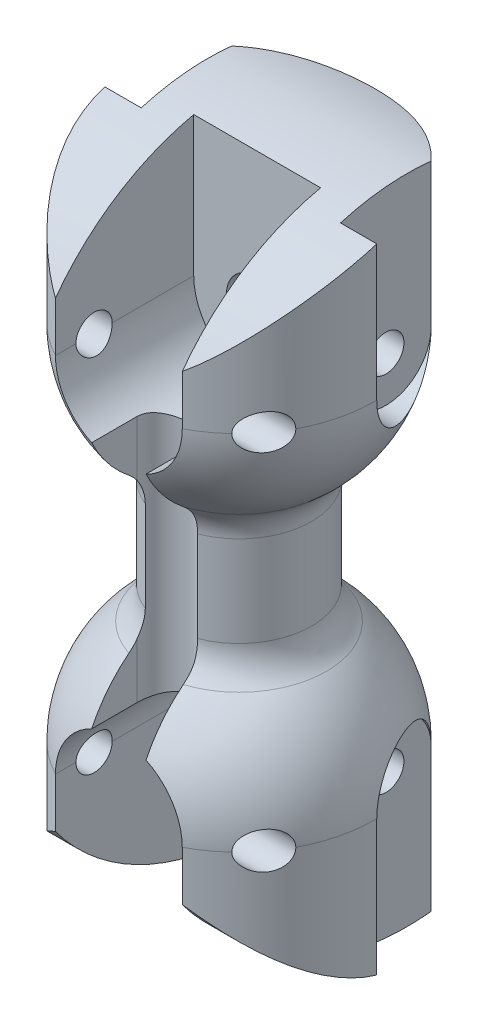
ISO-10303-21;
HEADER;
FILE_DESCRIPTION(('STEP AP214'),'2;1');
FILE_NAME('part.step','',(''),(''),'','','');
FILE_SCHEMA(('AUTOMOTIVE_DESIGN { 1 0 10303 214 1 1 1 1 }'));
ENDSEC;
DATA;
#1=APPLICATION_CONTEXT('core data for automotive mechanical design processes');
#2=APPLICATION_PROTOCOL_DEFINITION('international standard','automotive_design',2000,#1);
#3=PRODUCT_CONTEXT('',#1,'mechanical');
#4=PRODUCT('Part','Part','',(#3));
#5=PRODUCT_RELATED_PRODUCT_CATEGORY('part','',(#4));
#6=PRODUCT_DEFINITION_FORMATION('','',#4);
#7=PRODUCT_DEFINITION_CONTEXT('part definition',#1,'design');
#8=PRODUCT_DEFINITION('design','',#6,#7);
#9=PRODUCT_DEFINITION_SHAPE('','',#8);
#10=(LENGTH_UNIT() NAMED_UNIT(*) SI_UNIT(.MILLI.,.METRE.));
#11=(NAMED_UNIT(*) PLANE_ANGLE_UNIT() SI_UNIT($,.RADIAN.));
#12=(NAMED_UNIT(*) SI_UNIT($,.STERADIAN.) SOLID_ANGLE_UNIT());
#13=UNCERTAINTY_MEASURE_WITH_UNIT(LENGTH_MEASURE(1.E-05),#10,'distance_accuracy_value','');
#14=(GEOMETRIC_REPRESENTATION_CONTEXT(3) GLOBAL_UNCERTAINTY_ASSIGNED_CONTEXT((#13)) GLOBAL_UNIT_ASSIGNED_CONTEXT((#10,
#11,#12)) REPRESENTATION_CONTEXT('',''));
#15=CARTESIAN_POINT('',(0.,0.,0.));
#16=DIRECTION('',(0.,0.,1.));
#17=DIRECTION('',(1.,0.,0.));
#18=AXIS2_PLACEMENT_3D('',#15,#16,#17);
#19=CARTESIAN_POINT('',(0.,0.,0.));
#20=DIRECTION('',(0.,-1.,0.));
#21=DIRECTION('',(0.,0.,-1.));
#22=AXIS2_PLACEMENT_3D('',#19,#20,#21);
#23=CYLINDRICAL_SURFACE('',#22,7.5);
#24=CARTESIAN_POINT('',(3.5,22.7418591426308,6.6332495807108));
#25=CARTESIAN_POINT('',(3.61868430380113,22.8272042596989,6.57060927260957));
#26=CARTESIAN_POINT('',(3.73485385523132,22.9140100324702,6.50525713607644));
#27=CARTESIAN_POINT('',(3.96233587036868,23.0897645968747,6.36926306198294));
#28=CARTESIAN_POINT('',(4.07364928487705,23.1787129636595,6.29862216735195));
#29=CARTESIAN_POINT('',(4.29166151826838,23.3580279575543,6.15214387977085));
#30=CARTESIAN_POINT('',(4.39835933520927,23.4483948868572,6.0763053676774));
#31=CARTESIAN_POINT('',(4.60721579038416,23.6299265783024,5.91951126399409));
#32=CARTESIAN_POINT('',(4.70937415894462,23.72109138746,5.83855536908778));
#33=CARTESIAN_POINT('',(5.01060505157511,23.9963274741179,5.5868333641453));
#34=CARTESIAN_POINT('',(5.20286275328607,24.1808314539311,5.40826989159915));
#35=CARTESIAN_POINT('',(5.56878860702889,24.5471972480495,5.03067291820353));
#36=CARTESIAN_POINT('',(5.7424603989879,24.7290595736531,4.83164344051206));
#37=CARTESIAN_POINT('',(6.03822759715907,25.0523035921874,4.4537243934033));
#38=CARTESIAN_POINT('',(6.16379426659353,25.1946973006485,4.27841200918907));
#39=CARTESIAN_POINT('',(6.40102019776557,25.4741511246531,3.9145994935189));
#40=CARTESIAN_POINT('',(6.51268074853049,25.6112117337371,3.72610058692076));
#41=CARTESIAN_POINT('',(6.7204636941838,25.878013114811,3.33675213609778));
#42=CARTESIAN_POINT('',(6.81663037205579,26.0077740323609,3.13594013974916));
#43=CARTESIAN_POINT('',(6.99221628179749,26.2587698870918,2.72202487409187));
#44=CARTESIAN_POINT('',(7.07163875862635,26.3800064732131,2.50892399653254));
#45=CARTESIAN_POINT('',(7.19818008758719,26.5895110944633,2.11431073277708));
#46=CARTESIAN_POINT('',(7.24857955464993,26.6795810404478,1.93480240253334));
#47=CARTESIAN_POINT('',(7.33641675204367,26.8522982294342,1.56917858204));
#48=CARTESIAN_POINT('',(7.37385715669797,26.9349470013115,1.38306446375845));
#49=CARTESIAN_POINT('',(7.43480052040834,27.0920218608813,1.00516873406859));
#50=CARTESIAN_POINT('',(7.45830468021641,27.1664486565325,0.813387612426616));
#51=CARTESIAN_POINT('',(7.49045907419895,27.3063660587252,0.425346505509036));
#52=CARTESIAN_POINT('',(7.49910907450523,27.3718565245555,0.229086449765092));
#53=CARTESIAN_POINT('',(7.50076501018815,27.4936712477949,-0.167614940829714));
#54=CARTESIAN_POINT('',(7.49367801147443,27.5499389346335,-0.368074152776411));
#55=CARTESIAN_POINT('',(7.4630619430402,27.6524330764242,-0.770315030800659));
#56=CARTESIAN_POINT('',(7.43953278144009,27.6986594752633,-0.972096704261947));
#57=CARTESIAN_POINT('',(7.37569511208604,27.7809060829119,-1.37503398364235));
#58=CARTESIAN_POINT('',(7.3353910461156,27.8169289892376,-1.57618974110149));
#59=CARTESIAN_POINT('',(7.23795113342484,27.8789104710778,-1.97595013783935));
#60=CARTESIAN_POINT('',(7.18081660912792,27.9048698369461,-2.17455497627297));
#61=CARTESIAN_POINT('',(7.0564272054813,27.945060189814,-2.54787052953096));
#62=CARTESIAN_POINT('',(6.99072744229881,27.960195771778,-2.72300509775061));
#63=CARTESIAN_POINT('',(6.84619450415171,27.9831392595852,-3.0683324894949));
#64=CARTESIAN_POINT('',(6.76735690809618,27.9909446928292,-3.23852362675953));
#65=CARTESIAN_POINT('',(6.59710221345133,27.9998686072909,-3.57258732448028));
#66=CARTESIAN_POINT('',(6.50568963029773,28.0009894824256,-3.73646212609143));
#67=CARTESIAN_POINT('',(6.3108386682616,27.9973287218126,-4.05690700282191));
#68=CARTESIAN_POINT('',(6.20739559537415,27.9925447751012,-4.21347419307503));
#69=CARTESIAN_POINT('',(5.98744364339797,27.9778259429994,-4.52070608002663));
#70=CARTESIAN_POINT('',(5.8707516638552,27.9678095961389,-4.67123566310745));
#71=CARTESIAN_POINT('',(5.62639797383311,27.9435575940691,-4.96284707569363));
#72=CARTESIAN_POINT('',(5.49873155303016,27.9293201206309,-5.10392480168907));
#73=CARTESIAN_POINT('',(5.23323840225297,27.8976477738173,-5.37580901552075));
#74=CARTESIAN_POINT('',(5.09541050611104,27.880212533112,-5.50661432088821));
#75=CARTESIAN_POINT('',(4.81039481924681,27.8431819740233,-5.75726693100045));
#76=CARTESIAN_POINT('',(4.66320648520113,27.8235865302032,-5.87711359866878));
#77=CARTESIAN_POINT('',(4.34752673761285,27.7815710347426,-6.11483955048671));
#78=CARTESIAN_POINT('',(4.17828470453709,27.7590520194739,-6.23170614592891));
#79=CARTESIAN_POINT('',(3.83084029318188,27.7139776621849,-6.45111360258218));
#80=CARTESIAN_POINT('',(3.6526407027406,27.6914223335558,-6.55365888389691));
#81=CARTESIAN_POINT('',(3.28821463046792,27.6474769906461,-6.74387950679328));
#82=CARTESIAN_POINT('',(3.10198410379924,27.6260875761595,-6.83154724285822));
#83=CARTESIAN_POINT('',(2.72280411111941,27.5856250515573,-6.99132663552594));
#84=CARTESIAN_POINT('',(2.52985725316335,27.5665510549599,-7.06344425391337));
#85=CARTESIAN_POINT('',(2.13272558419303,27.5312056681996,-7.19349639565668));
#86=CARTESIAN_POINT('',(1.92837714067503,27.5150316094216,-7.25095888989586));
#87=CARTESIAN_POINT('',(1.5152492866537,27.4870899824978,-7.34840537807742));
#88=CARTESIAN_POINT('',(1.30646978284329,27.4753225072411,-7.38838900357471));
#89=CARTESIAN_POINT('',(0.886113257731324,27.4568604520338,-7.45049840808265));
#90=CARTESIAN_POINT('',(0.674537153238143,27.450164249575,-7.47262989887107));
#91=CARTESIAN_POINT('',(0.250171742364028,27.4422198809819,-7.49884008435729));
#92=CARTESIAN_POINT('',(0.0373824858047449,27.4409714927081,-7.50291951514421));
#93=CARTESIAN_POINT('',(-0.379194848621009,27.4439312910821,-7.49318786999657));
#94=CARTESIAN_POINT('',(-0.58300149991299,27.4479225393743,-7.48008809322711));
#95=CARTESIAN_POINT('',(-0.988710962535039,27.4607771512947,-7.43734197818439));
#96=CARTESIAN_POINT('',(-1.19061382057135,27.4696403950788,-7.40769604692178));
#97=CARTESIAN_POINT('',(-1.5911211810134,27.4917782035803,-7.3321123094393));
#98=CARTESIAN_POINT('',(-1.78972526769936,27.5050533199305,-7.2861724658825));
#99=CARTESIAN_POINT('',(-2.18227363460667,27.53532850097,-7.17837815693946));
#100=CARTESIAN_POINT('',(-2.37621782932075,27.552328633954,-7.11652339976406));
#101=CARTESIAN_POINT('',(-2.75856726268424,27.5892175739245,-6.97723345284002));
#102=CARTESIAN_POINT('',(-2.94696107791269,27.6091118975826,-6.89976839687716));
#103=CARTESIAN_POINT('',(-3.31672100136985,27.650748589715,-6.72984226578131));
#104=CARTESIAN_POINT('',(-3.49808470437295,27.6724915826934,-6.63737611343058));
#105=CARTESIAN_POINT('',(-3.85266207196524,27.7166905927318,-6.43804058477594));
#106=CARTESIAN_POINT('',(-4.02587444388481,27.7391467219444,-6.33116893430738));
#107=CARTESIAN_POINT('',(-4.36308805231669,27.7835593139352,-6.10367357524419));
#108=CARTESIAN_POINT('',(-4.52708922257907,27.805515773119,-5.9830497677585));
#109=CARTESIAN_POINT('',(-4.85137993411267,27.8485336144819,-5.72354602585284));
#110=CARTESIAN_POINT('',(-5.01124416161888,27.8695217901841,-5.58412160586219));
#111=CARTESIAN_POINT('',(-5.31874349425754,27.9081435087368,-5.29206132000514));
#112=CARTESIAN_POINT('',(-5.46638321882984,27.9257783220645,-5.13943048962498));
#113=CARTESIAN_POINT('',(-5.74840113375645,27.9562669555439,-4.82192543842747));
#114=CARTESIAN_POINT('',(-5.88277985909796,27.9691209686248,-4.65705171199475));
#115=CARTESIAN_POINT('',(-6.13720268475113,27.9886570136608,-4.31624309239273));
#116=CARTESIAN_POINT('',(-6.25724758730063,27.9953393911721,-4.14030881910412));
#117=CARTESIAN_POINT('',(-6.47809206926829,28.0011331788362,-3.7850415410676));
#118=CARTESIAN_POINT('',(-6.5794147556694,28.0004991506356,-3.60603808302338));
#119=CARTESIAN_POINT('',(-6.76694577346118,27.9912353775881,-3.24046910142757));
#120=CARTESIAN_POINT('',(-6.8531544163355,27.9826057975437,-3.05390373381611));
#121=CARTESIAN_POINT('',(-7.00974775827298,27.9565027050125,-2.67496555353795));
#122=CARTESIAN_POINT('',(-7.08014163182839,27.9390343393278,-2.48259618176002));
#123=CARTESIAN_POINT('',(-7.2047128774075,27.8946287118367,-2.0937486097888));
#124=CARTESIAN_POINT('',(-7.25889138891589,27.8676921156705,-1.89727069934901));
#125=CARTESIAN_POINT('',(-7.34705466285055,27.8066139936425,-1.51837226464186));
#126=CARTESIAN_POINT('',(-7.38233476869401,27.7732482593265,-1.33612621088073));
#127=CARTESIAN_POINT('',(-7.43914058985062,27.6981648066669,-0.971224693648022));
#128=CARTESIAN_POINT('',(-7.46066720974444,27.6564476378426,-0.78856925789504));
#129=CARTESIAN_POINT('',(-7.49022138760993,27.5647716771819,-0.424249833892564));
#130=CARTESIAN_POINT('',(-7.49824910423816,27.5148129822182,-0.242585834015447));
#131=CARTESIAN_POINT('',(-7.50123735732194,27.4069313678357,0.118465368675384));
#132=CARTESIAN_POINT('',(-7.49619742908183,27.3490081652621,0.297852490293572));
#133=CARTESIAN_POINT('',(-7.47356295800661,27.2252922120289,0.654132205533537));
#134=CARTESIAN_POINT('',(-7.45590261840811,27.1594597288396,0.831006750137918));
#135=CARTESIAN_POINT('',(-7.40864068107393,27.0207022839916,1.18029941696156));
#136=CARTESIAN_POINT('',(-7.3790394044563,26.9477775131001,1.35271765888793));
#137=CARTESIAN_POINT('',(-7.30863184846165,26.7954203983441,1.69232965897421));
#138=CARTESIAN_POINT('',(-7.26782387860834,26.7159870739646,1.85952262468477));
#139=CARTESIAN_POINT('',(-7.17576087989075,26.5512539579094,2.18805187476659));
#140=CARTESIAN_POINT('',(-7.12450382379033,26.465953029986,2.3493870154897));
#141=CARTESIAN_POINT('',(-6.99006142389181,26.2553250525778,2.72835436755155));
#142=CARTESIAN_POINT('',(-6.90226915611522,26.12752024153,2.94299058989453));
#143=CARTESIAN_POINT('',(-6.70964209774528,25.8635273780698,3.3590624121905));
#144=CARTESIAN_POINT('',(-6.6048020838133,25.7273367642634,3.56049393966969));
#145=CARTESIAN_POINT('',(-6.37937596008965,25.4479203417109,3.95023977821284));
#146=CARTESIAN_POINT('',(-6.2587438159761,25.3046747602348,4.13851317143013));
#147=CARTESIAN_POINT('',(-6.00329858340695,25.013256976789,4.50106530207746));
#148=CARTESIAN_POINT('',(-5.86848525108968,24.865084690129,4.67534379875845));
#149=CARTESIAN_POINT('',(-5.57160789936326,24.5506894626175,5.02644696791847));
#150=CARTESIAN_POINT('',(-5.40816725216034,24.3841342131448,5.20180862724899));
#151=CARTESIAN_POINT('',(-5.06605342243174,24.0496146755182,5.53554212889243));
#152=CARTESIAN_POINT('',(-4.8873800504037,23.8816503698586,5.6939137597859));
#153=CARTESIAN_POINT('',(-4.6087506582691,23.6314569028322,5.91806344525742));
#154=CARTESIAN_POINT('',(-4.51445625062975,23.548641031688,5.9903132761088));
#155=CARTESIAN_POINT('',(-4.32208540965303,23.3837996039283,6.13055845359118));
#156=CARTESIAN_POINT('',(-4.22400917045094,23.3017740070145,6.19855401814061));
#157=CARTESIAN_POINT('',(-4.02397963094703,23.1389788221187,6.33024004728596));
#158=CARTESIAN_POINT('',(-3.92202603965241,23.05820932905,6.39393018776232));
#159=CARTESIAN_POINT('',(-3.71407831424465,22.8985064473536,6.51691449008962));
#160=CARTESIAN_POINT('',(-3.60808350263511,22.8195733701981,6.57620790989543));
#161=CARTESIAN_POINT('',(-3.49999999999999,22.7418591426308,6.6332495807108));
#162=B_SPLINE_CURVE_WITH_KNOTS('',3,(#24,#25,#26,#27,#28,#29,#30,#31,#32,#33,#34,#35,#36,#37,
#38,#39,#40,#41,#42,#43,#44,#45,#46,#47,#48,#49,#50,#51,#52,#53,#54,#55,#56,#57,#58,#59,#60,#61,
#62,#63,#64,#65,#66,#67,#68,#69,#70,#71,#72,#73,#74,#75,#76,#77,#78,#79,#80,#81,#82,#83,#84,#85,
#86,#87,#88,#89,#90,#91,#92,#93,#94,#95,#96,#97,#98,#99,#100,#101,#102,#103,#104,#105,#106,#107,
#108,#109,#110,#111,#112,#113,#114,#115,#116,#117,#118,#119,#120,#121,#122,#123,#124,#125,#126,
#127,#128,#129,#130,#131,#132,#133,#134,#135,#136,#137,#138,#139,#140,#141,#142,#143,#144,#145,
#146,#147,#148,#149,#150,#151,#152,#153,#154,#155,#156,#157,#158,#159,#160,#161),.UNSPECIFIED.,
.F.,.F.,(4,2,2,2,2,2,2,2,2,2,2,2,2,2,2,2,2,2,2,2,2,2,2,2,2,2,2,2,2,2,2,2,2,2,2,2,2,2,2,2,2,2,2,
2,2,2,2,2,2,2,2,2,2,2,2,2,2,2,2,2,2,2,2,2,2,2,2,2,4),(0.,0.477032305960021,0.953970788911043,
1.43101229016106,1.90808209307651,2.86910373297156,3.82993681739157,4.60447514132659,
5.37894161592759,6.15115374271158,6.92321608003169,7.54382176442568,8.16429929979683,
8.78472336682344,9.40515720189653,10.029264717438,10.6533757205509,11.2773215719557,
11.9012184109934,12.4635468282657,13.026064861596,13.5883814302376,14.1509181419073,
14.7224859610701,15.2943003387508,15.8661804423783,16.4380937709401,17.0580941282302,
17.6779027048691,18.2980271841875,18.9179134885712,19.5557788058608,20.1936575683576,
20.8313321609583,21.4689807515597,22.0810433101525,22.6930908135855,23.3052148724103,
23.917350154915,24.5306679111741,25.1441936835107,25.7578164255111,26.3714435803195,
27.0101381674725,27.6485902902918,28.28701664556,28.9254072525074,29.5416551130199,
30.1578902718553,30.7737670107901,31.3896004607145,31.954730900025,32.5198241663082,
33.0849107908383,33.6500175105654,34.2180921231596,34.7861514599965,35.3542965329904,
35.9225519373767,36.7157545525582,37.5092006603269,38.3050134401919,39.1008399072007,
39.9756268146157,40.8504246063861,41.2847624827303,41.7190780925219,42.1534263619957,
42.5878477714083),.UNSPECIFIED.);
#163=CARTESIAN_POINT('',(-7.49933330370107,27.4721450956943,-0.1));
#164=VERTEX_POINT('',#163);
#165=CARTESIAN_POINT('',(-3.5,22.7418591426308,6.6332495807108));
#166=VERTEX_POINT('',#165);
#167=EDGE_CURVE('E611',#164,#166,#162,.T.);
#168=ORIENTED_EDGE('',*,*,#167,.F.);
#169=DIRECTION('',(0.,-1.,0.));
#170=VECTOR('',#169,1.);
#171=CARTESIAN_POINT('',(-7.49933330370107,0.,-0.1));
#172=LINE('',#171,#170);
#173=CARTESIAN_POINT('',(-7.49933330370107,20.,-0.1));
#174=VERTEX_POINT('',#173);
#175=EDGE_CURVE('E415',#164,#174,#172,.T.);
#176=ORIENTED_EDGE('',*,*,#175,.T.);
#177=CARTESIAN_POINT('',(0.,19.9999999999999,0.));
#178=DIRECTION('',(0.,-1.,0.));
#179=DIRECTION('',(0.,0.,-1.));
#180=AXIS2_PLACEMENT_3D('',#177,#178,#179);
#181=CIRCLE('',#180,7.5);
#182=CARTESIAN_POINT('',(-6.6332495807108,19.9999999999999,3.5));
#183=VERTEX_POINT('',#182);
#184=EDGE_CURVE('E1143',#183,#174,#181,.T.);
#185=ORIENTED_EDGE('',*,*,#184,.F.);
#186=CARTESIAN_POINT('',(-5.09901951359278,20.,5.5));
#187=CARTESIAN_POINT('',(-5.09901446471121,20.0223235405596,5.50000357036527));
#188=CARTESIAN_POINT('',(-5.09982657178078,20.0446320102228,5.49925186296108));
#189=CARTESIAN_POINT('',(-5.10303211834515,20.0890130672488,5.49627789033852));
#190=CARTESIAN_POINT('',(-5.10542387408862,20.11108588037,5.49405719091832));
#191=CARTESIAN_POINT('',(-5.1148212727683,20.1762241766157,5.48531479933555));
#192=CARTESIAN_POINT('',(-5.12405164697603,20.2187171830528,5.4767107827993));
#193=CARTESIAN_POINT('',(-5.14751440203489,20.3007013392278,5.45466291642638));
#194=CARTESIAN_POINT('',(-5.16172726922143,20.3402034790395,5.4412379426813));
#195=CARTESIAN_POINT('',(-5.19413061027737,20.4159384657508,5.41031529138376));
#196=CARTESIAN_POINT('',(-5.21233267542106,20.4521613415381,5.39280573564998));
#197=CARTESIAN_POINT('',(-5.26127198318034,20.537719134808,5.34515372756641));
#198=CARTESIAN_POINT('',(-5.29380935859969,20.5849021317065,5.31300117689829));
#199=CARTESIAN_POINT('',(-5.36301571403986,20.6714537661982,5.24313824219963));
#200=CARTESIAN_POINT('',(-5.39969278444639,20.7108066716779,5.2054169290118));
#201=CARTESIAN_POINT('',(-5.48766816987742,20.793383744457,5.11280344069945));
#202=CARTESIAN_POINT('',(-5.53988495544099,20.8338059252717,5.05628287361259));
#203=CARTESIAN_POINT('',(-5.64602876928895,20.9018298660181,4.93748189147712));
#204=CARTESIAN_POINT('',(-5.69995686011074,20.929423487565,4.87519785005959));
#205=CARTESIAN_POINT('',(-5.80833326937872,20.9717977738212,4.74557442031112));
#206=CARTESIAN_POINT('',(-5.86278075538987,20.9864335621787,4.67818679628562));
#207=CARTESIAN_POINT('',(-5.96999943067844,21.0015677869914,4.54056111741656));
#208=CARTESIAN_POINT('',(-6.02277191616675,21.0020774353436,4.47032536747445));
#209=CARTESIAN_POINT('',(-6.11736147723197,20.988912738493,4.339744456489));
#210=CARTESIAN_POINT('',(-6.1596279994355,20.9773729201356,4.27951079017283));
#211=CARTESIAN_POINT('',(-6.24082864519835,20.9425419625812,4.16019744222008));
#212=CARTESIAN_POINT('',(-6.2797664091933,20.9192638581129,4.10111655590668));
#213=CARTESIAN_POINT('',(-6.34744947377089,20.8650606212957,3.99539679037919));
#214=CARTESIAN_POINT('',(-6.3768352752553,20.8359094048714,3.94826061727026));
#215=CARTESIAN_POINT('',(-6.43177584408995,20.7688516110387,3.85811377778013));
#216=CARTESIAN_POINT('',(-6.45733170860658,20.7309475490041,3.815101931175));
#217=CARTESIAN_POINT('',(-6.50406092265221,20.6465363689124,3.73488490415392));
#218=CARTESIAN_POINT('',(-6.52520547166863,20.5999762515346,3.69771825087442));
#219=CARTESIAN_POINT('',(-6.5622431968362,20.4994657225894,3.63158508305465));
#220=CARTESIAN_POINT('',(-6.57813765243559,20.4455171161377,3.60261657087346));
#221=CARTESIAN_POINT('',(-6.60257329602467,20.3388889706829,3.55761173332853));
#222=CARTESIAN_POINT('',(-6.61176872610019,20.2868364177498,3.5404394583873));
#223=CARTESIAN_POINT('',(-6.62541672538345,20.1801209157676,3.514836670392));
#224=CARTESIAN_POINT('',(-6.62988150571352,20.1254650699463,3.50638365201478));
#225=CARTESIAN_POINT('',(-6.6328141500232,20.0470095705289,3.50082344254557));
#226=CARTESIAN_POINT('',(-6.63325296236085,20.0234973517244,3.49998927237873));
#227=CARTESIAN_POINT('',(-6.63324958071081,20.,3.5));
#228=B_SPLINE_CURVE_WITH_KNOTS('',3,(#186,#187,#188,#189,#190,#191,#192,#193,#194,#195,#196,
#197,#198,#199,#200,#201,#202,#203,#204,#205,#206,#207,#208,#209,#210,#211,#212,#213,#214,#215,
#216,#217,#218,#219,#220,#221,#222,#223,#224,#225,#226,#227),.UNSPECIFIED.,.F.,.F.,(4,2,2,2,2,2,
2,2,2,2,2,2,2,2,2,2,2,2,2,2,4),(0.,0.0669151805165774,0.133759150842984,0.265949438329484,
0.397627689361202,0.529693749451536,0.725756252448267,0.922208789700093,1.18162791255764,
1.44121138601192,1.70366178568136,1.96590387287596,2.18846582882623,2.41078118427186,
2.59819970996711,2.78556444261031,2.97411659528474,3.16262276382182,3.32846926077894,
3.49388661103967,3.56440059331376),.UNSPECIFIED.);
#229=CARTESIAN_POINT('',(-5.09901951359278,19.9999999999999,5.5));
#230=VERTEX_POINT('',#229);
#231=EDGE_CURVE('E1246',#230,#183,#228,.T.);
#232=ORIENTED_EDGE('',*,*,#231,.F.);
#233=CARTESIAN_POINT('',(0.,19.9999999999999,0.));
#234=DIRECTION('',(0.,-1.,0.));
#235=DIRECTION('',(0.,0.,-1.));
#236=AXIS2_PLACEMENT_3D('',#233,#234,#235);
#237=CIRCLE('',#236,7.5);
#238=CARTESIAN_POINT('',(-3.5,20.,6.6332495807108));
#239=VERTEX_POINT('',#238);
#240=EDGE_CURVE('E814',#239,#230,#237,.T.);
#241=ORIENTED_EDGE('',*,*,#240,.F.);
#242=DIRECTION('',(0.,-1.,0.));
#243=VECTOR('',#242,1.);
#244=CARTESIAN_POINT('',(-3.5,0.,6.6332495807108));
#245=LINE('',#244,#243);
#246=EDGE_CURVE('E761',#239,#166,#245,.F.);
#247=ORIENTED_EDGE('',*,*,#246,.T.);
#248=EDGE_LOOP('',(#168,#176,#185,#232,#241,#247));
#249=FACE_BOUND('',#248,.T.);
#250=ADVANCED_FACE('F47',(#249),#23,.T.);
#251=CARTESIAN_POINT('',(-5.5,20.,-5.09901951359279));
#252=VERTEX_POINT('',#251);
#253=CARTESIAN_POINT('',(-3.17542648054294,20.,-6.7946057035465));
#254=VERTEX_POINT('',#253);
#255=EDGE_CURVE('E1147',#252,#254,#181,.T.);
#256=ORIENTED_EDGE('',*,*,#255,.F.);
#257=DIRECTION('',(0.,-1.,0.));
#258=VECTOR('',#257,1.);
#259=CARTESIAN_POINT('',(-5.5,0.,-5.09901951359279));
#260=LINE('',#259,#258);
#261=CARTESIAN_POINT('',(-5.5,27.9291069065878,-5.09901951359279));
#262=VERTEX_POINT('',#261);
#263=EDGE_CURVE('E396',#252,#262,#260,.F.);
#264=ORIENTED_EDGE('',*,*,#263,.T.);
#265=CARTESIAN_POINT('',(5.5,27.9291069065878,-5.09901951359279));
#266=VERTEX_POINT('',#265);
#267=EDGE_CURVE('E626',#266,#262,#162,.T.);
#268=ORIENTED_EDGE('',*,*,#267,.F.);
#269=DIRECTION('',(0.,-1.,0.));
#270=VECTOR('',#269,1.);
#271=CARTESIAN_POINT('',(5.5,0.,-5.09901951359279));
#272=LINE('',#271,#270);
#273=CARTESIAN_POINT('',(5.5,20.,-5.09901951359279));
#274=VERTEX_POINT('',#273);
#275=EDGE_CURVE('E493',#266,#274,#272,.T.);
#276=ORIENTED_EDGE('',*,*,#275,.T.);
#277=CARTESIAN_POINT('',(3.17542648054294,20.,-6.7946057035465));
#278=VERTEX_POINT('',#277);
#279=EDGE_CURVE('E1148',#278,#274,#181,.T.);
#280=ORIENTED_EDGE('',*,*,#279,.F.);
#281=CARTESIAN_POINT('',(0.,25.5,0.));
#282=DIRECTION('',(0.866025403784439,0.5,0.));
#283=DIRECTION('',(0.5,-0.866025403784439,0.));
#284=AXIS2_PLACEMENT_3D('',#281,#282,#283);
#285=ELLIPSE('',#284,15.,7.5);
#286=CARTESIAN_POINT('',(1.58771324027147,22.75,-7.33001819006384));
#287=VERTEX_POINT('',#286);
#288=EDGE_CURVE('E1050',#287,#278,#285,.F.);
#289=ORIENTED_EDGE('',*,*,#288,.F.);
#290=CARTESIAN_POINT('',(0.,22.75,0.));
#291=DIRECTION('',(0.,1.,0.));
#292=DIRECTION('',(0.,0.,1.));
#293=AXIS2_PLACEMENT_3D('',#290,#291,#292);
#294=CIRCLE('',#293,7.5);
#295=CARTESIAN_POINT('',(-1.58771324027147,22.75,-7.33001819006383));
#296=VERTEX_POINT('',#295);
#297=EDGE_CURVE('E1027',#296,#287,#294,.F.);
#298=ORIENTED_EDGE('',*,*,#297,.F.);
#299=CARTESIAN_POINT('',(0.,25.5,0.));
#300=DIRECTION('',(-0.866025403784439,0.5,0.));
#301=DIRECTION('',(-0.5,-0.866025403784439,0.));
#302=AXIS2_PLACEMENT_3D('',#299,#300,#301);
#303=ELLIPSE('',#302,15.,7.5);
#304=EDGE_CURVE('E1035',#254,#296,#303,.F.);
#305=ORIENTED_EDGE('',*,*,#304,.F.);
#306=EDGE_LOOP('',(#256,#264,#268,#276,#280,#289,#298,#305));
#307=FACE_BOUND('',#306,.T.);
#308=ADVANCED_FACE('F638',(#307),#23,.T.);
#309=CARTESIAN_POINT('',(0.,20.,0.));
#310=DIRECTION('',(0.,-1.,0.));
#311=DIRECTION('',(-1.,0.,0.));
#312=AXIS2_PLACEMENT_3D('',#309,#310,#311);
#313=SPHERICAL_SURFACE('',#312,7.5);
#314=CARTESIAN_POINT('',(-5.4998,19.9134102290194,-5.09849999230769));
#315=CARTESIAN_POINT('',(-5.50087621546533,19.8473321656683,-5.09621995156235));
#316=CARTESIAN_POINT('',(-5.50320350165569,19.7813731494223,-5.09129980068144));
#317=CARTESIAN_POINT('',(-5.51029397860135,19.6501996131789,-5.07628416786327));
#318=CARTESIAN_POINT('',(-5.5150563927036,19.5849848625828,-5.0661903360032));
#319=CARTESIAN_POINT('',(-5.52693005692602,19.4559981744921,-5.04097651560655));
#320=CARTESIAN_POINT('',(-5.5340327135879,19.3922218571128,-5.02587491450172));
#321=CARTESIAN_POINT('',(-5.55047938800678,19.2663300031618,-4.9908165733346));
#322=CARTESIAN_POINT('',(-5.55982350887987,19.2042145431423,-4.97085960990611));
#323=CARTESIAN_POINT('',(-5.59101513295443,19.021095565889,-4.90403529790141));
#324=CARTESIAN_POINT('',(-5.61604317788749,18.9030941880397,-4.85016978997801));
#325=CARTESIAN_POINT('',(-5.67330600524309,18.6781334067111,-4.7258489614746));
#326=CARTESIAN_POINT('',(-5.70554586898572,18.5711818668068,-4.65538194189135));
#327=CARTESIAN_POINT('',(-5.77751294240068,18.3656787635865,-4.49647985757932));
#328=CARTESIAN_POINT('',(-5.81752098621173,18.2677588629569,-4.40735558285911));
#329=CARTESIAN_POINT('',(-5.90237764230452,18.0880777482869,-4.21610366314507));
#330=CARTESIAN_POINT('',(-5.94722781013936,18.0063217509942,-4.11397183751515));
#331=CARTESIAN_POINT('',(-6.04446173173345,17.8537625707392,-3.88981643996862));
#332=CARTESIAN_POINT('',(-6.09716091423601,17.7845700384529,-3.76683229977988));
#333=CARTESIAN_POINT('',(-6.20492639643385,17.6680197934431,-3.51188383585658));
#334=CARTESIAN_POINT('',(-6.25999343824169,17.6206689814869,-3.37991668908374));
#335=CARTESIAN_POINT('',(-6.37459609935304,17.5463250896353,-3.10154096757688));
#336=CARTESIAN_POINT('',(-6.4341905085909,17.5208454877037,-2.95475027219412));
#337=CARTESIAN_POINT('',(-6.55273322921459,17.4962773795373,-2.65869317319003));
#338=CARTESIAN_POINT('',(-6.61168141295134,17.4971939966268,-2.50942629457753));
#339=CARTESIAN_POINT('',(-6.72841473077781,17.5259558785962,-2.20998100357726));
#340=CARTESIAN_POINT('',(-6.78616169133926,17.5542701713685,-2.0598320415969));
#341=CARTESIAN_POINT('',(-6.89786031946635,17.6383013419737,-1.7658931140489));
#342=CARTESIAN_POINT('',(-6.95181237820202,17.6940153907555,-1.62210249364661));
#343=CARTESIAN_POINT('',(-7.05290183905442,17.8298605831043,-1.3498188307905));
#344=CARTESIAN_POINT('',(-7.10019383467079,17.9092190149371,-1.22099868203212));
#345=CARTESIAN_POINT('',(-7.18845332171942,18.0911731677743,-0.978478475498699));
#346=CARTESIAN_POINT('',(-7.22942347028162,18.1937590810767,-0.864772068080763));
#347=CARTESIAN_POINT('',(-7.30162454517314,18.4129104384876,-0.662982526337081));
#348=CARTESIAN_POINT('',(-7.33328304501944,18.5283172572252,-0.573794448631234));
#349=CARTESIAN_POINT('',(-7.38894331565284,18.7742874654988,-0.416210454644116));
#350=CARTESIAN_POINT('',(-7.41294454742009,18.904851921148,-0.347816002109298));
#351=CARTESIAN_POINT('',(-7.45132750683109,19.1689589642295,-0.238089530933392));
#352=CARTESIAN_POINT('',(-7.46619430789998,19.3018684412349,-0.195395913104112));
#353=CARTESIAN_POINT('',(-7.48797858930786,19.5733943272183,-0.132749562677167));
#354=CARTESIAN_POINT('',(-7.49491485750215,19.7119964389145,-0.112743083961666));
#355=CARTESIAN_POINT('',(-7.4983090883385,19.8759610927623,-0.102953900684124));
#356=CARTESIAN_POINT('',(-7.49869393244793,19.9008099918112,-0.101844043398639));
#357=CARTESIAN_POINT('',(-7.49920601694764,19.9505033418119,-0.100367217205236));
#358=CARTESIAN_POINT('',(-7.49933355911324,19.9753477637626,-0.0999993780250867));
#359=CARTESIAN_POINT('',(-7.49933330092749,20.0002,-0.100000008));
#360=B_SPLINE_CURVE_WITH_KNOTS('',3,(#314,#315,#316,#317,#318,#319,#320,#321,#322,#323,#324,
#325,#326,#327,#328,#329,#330,#331,#332,#333,#334,#335,#336,#337,#338,#339,#340,#341,#342,#343,
#344,#345,#346,#347,#348,#349,#350,#351,#352,#353,#354,#355,#356,#357,#358,#359),.UNSPECIFIED.,
.F.,.F.,(4,2,2,2,2,2,2,2,2,2,2,2,2,2,2,2,2,2,2,2,2,2,4),(0.,0.198302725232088,0.396542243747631,
0.594061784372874,0.791590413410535,1.18596446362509,1.58061726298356,1.99383174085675,
2.40717936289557,2.85712439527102,3.30721148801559,3.78638722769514,4.26565597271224,
4.75327730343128,5.24084829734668,5.71396693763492,6.18688617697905,6.63232653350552,
7.07779823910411,7.49691678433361,7.9150403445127,7.98966584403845,8.06420376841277),.UNSPECIFIED.);
#361=CARTESIAN_POINT('',(-5.5,19.9019607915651,-5.09807692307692));
#362=VERTEX_POINT('',#361);
#363=EDGE_CURVE('E12',#362,#174,#360,.T.);
#364=ORIENTED_EDGE('',*,*,#363,.F.);
#365=CARTESIAN_POINT('',(-5.5,20.,0.));
#366=DIRECTION('',(-1.,0.,0.));
#367=DIRECTION('',(0.,0.,1.));
#368=AXIS2_PLACEMENT_3D('',#365,#366,#367);
#369=CIRCLE('',#368,5.09901951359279);
#370=EDGE_CURVE('E400',#252,#362,#369,.T.);
#371=ORIENTED_EDGE('',*,*,#370,.F.);
#372=ORIENTED_EDGE('',*,*,#255,.T.);
#373=CARTESIAN_POINT('',(-2.38156986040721,18.625,0.));
#374=DIRECTION('',(-0.866025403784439,-0.5,0.));
#375=DIRECTION('',(0.5,-0.866025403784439,0.));
#376=AXIS2_PLACEMENT_3D('',#373,#374,#375);
#377=CIRCLE('',#376,6.97764286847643);
#378=CARTESIAN_POINT('',(-1.58771324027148,17.25,-6.7946057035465));
#379=VERTEX_POINT('',#378);
#380=EDGE_CURVE('E1043',#254,#379,#377,.T.);
#381=ORIENTED_EDGE('',*,*,#380,.T.);
#382=CARTESIAN_POINT('',(0.,17.25,0.));
#383=DIRECTION('',(0.,-1.,0.));
#384=DIRECTION('',(0.,0.,-1.));
#385=AXIS2_PLACEMENT_3D('',#382,#383,#384);
#386=CIRCLE('',#385,6.97764286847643);
#387=CARTESIAN_POINT('',(1.58771324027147,17.25,-6.7946057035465));
#388=VERTEX_POINT('',#387);
#389=EDGE_CURVE('E1039',#379,#388,#386,.T.);
#390=ORIENTED_EDGE('',*,*,#389,.T.);
#391=CARTESIAN_POINT('',(2.38156986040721,18.625,0.));
#392=DIRECTION('',(0.866025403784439,-0.5,0.));
#393=DIRECTION('',(0.5,0.866025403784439,0.));
#394=AXIS2_PLACEMENT_3D('',#391,#392,#393);
#395=CIRCLE('',#394,6.97764286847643);
#396=EDGE_CURVE('E1030',#388,#278,#395,.T.);
#397=ORIENTED_EDGE('',*,*,#396,.T.);
#398=ORIENTED_EDGE('',*,*,#279,.T.);
#399=CARTESIAN_POINT('',(5.5,20.,0.));
#400=DIRECTION('',(1.,0.,0.));
#401=DIRECTION('',(0.,0.,-1.));
#402=AXIS2_PLACEMENT_3D('',#399,#400,#401);
#403=CIRCLE('',#402,5.09901951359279);
#404=CARTESIAN_POINT('',(5.5,19.9019607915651,-5.09807692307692));
#405=VERTEX_POINT('',#404);
#406=EDGE_CURVE('E497',#405,#274,#403,.T.);
#407=ORIENTED_EDGE('',*,*,#406,.F.);
#408=CARTESIAN_POINT('',(5.4998,19.9134102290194,-5.09849999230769));
#409=CARTESIAN_POINT('',(5.50087621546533,19.8473321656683,-5.09621995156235));
#410=CARTESIAN_POINT('',(5.50320350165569,19.7813731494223,-5.09129980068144));
#411=CARTESIAN_POINT('',(5.51029397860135,19.6501996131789,-5.07628416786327));
#412=CARTESIAN_POINT('',(5.5150563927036,19.5849848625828,-5.0661903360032));
#413=CARTESIAN_POINT('',(5.52693005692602,19.4559981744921,-5.04097651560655));
#414=CARTESIAN_POINT('',(5.5340327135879,19.3922218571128,-5.02587491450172));
#415=CARTESIAN_POINT('',(5.55047938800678,19.2663300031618,-4.9908165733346));
#416=CARTESIAN_POINT('',(5.55982350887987,19.2042145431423,-4.97085960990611));
#417=CARTESIAN_POINT('',(5.59101513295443,19.021095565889,-4.90403529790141));
#418=CARTESIAN_POINT('',(5.61604317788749,18.9030941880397,-4.85016978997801));
#419=CARTESIAN_POINT('',(5.67330600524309,18.6781334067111,-4.7258489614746));
#420=CARTESIAN_POINT('',(5.70554586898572,18.5711818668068,-4.65538194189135));
#421=CARTESIAN_POINT('',(5.77751294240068,18.3656787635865,-4.49647985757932));
#422=CARTESIAN_POINT('',(5.81752098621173,18.2677588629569,-4.40735558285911));
#423=CARTESIAN_POINT('',(5.90237764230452,18.0880777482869,-4.21610366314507));
#424=CARTESIAN_POINT('',(5.94722781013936,18.0063217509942,-4.11397183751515));
#425=CARTESIAN_POINT('',(6.04446173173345,17.8537625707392,-3.88981643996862));
#426=CARTESIAN_POINT('',(6.09716091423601,17.7845700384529,-3.76683229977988));
#427=CARTESIAN_POINT('',(6.20492639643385,17.6680197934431,-3.51188383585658));
#428=CARTESIAN_POINT('',(6.25999343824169,17.6206689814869,-3.37991668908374));
#429=CARTESIAN_POINT('',(6.37459609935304,17.5463250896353,-3.10154096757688));
#430=CARTESIAN_POINT('',(6.4341905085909,17.5208454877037,-2.95475027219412));
#431=CARTESIAN_POINT('',(6.55273322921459,17.4962773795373,-2.65869317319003));
#432=CARTESIAN_POINT('',(6.61168141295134,17.4971939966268,-2.50942629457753));
#433=CARTESIAN_POINT('',(6.72841473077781,17.5259558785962,-2.20998100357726));
#434=CARTESIAN_POINT('',(6.78616169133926,17.5542701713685,-2.0598320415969));
#435=CARTESIAN_POINT('',(6.89786031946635,17.6383013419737,-1.7658931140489));
#436=CARTESIAN_POINT('',(6.95181237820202,17.6940153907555,-1.62210249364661));
#437=CARTESIAN_POINT('',(7.05290183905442,17.8298605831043,-1.3498188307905));
#438=CARTESIAN_POINT('',(7.10019383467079,17.9092190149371,-1.22099868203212));
#439=CARTESIAN_POINT('',(7.18845332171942,18.0911731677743,-0.978478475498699));
#440=CARTESIAN_POINT('',(7.22942347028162,18.1937590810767,-0.864772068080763));
#441=CARTESIAN_POINT('',(7.30162454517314,18.4129104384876,-0.662982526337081));
#442=CARTESIAN_POINT('',(7.33328304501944,18.5283172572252,-0.573794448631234));
#443=CARTESIAN_POINT('',(7.38894331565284,18.7742874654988,-0.416210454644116));
#444=CARTESIAN_POINT('',(7.41294454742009,18.904851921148,-0.347816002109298));
#445=CARTESIAN_POINT('',(7.45132750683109,19.1689589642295,-0.238089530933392));
#446=CARTESIAN_POINT('',(7.46619430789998,19.3018684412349,-0.195395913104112));
#447=CARTESIAN_POINT('',(7.48797858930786,19.5733943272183,-0.132749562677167));
#448=CARTESIAN_POINT('',(7.49491485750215,19.7119964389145,-0.112743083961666));
#449=CARTESIAN_POINT('',(7.4983090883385,19.8759610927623,-0.102953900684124));
#450=CARTESIAN_POINT('',(7.49869393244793,19.9008099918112,-0.101844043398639));
#451=CARTESIAN_POINT('',(7.49920601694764,19.9505033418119,-0.100367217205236));
#452=CARTESIAN_POINT('',(7.49933355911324,19.9753477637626,-0.0999993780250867));
#453=CARTESIAN_POINT('',(7.49933330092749,20.0002,-0.100000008));
#454=B_SPLINE_CURVE_WITH_KNOTS('',3,(#408,#409,#410,#411,#412,#413,#414,#415,#416,#417,#418,
#419,#420,#421,#422,#423,#424,#425,#426,#427,#428,#429,#430,#431,#432,#433,#434,#435,#436,#437,
#438,#439,#440,#441,#442,#443,#444,#445,#446,#447,#448,#449,#450,#451,#452,#453),.UNSPECIFIED.,
.F.,.F.,(4,2,2,2,2,2,2,2,2,2,2,2,2,2,2,2,2,2,2,2,2,2,4),(0.,0.198302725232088,0.396542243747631,
0.594061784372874,0.791590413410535,1.18596446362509,1.58061726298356,1.99383174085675,
2.40717936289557,2.85712439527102,3.30721148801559,3.78638722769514,4.26565597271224,
4.75327730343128,5.24084829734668,5.71396693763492,6.18688617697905,6.63232653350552,
7.07779823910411,7.49691678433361,7.9150403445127,7.98966584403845,8.06420376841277),.UNSPECIFIED.);
#455=CARTESIAN_POINT('',(7.49933330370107,20.,-0.1));
#456=VERTEX_POINT('',#455);
#457=EDGE_CURVE('E661',#405,#456,#454,.T.);
#458=ORIENTED_EDGE('',*,*,#457,.T.);
#459=CARTESIAN_POINT('',(6.6332495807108,19.9999999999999,3.5));
#460=VERTEX_POINT('',#459);
#461=EDGE_CURVE('E737',#456,#460,#181,.T.);
#462=ORIENTED_EDGE('',*,*,#461,.T.);
#463=CARTESIAN_POINT('',(6.63324956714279,20.0002,3.50000002));
#464=CARTESIAN_POINT('',(6.63325390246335,19.9755886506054,3.49999321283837));
#465=CARTESIAN_POINT('',(6.63263939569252,19.9509902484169,3.50089948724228));
#466=CARTESIAN_POINT('',(6.63018875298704,19.9019966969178,3.50451104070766));
#467=CARTESIAN_POINT('',(6.62835310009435,19.8776014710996,3.50721560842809));
#468=CARTESIAN_POINT('',(6.62106620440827,19.8052397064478,3.51794523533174));
#469=CARTESIAN_POINT('',(6.61383462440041,19.7578060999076,3.5285868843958));
#470=CARTESIAN_POINT('',(6.59498599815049,19.6658702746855,3.55624965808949));
#471=CARTESIAN_POINT('',(6.58337391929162,19.6213648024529,3.57326355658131));
#472=CARTESIAN_POINT('',(6.55626251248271,19.5361401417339,3.61284502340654));
#473=CARTESIAN_POINT('',(6.54075931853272,19.4954247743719,3.63541811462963));
#474=CARTESIAN_POINT('',(6.5054176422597,19.4162003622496,3.68665230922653));
#475=CARTESIAN_POINT('',(6.48537654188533,19.3779654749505,3.71559512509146));
#476=CARTESIAN_POINT('',(6.44223172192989,19.306951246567,3.7775684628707));
#477=CARTESIAN_POINT('',(6.41912689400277,19.2741738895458,3.81060046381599));
#478=CARTESIAN_POINT('',(6.36649528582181,19.2093757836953,3.88539289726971));
#479=CARTESIAN_POINT('',(6.33653472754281,19.1783401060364,3.92770004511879));
#480=CARTESIAN_POINT('',(6.27408102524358,19.1238496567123,4.01520941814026));
#481=CARTESIAN_POINT('',(6.24158636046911,19.1003994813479,4.06041337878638));
#482=CARTESIAN_POINT('',(6.16855489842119,19.0572794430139,4.16116611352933));
#483=CARTESIAN_POINT('',(6.12764121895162,19.0391077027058,4.2170835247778));
#484=CARTESIAN_POINT('',(6.0441407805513,19.0128477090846,4.33001219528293));
#485=CARTESIAN_POINT('',(6.00155310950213,19.0047650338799,4.38702404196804));
#486=CARTESIAN_POINT('',(5.90858298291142,18.9978601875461,4.51012621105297));
#487=CARTESIAN_POINT('',(5.85804888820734,19.0007372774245,4.57620129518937));
#488=CARTESIAN_POINT('',(5.75698616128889,19.0193620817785,4.70662986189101));
#489=CARTESIAN_POINT('',(5.70645761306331,19.0351257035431,4.77098111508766));
#490=CARTESIAN_POINT('',(5.60319194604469,19.0810616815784,4.90078772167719));
#491=CARTESIAN_POINT('',(5.55055622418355,19.112186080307,4.96599143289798));
#492=CARTESIAN_POINT('',(5.44898189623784,19.1893998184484,5.09012863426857));
#493=CARTESIAN_POINT('',(5.40003634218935,19.2354601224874,5.14907399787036));
#494=CARTESIAN_POINT('',(5.32465503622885,19.3242000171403,5.23877214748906));
#495=CARTESIAN_POINT('',(5.29629038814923,19.3625353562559,5.27222294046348));
#496=CARTESIAN_POINT('',(5.24362336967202,19.4456726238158,5.33390028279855));
#497=CARTESIAN_POINT('',(5.2193150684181,19.4904649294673,5.36213446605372));
#498=CARTESIAN_POINT('',(5.18012065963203,19.5774319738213,5.40740721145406));
#499=CARTESIAN_POINT('',(5.16432588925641,19.6186213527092,5.4255465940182));
#500=CARTESIAN_POINT('',(5.13738206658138,19.7043821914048,5.45638747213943));
#501=CARTESIAN_POINT('',(5.12622363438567,19.7489466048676,5.46909994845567));
#502=CARTESIAN_POINT('',(5.11163689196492,19.8280205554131,5.48568980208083));
#503=CARTESIAN_POINT('',(5.10693479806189,19.861995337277,5.49102603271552));
#504=CARTESIAN_POINT('',(5.10060704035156,19.9306999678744,5.49820116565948));
#505=CARTESIAN_POINT('',(5.09899113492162,19.9654318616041,5.5000289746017));
#506=CARTESIAN_POINT('',(5.09901953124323,20.0002,5.49999998));
#507=B_SPLINE_CURVE_WITH_KNOTS('',3,(#463,#464,#465,#466,#467,#468,#469,#470,#471,#472,#473,
#474,#475,#476,#477,#478,#479,#480,#481,#482,#483,#484,#485,#486,#487,#488,#489,#490,#491,#492,
#493,#494,#495,#496,#497,#498,#499,#500,#501,#502,#503,#504,#505,#506),.UNSPECIFIED.,.F.,.F.,(4,
2,2,2,2,2,2,2,2,2,2,2,2,2,2,2,2,2,2,2,2,4),(0.,0.0737838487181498,0.147538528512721,
0.294187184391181,0.440670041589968,0.587299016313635,0.742626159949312,0.898009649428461,
1.07859654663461,1.25929266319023,1.47336215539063,1.68754995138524,1.93620047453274,
2.18515839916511,2.45196609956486,2.71825820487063,2.8924148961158,3.06631467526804,
3.20884497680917,3.35108550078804,3.45491269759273,3.5590676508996),.UNSPECIFIED.);
#508=CARTESIAN_POINT('',(5.09901951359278,19.9999999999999,5.5));
#509=VERTEX_POINT('',#508);
#510=EDGE_CURVE('E654',#460,#509,#507,.T.);
#511=ORIENTED_EDGE('',*,*,#510,.T.);
#512=CARTESIAN_POINT('',(3.5,20.,6.6332495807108));
#513=VERTEX_POINT('',#512);
#514=EDGE_CURVE('E819',#509,#513,#237,.T.);
#515=ORIENTED_EDGE('',*,*,#514,.T.);
#516=CARTESIAN_POINT('',(0.,20.,6.6332495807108));
#517=DIRECTION('',(0.,0.,-1.));
#518=DIRECTION('',(-1.,0.,0.));
#519=AXIS2_PLACEMENT_3D('',#516,#517,#518);
#520=CIRCLE('',#519,3.5);
#521=CARTESIAN_POINT('',(1.5,16.8377223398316,6.6332495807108));
#522=VERTEX_POINT('',#521);
#523=EDGE_CURVE('E775',#513,#522,#520,.T.);
#524=ORIENTED_EDGE('',*,*,#523,.T.);
#525=CARTESIAN_POINT('',(1.5,20.,0.));
#526=DIRECTION('',(1.,0.,0.));
#527=DIRECTION('',(0.,0.,-1.));
#528=AXIS2_PLACEMENT_3D('',#525,#526,#527);
#529=CIRCLE('',#528,7.34846922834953);
#530=CARTESIAN_POINT('',(1.5,14.2518248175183,4.57804347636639));
#531=VERTEX_POINT('',#530);
#532=EDGE_CURVE('E1798',#522,#531,#529,.T.);
#533=ORIENTED_EDGE('',*,*,#532,.T.);
#534=CARTESIAN_POINT('',(0.,14.2518248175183,0.));
#535=DIRECTION('',(0.,-1.,0.));
#536=DIRECTION('',(0.,0.,-1.));
#537=AXIS2_PLACEMENT_3D('',#534,#535,#536);
#538=CIRCLE('',#537,4.81751824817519);
#539=CARTESIAN_POINT('',(-1.5,14.2518248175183,4.57804347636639));
#540=VERTEX_POINT('',#539);
#541=EDGE_CURVE('E1146',#540,#531,#538,.T.);
#542=ORIENTED_EDGE('',*,*,#541,.F.);
#543=CARTESIAN_POINT('',(-1.5,20.,0.));
#544=DIRECTION('',(-1.,0.,0.));
#545=DIRECTION('',(0.,0.,1.));
#546=AXIS2_PLACEMENT_3D('',#543,#544,#545);
#547=CIRCLE('',#546,7.34846922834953);
#548=CARTESIAN_POINT('',(-1.5,16.8377223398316,6.6332495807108));
#549=VERTEX_POINT('',#548);
#550=EDGE_CURVE('E1234',#540,#549,#547,.T.);
#551=ORIENTED_EDGE('',*,*,#550,.T.);
#552=EDGE_CURVE('E780',#549,#239,#520,.T.);
#553=ORIENTED_EDGE('',*,*,#552,.T.);
#554=ORIENTED_EDGE('',*,*,#240,.T.);
#555=CARTESIAN_POINT('',(-5.09901953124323,20.0002,5.49999998));
#556=CARTESIAN_POINT('',(-5.09901244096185,19.9768316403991,5.50000743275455));
#557=CARTESIAN_POINT('',(-5.09973481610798,19.953476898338,5.49918952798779));
#558=CARTESIAN_POINT('',(-5.10260444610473,19.9069845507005,5.49593678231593));
#559=CARTESIAN_POINT('',(-5.10475069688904,19.8838468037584,5.49350308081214));
#560=CARTESIAN_POINT('',(-5.11322665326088,19.8153910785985,5.48388291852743));
#561=CARTESIAN_POINT('',(-5.12159480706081,19.7706206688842,5.47437614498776));
#562=CARTESIAN_POINT('',(-5.14311202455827,19.6840235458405,5.4498346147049));
#563=CARTESIAN_POINT('',(-5.15624939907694,19.6421899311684,5.4348133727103));
#564=CARTESIAN_POINT('',(-5.18650535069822,19.5620084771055,5.40004352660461));
#565=CARTESIAN_POINT('',(-5.20363226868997,19.523668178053,5.38028501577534));
#566=CARTESIAN_POINT('',(-5.247842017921,19.4377475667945,5.32897768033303));
#567=CARTESIAN_POINT('',(-5.27628185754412,19.3918666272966,5.29575272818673));
#568=CARTESIAN_POINT('',(-5.33727836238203,19.3077897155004,5.22382168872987));
#569=CARTESIAN_POINT('',(-5.36984198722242,19.2696070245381,5.18510632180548));
#570=CARTESIAN_POINT('',(-5.44695136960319,19.1915919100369,5.09250825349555));
#571=CARTESIAN_POINT('',(-5.49235391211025,19.1541127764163,5.03735733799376));
#572=CARTESIAN_POINT('',(-5.58564890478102,19.0912850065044,4.92252341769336));
#573=CARTESIAN_POINT('',(-5.63354247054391,19.0659418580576,4.86283837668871));
#574=CARTESIAN_POINT('',(-5.73095041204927,19.0270255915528,4.73984505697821));
#575=CARTESIAN_POINT('',(-5.78047701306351,19.013589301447,4.67650334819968));
#576=CARTESIAN_POINT('',(-5.87943240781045,18.9990853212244,4.54830289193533));
#577=CARTESIAN_POINT('',(-5.92886114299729,18.9980235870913,4.48344342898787));
#578=CARTESIAN_POINT('',(-6.03107203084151,19.0091104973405,4.34766873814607));
#579=CARTESIAN_POINT('',(-6.08373226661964,19.0225111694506,4.27675776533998));
#580=CARTESIAN_POINT('',(-6.18590408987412,19.0651954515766,4.13746577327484));
#581=CARTESIAN_POINT('',(-6.23541932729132,19.0944602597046,4.06908186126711));
#582=CARTESIAN_POINT('',(-6.31664276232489,19.1593035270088,3.95568984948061));
#583=CARTESIAN_POINT('',(-6.34955497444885,19.1910582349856,3.90934670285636));
#584=CARTESIAN_POINT('',(-6.41165607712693,19.2633928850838,3.82129176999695));
#585=CARTESIAN_POINT('',(-6.44085027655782,19.3039600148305,3.77957339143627));
#586=CARTESIAN_POINT('',(-6.49011397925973,19.3864668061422,3.70876996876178));
#587=CARTESIAN_POINT('',(-6.51089622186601,19.4271601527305,3.67873101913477));
#588=CARTESIAN_POINT('',(-6.54826848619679,19.5140735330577,3.62450326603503));
#589=CARTESIAN_POINT('',(-6.56485807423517,19.5602941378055,3.60031506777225));
#590=CARTESIAN_POINT('',(-6.59315361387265,19.6576020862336,3.55894762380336));
#591=CARTESIAN_POINT('',(-6.60482407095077,19.708721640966,3.54181933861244));
#592=CARTESIAN_POINT('',(-6.62240629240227,19.8139375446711,3.51597937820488));
#593=CARTESIAN_POINT('',(-6.62833291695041,19.8680258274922,3.50724598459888));
#594=CARTESIAN_POINT('',(-6.63189198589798,19.9354389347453,3.50200094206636));
#595=CARTESIAN_POINT('',(-6.63240269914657,19.9483836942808,3.50124825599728));
#596=CARTESIAN_POINT('',(-6.63308178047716,19.9742837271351,3.50024738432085));
#597=CARTESIAN_POINT('',(-6.63325062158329,19.9872389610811,3.49999850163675));
#598=CARTESIAN_POINT('',(-6.63324956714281,20.0002,3.50000002));
#599=B_SPLINE_CURVE_WITH_KNOTS('',3,(#555,#556,#557,#558,#559,#560,#561,#562,#563,#564,#565,
#566,#567,#568,#569,#570,#571,#572,#573,#574,#575,#576,#577,#578,#579,#580,#581,#582,#583,#584,
#585,#586,#587,#588,#589,#590,#591,#592,#593,#594,#595,#596,#597,#598),.UNSPECIFIED.,.F.,.F.,(4,
2,2,2,2,2,2,2,2,2,2,2,2,2,2,2,2,2,2,2,2,4),(0.,0.0700529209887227,0.140056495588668,
0.278852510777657,0.417310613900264,0.556060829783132,0.74518807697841,0.934638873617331,
1.17539294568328,1.41625578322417,1.659851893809,1.90356524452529,2.17020347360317,
2.43652637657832,2.63111491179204,2.82542240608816,2.98880092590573,3.15219633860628,
3.31675136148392,3.48087950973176,3.51980121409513,3.55866902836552),.UNSPECIFIED.);
#600=EDGE_CURVE('E645',#230,#183,#599,.T.);
#601=ORIENTED_EDGE('',*,*,#600,.T.);
#602=ORIENTED_EDGE('',*,*,#184,.T.);
#603=EDGE_LOOP('',(#364,#371,#372,#381,#390,#397,#398,#407,#458,#462,#511,#515,#524,#533,#542,
#551,#553,#554,#601,#602));
#604=FACE_BOUND('',#603,.T.);
#605=ADVANCED_FACE('F633',(#604),#313,.T.);
#606=CARTESIAN_POINT('',(10.,15.12,-3.74950839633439));
#607=DIRECTION('',(-1.,0.,0.));
#608=DIRECTION('',(0.,0.,1.));
#609=AXIS2_PLACEMENT_3D('',#606,#607,#608);
#610=CYLINDRICAL_SURFACE('',#609,12.88);
#611=DIRECTION('',(-1.,0.,0.));
#612=VECTOR('',#611,1.);
#613=CARTESIAN_POINT('',(10.,27.4721450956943,-0.1));
#614=LINE('',#613,#612);
#615=CARTESIAN_POINT('',(-5.5,27.4721450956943,-0.1));
#616=VERTEX_POINT('',#615);
#617=EDGE_CURVE('E63',#164,#616,#614,.F.);
#618=ORIENTED_EDGE('',*,*,#617,.F.);
#619=ORIENTED_EDGE('',*,*,#167,.T.);
#620=CARTESIAN_POINT('',(-3.5,15.12,-3.74950839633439));
#621=DIRECTION('',(1.,0.,0.));
#622=DIRECTION('',(0.,0.,-1.));
#623=AXIS2_PLACEMENT_3D('',#620,#621,#622);
#624=CIRCLE('',#623,12.88);
#625=CARTESIAN_POINT('',(-3.5,27.7031078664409,-1.));
#626=VERTEX_POINT('',#625);
#627=EDGE_CURVE('E1243',#166,#626,#624,.F.);
#628=ORIENTED_EDGE('',*,*,#627,.T.);
#629=DIRECTION('',(-1.,0.,0.));
#630=VECTOR('',#629,1.);
#631=CARTESIAN_POINT('',(10.,27.7031078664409,-1.));
#632=LINE('',#631,#630);
#633=CARTESIAN_POINT('',(3.49999999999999,27.7031078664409,-1.));
#634=VERTEX_POINT('',#633);
#635=EDGE_CURVE('E745',#626,#634,#632,.F.);
#636=ORIENTED_EDGE('',*,*,#635,.T.);
#637=CARTESIAN_POINT('',(3.5,15.12,-3.74950839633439));
#638=DIRECTION('',(-1.,0.,0.));
#639=DIRECTION('',(0.,-1.,0.));
#640=AXIS2_PLACEMENT_3D('',#637,#638,#639);
#641=CIRCLE('',#640,12.88);
#642=CARTESIAN_POINT('',(3.5,22.7418591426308,6.6332495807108));
#643=VERTEX_POINT('',#642);
#644=EDGE_CURVE('E742',#634,#643,#641,.F.);
#645=ORIENTED_EDGE('',*,*,#644,.T.);
#646=CARTESIAN_POINT('',(7.49933330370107,27.4721450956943,-0.1));
#647=VERTEX_POINT('',#646);
#648=EDGE_CURVE('E616',#643,#647,#162,.T.);
#649=ORIENTED_EDGE('',*,*,#648,.T.);
#650=DIRECTION('',(-1.,0.,0.));
#651=VECTOR('',#650,1.);
#652=CARTESIAN_POINT('',(10.,27.4721450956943,-0.1));
#653=LINE('',#652,#651);
#654=CARTESIAN_POINT('',(5.5,27.4721450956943,-0.1));
#655=VERTEX_POINT('',#654);
#656=EDGE_CURVE('E670',#647,#655,#653,.T.);
#657=ORIENTED_EDGE('',*,*,#656,.T.);
#658=CARTESIAN_POINT('',(5.5,15.12,-3.74950839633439));
#659=DIRECTION('',(1.,0.,0.));
#660=DIRECTION('',(0.,0.,-1.));
#661=AXIS2_PLACEMENT_3D('',#658,#659,#660);
#662=CIRCLE('',#661,12.88);
#663=EDGE_CURVE('E625',#266,#655,#662,.T.);
#664=ORIENTED_EDGE('',*,*,#663,.F.);
#665=ORIENTED_EDGE('',*,*,#267,.T.);
#666=CARTESIAN_POINT('',(-5.5,15.12,-3.74950839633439));
#667=DIRECTION('',(-1.,0.,0.));
#668=DIRECTION('',(0.,0.,1.));
#669=AXIS2_PLACEMENT_3D('',#666,#667,#668);
#670=CIRCLE('',#669,12.88);
#671=EDGE_CURVE('E1659',#616,#262,#670,.T.);
#672=ORIENTED_EDGE('',*,*,#671,.F.);
#673=EDGE_LOOP('',(#618,#619,#628,#636,#645,#649,#657,#664,#665,#672));
#674=FACE_BOUND('',#673,.T.);
#675=ADVANCED_FACE('F630',(#674),#610,.T.);
#676=CARTESIAN_POINT('',(0.,0.,0.));
#677=DIRECTION('',(0.,-1.,0.));
#678=DIRECTION('',(0.,0.,-1.));
#679=AXIS2_PLACEMENT_3D('',#676,#677,#678);
#680=CYLINDRICAL_SURFACE('',#679,7.5);
#681=DIRECTION('',(0.,-1.,0.));
#682=VECTOR('',#681,1.);
#683=CARTESIAN_POINT('',(-5.5,0.,-5.09901951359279));
#684=LINE('',#683,#682);
#685=CARTESIAN_POINT('',(-5.5,0.,-5.09901951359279));
#686=VERTEX_POINT('',#685);
#687=CARTESIAN_POINT('',(-5.5,-7.92910690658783,-5.09901951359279));
#688=VERTEX_POINT('',#687);
#689=EDGE_CURVE('E78',#686,#688,#684,.T.);
#690=ORIENTED_EDGE('',*,*,#689,.F.);
#691=CARTESIAN_POINT('',(0.,0.,0.));
#692=DIRECTION('',(0.,-1.,0.));
#693=DIRECTION('',(0.,0.,-1.));
#694=AXIS2_PLACEMENT_3D('',#691,#692,#693);
#695=CIRCLE('',#694,7.5);
#696=CARTESIAN_POINT('',(-3.17542648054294,0.,-6.7946057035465));
#697=VERTEX_POINT('',#696);
#698=EDGE_CURVE('E1141',#686,#697,#695,.T.);
#699=ORIENTED_EDGE('',*,*,#698,.T.);
#700=CARTESIAN_POINT('',(0.,-5.5,0.));
#701=DIRECTION('',(0.866025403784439,0.5,0.));
#702=DIRECTION('',(0.5,-0.866025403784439,0.));
#703=AXIS2_PLACEMENT_3D('',#700,#701,#702);
#704=ELLIPSE('',#703,15.,7.5);
#705=CARTESIAN_POINT('',(-1.58771324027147,-2.75,-7.33001819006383));
#706=VERTEX_POINT('',#705);
#707=EDGE_CURVE('E1013',#706,#697,#704,.T.);
#708=ORIENTED_EDGE('',*,*,#707,.F.);
#709=CARTESIAN_POINT('',(0.,-2.75,0.));
#710=DIRECTION('',(0.,1.,0.));
#711=DIRECTION('',(0.,0.,1.));
#712=AXIS2_PLACEMENT_3D('',#709,#710,#711);
#713=CIRCLE('',#712,7.5);
#714=CARTESIAN_POINT('',(1.58771324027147,-2.75,-7.33001819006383));
#715=VERTEX_POINT('',#714);
#716=EDGE_CURVE('E1024',#715,#706,#713,.T.);
#717=ORIENTED_EDGE('',*,*,#716,.F.);
#718=CARTESIAN_POINT('',(0.,-5.49999999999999,0.));
#719=DIRECTION('',(-0.866025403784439,0.5,0.));
#720=DIRECTION('',(-0.5,-0.866025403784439,0.));
#721=AXIS2_PLACEMENT_3D('',#718,#719,#720);
#722=ELLIPSE('',#721,15.,7.5);
#723=CARTESIAN_POINT('',(3.17542648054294,0.,-6.79460570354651));
#724=VERTEX_POINT('',#723);
#725=EDGE_CURVE('E1018',#724,#715,#722,.T.);
#726=ORIENTED_EDGE('',*,*,#725,.F.);
#727=CARTESIAN_POINT('',(5.5,0.,-5.09901951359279));
#728=VERTEX_POINT('',#727);
#729=EDGE_CURVE('E1142',#724,#728,#695,.T.);
#730=ORIENTED_EDGE('',*,*,#729,.T.);
#731=DIRECTION('',(0.,-1.,0.));
#732=VECTOR('',#731,1.);
#733=CARTESIAN_POINT('',(5.5,0.,-5.09901951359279));
#734=LINE('',#733,#732);
#735=CARTESIAN_POINT('',(5.5,-7.92910690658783,-5.09901951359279));
#736=VERTEX_POINT('',#735);
#737=EDGE_CURVE('E465',#736,#728,#734,.F.);
#738=ORIENTED_EDGE('',*,*,#737,.F.);
#739=CARTESIAN_POINT('',(-3.49999999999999,-2.74185914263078,6.6332495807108));
#740=CARTESIAN_POINT('',(-3.61868430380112,-2.82720425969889,6.57060927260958));
#741=CARTESIAN_POINT('',(-3.73485385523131,-2.91401003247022,6.50525713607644));
#742=CARTESIAN_POINT('',(-3.96233587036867,-3.08976459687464,6.36926306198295));
#743=CARTESIAN_POINT('',(-4.07364928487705,-3.17871296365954,6.29862216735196));
#744=CARTESIAN_POINT('',(-4.29166151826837,-3.35802795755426,6.15214387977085));
#745=CARTESIAN_POINT('',(-4.39835933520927,-3.44839488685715,6.0763053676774));
#746=CARTESIAN_POINT('',(-4.60721579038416,-3.62992657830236,5.91951126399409));
#747=CARTESIAN_POINT('',(-4.70937415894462,-3.72109138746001,5.83855536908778));
#748=CARTESIAN_POINT('',(-5.0106050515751,-3.99632747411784,5.5868333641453));
#749=CARTESIAN_POINT('',(-5.20286275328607,-4.18083145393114,5.40826989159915));
#750=CARTESIAN_POINT('',(-5.56878860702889,-4.54719724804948,5.03067291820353));
#751=CARTESIAN_POINT('',(-5.74246039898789,-4.72905957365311,4.83164344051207));
#752=CARTESIAN_POINT('',(-6.03822759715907,-5.05230359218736,4.45372439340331));
#753=CARTESIAN_POINT('',(-6.16379426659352,-5.1946973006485,4.27841200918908));
#754=CARTESIAN_POINT('',(-6.40102019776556,-5.47415112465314,3.9145994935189));
#755=CARTESIAN_POINT('',(-6.51268074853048,-5.61121173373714,3.72610058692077));
#756=CARTESIAN_POINT('',(-6.7204636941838,-5.87801311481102,3.33675213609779));
#757=CARTESIAN_POINT('',(-6.81663037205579,-6.00777403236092,3.13594013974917));
#758=CARTESIAN_POINT('',(-6.99221628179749,-6.25876988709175,2.72202487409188));
#759=CARTESIAN_POINT('',(-7.07163875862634,-6.38000647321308,2.50892399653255));
#760=CARTESIAN_POINT('',(-7.19818008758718,-6.58951109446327,2.11431073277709));
#761=CARTESIAN_POINT('',(-7.24857955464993,-6.67958104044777,1.93480240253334));
#762=CARTESIAN_POINT('',(-7.33641675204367,-6.8522982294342,1.56917858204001));
#763=CARTESIAN_POINT('',(-7.37385715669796,-6.9349470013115,1.38306446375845));
#764=CARTESIAN_POINT('',(-7.43480052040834,-7.09202186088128,1.0051687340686));
#765=CARTESIAN_POINT('',(-7.45830468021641,-7.16644865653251,0.813387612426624));
#766=CARTESIAN_POINT('',(-7.49045907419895,-7.30636605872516,0.425346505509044));
#767=CARTESIAN_POINT('',(-7.49910907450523,-7.37185652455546,0.229086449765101));
#768=CARTESIAN_POINT('',(-7.50076501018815,-7.49367124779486,-0.167614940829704));
#769=CARTESIAN_POINT('',(-7.49367801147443,-7.54993893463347,-0.368074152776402));
#770=CARTESIAN_POINT('',(-7.4630619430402,-7.65243307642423,-0.770315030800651));
#771=CARTESIAN_POINT('',(-7.43953278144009,-7.69865947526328,-0.972096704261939));
#772=CARTESIAN_POINT('',(-7.37569511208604,-7.7809060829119,-1.37503398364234));
#773=CARTESIAN_POINT('',(-7.3353910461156,-7.81692898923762,-1.57618974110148));
#774=CARTESIAN_POINT('',(-7.23795113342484,-7.87891047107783,-1.97595013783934));
#775=CARTESIAN_POINT('',(-7.18081660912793,-7.90486983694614,-2.17455497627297));
#776=CARTESIAN_POINT('',(-7.0564272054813,-7.94506018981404,-2.54787052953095));
#777=CARTESIAN_POINT('',(-6.99072744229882,-7.96019577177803,-2.7230050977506));
#778=CARTESIAN_POINT('',(-6.84619450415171,-7.98313925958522,-3.0683324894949));
#779=CARTESIAN_POINT('',(-6.76735690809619,-7.99094469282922,-3.23852362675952));
#780=CARTESIAN_POINT('',(-6.59710221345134,-7.99986860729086,-3.57258732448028));
#781=CARTESIAN_POINT('',(-6.50568963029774,-8.00098948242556,-3.73646212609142));
#782=CARTESIAN_POINT('',(-6.31083866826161,-7.99732872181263,-4.05690700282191));
#783=CARTESIAN_POINT('',(-6.20739559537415,-7.99254477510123,-4.21347419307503));
#784=CARTESIAN_POINT('',(-5.98744364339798,-7.97782594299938,-4.52070608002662));
#785=CARTESIAN_POINT('',(-5.8707516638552,-7.96780959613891,-4.67123566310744));
#786=CARTESIAN_POINT('',(-5.62639797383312,-7.94355759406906,-4.96284707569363));
#787=CARTESIAN_POINT('',(-5.49873155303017,-7.92932012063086,-5.10392480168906));
#788=CARTESIAN_POINT('',(-5.23323840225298,-7.89764777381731,-5.37580901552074));
#789=CARTESIAN_POINT('',(-5.09541050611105,-7.88021253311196,-5.5066143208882));
#790=CARTESIAN_POINT('',(-4.81039481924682,-7.84318197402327,-5.75726693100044));
#791=CARTESIAN_POINT('',(-4.66320648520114,-7.82358653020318,-5.87711359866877));
#792=CARTESIAN_POINT('',(-4.34752673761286,-7.78157103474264,-6.1148395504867));
#793=CARTESIAN_POINT('',(-4.1782847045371,-7.75905201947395,-6.23170614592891));
#794=CARTESIAN_POINT('',(-3.83084029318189,-7.71397766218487,-6.45111360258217));
#795=CARTESIAN_POINT('',(-3.65264070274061,-7.69142233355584,-6.55365888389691));
#796=CARTESIAN_POINT('',(-3.28821463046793,-7.6474769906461,-6.74387950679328));
#797=CARTESIAN_POINT('',(-3.10198410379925,-7.62608757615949,-6.83154724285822));
#798=CARTESIAN_POINT('',(-2.72280411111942,-7.58562505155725,-6.99132663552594));
#799=CARTESIAN_POINT('',(-2.52985725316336,-7.56655105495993,-7.06344425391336));
#800=CARTESIAN_POINT('',(-2.13272558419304,-7.53120566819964,-7.19349639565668));
#801=CARTESIAN_POINT('',(-1.92837714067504,-7.51503160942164,-7.25095888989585));
#802=CARTESIAN_POINT('',(-1.51524928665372,-7.48708998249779,-7.34840537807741));
#803=CARTESIAN_POINT('',(-1.3064697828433,-7.47532250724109,-7.38838900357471));
#804=CARTESIAN_POINT('',(-0.886113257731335,-7.45686045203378,-7.45049840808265));
#805=CARTESIAN_POINT('',(-0.674537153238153,-7.45016424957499,-7.47262989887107));
#806=CARTESIAN_POINT('',(-0.250171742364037,-7.4422198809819,-7.49884008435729));
#807=CARTESIAN_POINT('',(-0.0373824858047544,-7.44097149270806,-7.50291951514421));
#808=CARTESIAN_POINT('',(0.379194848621,-7.44393129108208,-7.49318786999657));
#809=CARTESIAN_POINT('',(0.583001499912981,-7.44792253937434,-7.48008809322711));
#810=CARTESIAN_POINT('',(0.988710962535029,-7.46077715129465,-7.43734197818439));
#811=CARTESIAN_POINT('',(1.19061382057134,-7.46964039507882,-7.40769604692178));
#812=CARTESIAN_POINT('',(1.59112118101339,-7.49177820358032,-7.33211230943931));
#813=CARTESIAN_POINT('',(1.78972526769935,-7.50505331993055,-7.2861724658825));
#814=CARTESIAN_POINT('',(2.18227363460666,-7.53532850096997,-7.17837815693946));
#815=CARTESIAN_POINT('',(2.37621782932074,-7.55232863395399,-7.11652339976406));
#816=CARTESIAN_POINT('',(2.75856726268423,-7.58921757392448,-6.97723345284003));
#817=CARTESIAN_POINT('',(2.94696107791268,-7.6091118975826,-6.89976839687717));
#818=CARTESIAN_POINT('',(3.31672100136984,-7.65074858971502,-6.72984226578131));
#819=CARTESIAN_POINT('',(3.49808470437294,-7.67249158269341,-6.63737611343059));
#820=CARTESIAN_POINT('',(3.85266207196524,-7.71669059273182,-6.43804058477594));
#821=CARTESIAN_POINT('',(4.0258744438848,-7.73914672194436,-6.33116893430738));
#822=CARTESIAN_POINT('',(4.36308805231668,-7.78355931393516,-6.10367357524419));
#823=CARTESIAN_POINT('',(4.52708922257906,-7.80551577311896,-5.98304976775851));
#824=CARTESIAN_POINT('',(4.85137993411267,-7.84853361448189,-5.72354602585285));
#825=CARTESIAN_POINT('',(5.01124416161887,-7.86952179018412,-5.58412160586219));
#826=CARTESIAN_POINT('',(5.31874349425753,-7.90814350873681,-5.29206132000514));
#827=CARTESIAN_POINT('',(5.46638321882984,-7.92577832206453,-5.13943048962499));
#828=CARTESIAN_POINT('',(5.74840113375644,-7.95626695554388,-4.82192543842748));
#829=CARTESIAN_POINT('',(5.88277985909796,-7.96912096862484,-4.65705171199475));
#830=CARTESIAN_POINT('',(6.13720268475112,-7.98865701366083,-4.31624309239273));
#831=CARTESIAN_POINT('',(6.25724758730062,-7.99533939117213,-4.14030881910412));
#832=CARTESIAN_POINT('',(6.47809206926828,-8.00113317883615,-3.78504154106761));
#833=CARTESIAN_POINT('',(6.57941475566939,-8.00049915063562,-3.60603808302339));
#834=CARTESIAN_POINT('',(6.76694577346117,-7.99123537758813,-3.24046910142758));
#835=CARTESIAN_POINT('',(6.85315441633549,-7.98260579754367,-3.05390373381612));
#836=CARTESIAN_POINT('',(7.00974775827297,-7.95650270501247,-2.67496555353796));
#837=CARTESIAN_POINT('',(7.08014163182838,-7.93903433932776,-2.48259618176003));
#838=CARTESIAN_POINT('',(7.2047128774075,-7.89462871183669,-2.09374860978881));
#839=CARTESIAN_POINT('',(7.25889138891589,-7.86769211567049,-1.89727069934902));
#840=CARTESIAN_POINT('',(7.34705466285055,-7.80661399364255,-1.51837226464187));
#841=CARTESIAN_POINT('',(7.382334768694,-7.77324825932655,-1.33612621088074));
#842=CARTESIAN_POINT('',(7.43914058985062,-7.69816480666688,-0.971224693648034));
#843=CARTESIAN_POINT('',(7.46066720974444,-7.65644763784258,-0.788569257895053));
#844=CARTESIAN_POINT('',(7.49022138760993,-7.56477167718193,-0.424249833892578));
#845=CARTESIAN_POINT('',(7.49824910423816,-7.51481298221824,-0.242585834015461));
#846=CARTESIAN_POINT('',(7.50123735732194,-7.40693136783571,0.118465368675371));
#847=CARTESIAN_POINT('',(7.49619742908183,-7.34900816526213,0.297852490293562));
#848=CARTESIAN_POINT('',(7.47356295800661,-7.22529221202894,0.654132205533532));
#849=CARTESIAN_POINT('',(7.45590261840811,-7.15945972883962,0.831006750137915));
#850=CARTESIAN_POINT('',(7.40864068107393,-7.02070228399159,1.18029941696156));
#851=CARTESIAN_POINT('',(7.3790394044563,-6.94777751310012,1.35271765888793));
#852=CARTESIAN_POINT('',(7.30863184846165,-6.79542039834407,1.69232965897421));
#853=CARTESIAN_POINT('',(7.26782387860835,-6.71598707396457,1.85952262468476));
#854=CARTESIAN_POINT('',(7.17576087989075,-6.55125395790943,2.18805187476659));
#855=CARTESIAN_POINT('',(7.12450382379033,-6.465953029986,2.34938701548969));
#856=CARTESIAN_POINT('',(6.99006142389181,-6.2553250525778,2.72835436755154));
#857=CARTESIAN_POINT('',(6.90226915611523,-6.12752024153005,2.94299058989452));
#858=CARTESIAN_POINT('',(6.70964209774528,-5.86352737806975,3.3590624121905));
#859=CARTESIAN_POINT('',(6.6048020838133,-5.72733676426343,3.56049393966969));
#860=CARTESIAN_POINT('',(6.37937596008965,-5.4479203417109,3.95023977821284));
#861=CARTESIAN_POINT('',(6.2587438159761,-5.30467476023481,4.13851317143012));
#862=CARTESIAN_POINT('',(6.00329858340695,-5.01325697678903,4.50106530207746));
#863=CARTESIAN_POINT('',(5.86848525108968,-4.86508469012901,4.67534379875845));
#864=CARTESIAN_POINT('',(5.57160789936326,-4.55068946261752,5.02644696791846));
#865=CARTESIAN_POINT('',(5.40816725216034,-4.38413421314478,5.20180862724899));
#866=CARTESIAN_POINT('',(5.06605342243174,-4.04961467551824,5.53554212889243));
#867=CARTESIAN_POINT('',(4.8873800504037,-3.88165036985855,5.6939137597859));
#868=CARTESIAN_POINT('',(4.6087506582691,-3.63145690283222,5.91806344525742));
#869=CARTESIAN_POINT('',(4.51445625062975,-3.54864103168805,5.9903132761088));
#870=CARTESIAN_POINT('',(4.32208540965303,-3.38379960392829,6.13055845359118));
#871=CARTESIAN_POINT('',(4.22400917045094,-3.30177400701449,6.1985540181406));
#872=CARTESIAN_POINT('',(4.02397963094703,-3.1389788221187,6.33024004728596));
#873=CARTESIAN_POINT('',(3.92202603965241,-3.05820932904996,6.39393018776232));
#874=CARTESIAN_POINT('',(3.71407831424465,-2.89850644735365,6.51691449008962));
#875=CARTESIAN_POINT('',(3.60808350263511,-2.81957337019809,6.57620790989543));
#876=CARTESIAN_POINT('',(3.5,-2.74185914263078,6.6332495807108));
#877=B_SPLINE_CURVE_WITH_KNOTS('',3,(#739,#740,#741,#742,#743,#744,#745,#746,#747,#748,#749,
#750,#751,#752,#753,#754,#755,#756,#757,#758,#759,#760,#761,#762,#763,#764,#765,#766,#767,#768,
#769,#770,#771,#772,#773,#774,#775,#776,#777,#778,#779,#780,#781,#782,#783,#784,#785,#786,#787,
#788,#789,#790,#791,#792,#793,#794,#795,#796,#797,#798,#799,#800,#801,#802,#803,#804,#805,#806,
#807,#808,#809,#810,#811,#812,#813,#814,#815,#816,#817,#818,#819,#820,#821,#822,#823,#824,#825,
#826,#827,#828,#829,#830,#831,#832,#833,#834,#835,#836,#837,#838,#839,#840,#841,#842,#843,#844,
#845,#846,#847,#848,#849,#850,#851,#852,#853,#854,#855,#856,#857,#858,#859,#860,#861,#862,#863,
#864,#865,#866,#867,#868,#869,#870,#871,#872,#873,#874,#875,#876),.UNSPECIFIED.,.F.,.F.,(4,2,2,
2,2,2,2,2,2,2,2,2,2,2,2,2,2,2,2,2,2,2,2,2,2,2,2,2,2,2,2,2,2,2,2,2,2,2,2,2,2,2,2,2,2,2,2,2,2,2,2,
2,2,2,2,2,2,2,2,2,2,2,2,2,2,2,2,2,4),(0.,0.47703230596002,0.953970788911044,1.43101229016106,
1.90808209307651,2.86910373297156,3.82993681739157,4.60447514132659,5.37894161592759,
6.15115374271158,6.92321608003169,7.54382176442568,8.16429929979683,8.78472336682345,
9.40515720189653,10.029264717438,10.6533757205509,11.2773215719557,11.9012184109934,
12.4635468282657,13.026064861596,13.5883814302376,14.1509181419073,14.7224859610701,
15.2943003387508,15.8661804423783,16.4380937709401,17.0580941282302,17.6779027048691,
18.2980271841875,18.9179134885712,19.5557788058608,20.1936575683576,20.8313321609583,
21.4689807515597,22.0810433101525,22.6930908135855,23.3052148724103,23.917350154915,
24.5306679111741,25.1441936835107,25.7578164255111,26.3714435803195,27.0101381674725,
27.6485902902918,28.28701664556,28.9254072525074,29.5416551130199,30.1578902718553,
30.7737670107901,31.3896004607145,31.954730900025,32.5198241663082,33.0849107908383,
33.6500175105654,34.2180921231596,34.7861514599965,35.3542965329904,35.9225519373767,
36.7157545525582,37.5092006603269,38.3050134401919,39.1008399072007,39.9756268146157,
40.8504246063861,41.2847624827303,41.7190780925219,42.1534263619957,42.5878477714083),.UNSPECIFIED.);
#878=EDGE_CURVE('E612',#688,#736,#877,.T.);
#879=ORIENTED_EDGE('',*,*,#878,.F.);
#880=EDGE_LOOP('',(#690,#699,#708,#717,#726,#730,#738,#879));
#881=FACE_BOUND('',#880,.T.);
#882=ADVANCED_FACE('F593',(#881),#680,.T.);
#883=DIRECTION('',(0.,-1.,0.));
#884=VECTOR('',#883,1.);
#885=CARTESIAN_POINT('',(7.49933330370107,0.,-0.1));
#886=LINE('',#885,#884);
#887=CARTESIAN_POINT('',(7.49933330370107,0.,-0.1));
#888=VERTEX_POINT('',#887);
#889=CARTESIAN_POINT('',(7.49933330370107,-7.4721450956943,-0.1));
#890=VERTEX_POINT('',#889);
#891=EDGE_CURVE('E471',#888,#890,#886,.T.);
#892=ORIENTED_EDGE('',*,*,#891,.F.);
#893=CARTESIAN_POINT('',(6.6332495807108,0.,3.5));
#894=VERTEX_POINT('',#893);
#895=EDGE_CURVE('E1136',#888,#894,#695,.T.);
#896=ORIENTED_EDGE('',*,*,#895,.T.);
#897=CARTESIAN_POINT('',(5.09901951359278,0.,5.5));
#898=CARTESIAN_POINT('',(5.09901446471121,-0.0223235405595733,5.50000357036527));
#899=CARTESIAN_POINT('',(5.09982657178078,-0.044632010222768,5.49925186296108));
#900=CARTESIAN_POINT('',(5.10303211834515,-0.0890130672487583,5.49627789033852));
#901=CARTESIAN_POINT('',(5.10542387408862,-0.111085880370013,5.49405719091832));
#902=CARTESIAN_POINT('',(5.1148212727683,-0.176224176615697,5.48531479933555));
#903=CARTESIAN_POINT('',(5.12405164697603,-0.218717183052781,5.4767107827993));
#904=CARTESIAN_POINT('',(5.14751440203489,-0.300701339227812,5.45466291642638));
#905=CARTESIAN_POINT('',(5.16172726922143,-0.340203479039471,5.4412379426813));
#906=CARTESIAN_POINT('',(5.19413061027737,-0.415938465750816,5.41031529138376));
#907=CARTESIAN_POINT('',(5.21233267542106,-0.452161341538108,5.39280573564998));
#908=CARTESIAN_POINT('',(5.26127198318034,-0.537719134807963,5.34515372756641));
#909=CARTESIAN_POINT('',(5.29380935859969,-0.584902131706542,5.31300117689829));
#910=CARTESIAN_POINT('',(5.36301571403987,-0.671453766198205,5.24313824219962));
#911=CARTESIAN_POINT('',(5.3996927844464,-0.710806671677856,5.20541692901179));
#912=CARTESIAN_POINT('',(5.48766816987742,-0.79338374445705,5.11280344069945));
#913=CARTESIAN_POINT('',(5.539884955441,-0.833805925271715,5.05628287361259));
#914=CARTESIAN_POINT('',(5.64602876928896,-0.901829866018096,4.93748189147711));
#915=CARTESIAN_POINT('',(5.69995686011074,-0.929423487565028,4.87519785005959));
#916=CARTESIAN_POINT('',(5.80833326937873,-0.971797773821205,4.74557442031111));
#917=CARTESIAN_POINT('',(5.86278075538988,-0.986433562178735,4.67818679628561));
#918=CARTESIAN_POINT('',(5.96999943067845,-1.00156778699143,4.54056111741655));
#919=CARTESIAN_POINT('',(6.02277191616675,-1.0020774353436,4.47032536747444));
#920=CARTESIAN_POINT('',(6.11736147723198,-0.988912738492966,4.339744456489));
#921=CARTESIAN_POINT('',(6.15962799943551,-0.977372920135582,4.27951079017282));
#922=CARTESIAN_POINT('',(6.24082864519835,-0.942541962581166,4.16019744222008));
#923=CARTESIAN_POINT('',(6.2797664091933,-0.919263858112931,4.10111655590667));
#924=CARTESIAN_POINT('',(6.3474494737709,-0.865060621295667,3.99539679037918));
#925=CARTESIAN_POINT('',(6.3768352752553,-0.835909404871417,3.94826061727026));
#926=CARTESIAN_POINT('',(6.43177584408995,-0.768851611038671,3.85811377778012));
#927=CARTESIAN_POINT('',(6.45733170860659,-0.730947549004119,3.81510193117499));
#928=CARTESIAN_POINT('',(6.50406092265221,-0.646536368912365,3.73488490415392));
#929=CARTESIAN_POINT('',(6.52520547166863,-0.599976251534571,3.69771825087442));
#930=CARTESIAN_POINT('',(6.5622431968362,-0.499465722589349,3.63158508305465));
#931=CARTESIAN_POINT('',(6.5781376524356,-0.445517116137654,3.60261657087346));
#932=CARTESIAN_POINT('',(6.60257329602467,-0.338888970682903,3.55761173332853));
#933=CARTESIAN_POINT('',(6.61176872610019,-0.286836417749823,3.5404394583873));
#934=CARTESIAN_POINT('',(6.62541672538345,-0.180120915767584,3.514836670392));
#935=CARTESIAN_POINT('',(6.62988150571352,-0.12546506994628,3.50638365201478));
#936=CARTESIAN_POINT('',(6.6328141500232,-0.0470095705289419,3.50082344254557));
#937=CARTESIAN_POINT('',(6.63325296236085,-0.023497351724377,3.49998927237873));
#938=CARTESIAN_POINT('',(6.63324958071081,0.,3.5));
#939=B_SPLINE_CURVE_WITH_KNOTS('',3,(#897,#898,#899,#900,#901,#902,#903,#904,#905,#906,#907,
#908,#909,#910,#911,#912,#913,#914,#915,#916,#917,#918,#919,#920,#921,#922,#923,#924,#925,#926,
#927,#928,#929,#930,#931,#932,#933,#934,#935,#936,#937,#938),.UNSPECIFIED.,.F.,.F.,(4,2,2,2,2,2,
2,2,2,2,2,2,2,2,2,2,2,2,2,2,4),(0.,0.0669151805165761,0.133759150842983,0.265949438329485,
0.397627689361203,0.52969374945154,0.725756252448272,0.922208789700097,1.18162791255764,
1.44121138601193,1.70366178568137,1.96590387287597,2.18846582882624,2.41078118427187,
2.59819970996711,2.78556444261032,2.97411659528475,3.16262276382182,3.32846926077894,
3.49388661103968,3.56440059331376),.UNSPECIFIED.);
#940=CARTESIAN_POINT('',(5.09901951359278,0.,5.5));
#941=VERTEX_POINT('',#940);
#942=EDGE_CURVE('E572',#941,#894,#939,.T.);
#943=ORIENTED_EDGE('',*,*,#942,.F.);
#944=CARTESIAN_POINT('',(0.,0.,0.));
#945=DIRECTION('',(0.,-1.,0.));
#946=DIRECTION('',(0.,0.,-1.));
#947=AXIS2_PLACEMENT_3D('',#944,#945,#946);
#948=CIRCLE('',#947,7.5);
#949=CARTESIAN_POINT('',(3.5,0.,6.6332495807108));
#950=VERTEX_POINT('',#949);
#951=EDGE_CURVE('E824',#941,#950,#948,.T.);
#952=ORIENTED_EDGE('',*,*,#951,.T.);
#953=DIRECTION('',(0.,-1.,0.));
#954=VECTOR('',#953,1.);
#955=CARTESIAN_POINT('',(3.5,0.,6.6332495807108));
#956=LINE('',#955,#954);
#957=CARTESIAN_POINT('',(3.5,-2.74185914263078,6.6332495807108));
#958=VERTEX_POINT('',#957);
#959=EDGE_CURVE('E805',#950,#958,#956,.T.);
#960=ORIENTED_EDGE('',*,*,#959,.T.);
#961=EDGE_CURVE('E613',#890,#958,#877,.T.);
#962=ORIENTED_EDGE('',*,*,#961,.F.);
#963=EDGE_LOOP('',(#892,#896,#943,#952,#960,#962));
#964=FACE_BOUND('',#963,.T.);
#965=ADVANCED_FACE('F587',(#964),#680,.T.);
#966=CARTESIAN_POINT('',(-6.6332495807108,0.,3.5));
#967=VERTEX_POINT('',#966);
#968=CARTESIAN_POINT('',(-7.49933330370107,0.,-0.1));
#969=VERTEX_POINT('',#968);
#970=EDGE_CURVE('E1137',#967,#969,#695,.T.);
#971=ORIENTED_EDGE('',*,*,#970,.T.);
#972=DIRECTION('',(0.,-1.,0.));
#973=VECTOR('',#972,1.);
#974=CARTESIAN_POINT('',(-7.49933330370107,0.,-0.1));
#975=LINE('',#974,#973);
#976=CARTESIAN_POINT('',(-7.49933330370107,-7.4721450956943,-0.1));
#977=VERTEX_POINT('',#976);
#978=EDGE_CURVE('E442',#969,#977,#975,.T.);
#979=ORIENTED_EDGE('',*,*,#978,.T.);
#980=CARTESIAN_POINT('',(-3.5,-2.74185914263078,6.6332495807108));
#981=VERTEX_POINT('',#980);
#982=EDGE_CURVE('E602',#981,#977,#877,.T.);
#983=ORIENTED_EDGE('',*,*,#982,.F.);
#984=DIRECTION('',(0.,-1.,0.));
#985=VECTOR('',#984,1.);
#986=CARTESIAN_POINT('',(-3.5,0.,6.6332495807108));
#987=LINE('',#986,#985);
#988=CARTESIAN_POINT('',(-3.5,0.,6.6332495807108));
#989=VERTEX_POINT('',#988);
#990=EDGE_CURVE('E796',#981,#989,#987,.F.);
#991=ORIENTED_EDGE('',*,*,#990,.T.);
#992=CARTESIAN_POINT('',(-5.09901951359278,0.,5.5));
#993=VERTEX_POINT('',#992);
#994=EDGE_CURVE('E820',#989,#993,#948,.T.);
#995=ORIENTED_EDGE('',*,*,#994,.T.);
#996=CARTESIAN_POINT('',(-6.6332495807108,0.,3.5));
#997=CARTESIAN_POINT('',(-6.63324931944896,-0.025592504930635,3.49999876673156));
#998=CARTESIAN_POINT('',(-6.63273088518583,-0.0511720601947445,3.50098321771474));
#999=CARTESIAN_POINT('',(-6.63066177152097,-0.102133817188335,3.50490111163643));
#1000=CARTESIAN_POINT('',(-6.62911132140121,-0.12751606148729,3.50783412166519));
#1001=CARTESIAN_POINT('',(-6.62293450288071,-0.202922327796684,3.51949148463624));
#1002=CARTESIAN_POINT('',(-6.6167825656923,-0.252416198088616,3.53107458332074));
#1003=CARTESIAN_POINT('',(-6.60055241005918,-0.348450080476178,3.56131966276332));
#1004=CARTESIAN_POINT('',(-6.59047550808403,-0.394991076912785,3.57997926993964));
#1005=CARTESIAN_POINT('',(-6.56662138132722,-0.484033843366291,3.62354774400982));
#1006=CARTESIAN_POINT('',(-6.55284260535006,-0.526533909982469,3.64845923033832));
#1007=CARTESIAN_POINT('',(-6.52134227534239,-0.608009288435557,3.70447832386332));
#1008=CARTESIAN_POINT('',(-6.50349925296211,-0.646808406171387,3.73577280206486));
#1009=CARTESIAN_POINT('',(-6.46455934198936,-0.718515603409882,3.80275863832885));
#1010=CARTESIAN_POINT('',(-6.44346127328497,-0.751421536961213,3.83845159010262));
#1011=CARTESIAN_POINT('',(-6.39606138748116,-0.81416712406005,3.91697732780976));
#1012=CARTESIAN_POINT('',(-6.36944579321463,-0.843322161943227,3.96016628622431));
#1013=CARTESIAN_POINT('',(-6.31332169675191,-0.89401221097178,4.04904146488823));
#1014=CARTESIAN_POINT('',(-6.28381186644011,-0.915543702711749,4.0947288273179));
#1015=CARTESIAN_POINT('',(-6.21789333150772,-0.953821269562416,4.19426585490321));
#1016=CARTESIAN_POINT('',(-6.1811104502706,-0.969384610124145,4.24832142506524));
#1017=CARTESIAN_POINT('',(-6.10523300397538,-0.991218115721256,4.35666344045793));
#1018=CARTESIAN_POINT('',(-6.06613727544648,-0.997483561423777,4.41094998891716));
#1019=CARTESIAN_POINT('',(-5.97955144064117,-1.00159980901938,4.52781447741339));
#1020=CARTESIAN_POINT('',(-5.93176526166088,-0.997836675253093,4.59023078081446));
#1021=CARTESIAN_POINT('',(-5.83507667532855,-0.979113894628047,4.71253390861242));
#1022=CARTESIAN_POINT('',(-5.78617299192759,-0.964140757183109,4.7724175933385));
#1023=CARTESIAN_POINT('',(-5.68169973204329,-0.920698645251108,4.89650177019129));
#1024=CARTESIAN_POINT('',(-5.62613818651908,-0.890657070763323,4.96016363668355));
#1025=CARTESIAN_POINT('',(-5.51714543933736,-0.816897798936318,5.08111268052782));
#1026=CARTESIAN_POINT('',(-5.46371230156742,-0.773192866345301,5.13840574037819));
#1027=CARTESIAN_POINT('',(-5.37808930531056,-0.687742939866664,5.22768598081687));
#1028=CARTESIAN_POINT('',(-5.34452243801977,-0.649743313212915,5.26194854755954));
#1029=CARTESIAN_POINT('',(-5.28125914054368,-0.566892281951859,5.32543856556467));
#1030=CARTESIAN_POINT('',(-5.25155696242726,-0.522051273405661,5.35467351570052));
#1031=CARTESIAN_POINT('',(-5.20449032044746,-0.437096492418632,5.40037879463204));
#1032=CARTESIAN_POINT('',(-5.18587501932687,-0.398425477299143,5.41822911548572));
#1033=CARTESIAN_POINT('',(-5.153278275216,-0.317503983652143,5.44924111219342));
#1034=CARTESIAN_POINT('',(-5.1392826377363,-0.275264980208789,5.46241715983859));
#1035=CARTESIAN_POINT('',(-5.11878707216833,-0.194582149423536,5.4816227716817));
#1036=CARTESIAN_POINT('',(-5.11147079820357,-0.156538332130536,5.48843452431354));
#1037=CARTESIAN_POINT('',(-5.10405142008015,-0.0984910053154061,5.49533162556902));
#1038=CARTESIAN_POINT('',(-5.1021704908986,-0.0788927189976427,5.49707747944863));
#1039=CARTESIAN_POINT('',(-5.09965242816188,-0.0395329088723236,5.49941328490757));
#1040=CARTESIAN_POINT('',(-5.09901626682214,-0.0197712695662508,5.50000233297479));
#1041=CARTESIAN_POINT('',(-5.09901951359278,0.,5.5));
#1042=B_SPLINE_CURVE_WITH_KNOTS('',3,(#996,#997,#998,#999,#1000,#1001,#1002,#1003,#1004,#1005,
#1006,#1007,#1008,#1009,#1010,#1011,#1012,#1013,#1014,#1015,#1016,#1017,#1018,#1019,#1020,#1021,
#1022,#1023,#1024,#1025,#1026,#1027,#1028,#1029,#1030,#1031,#1032,#1033,#1034,#1035,#1036,#1037,
#1038,#1039,#1040,#1041),.UNSPECIFIED.,.F.,.F.,(4,2,2,2,2,2,2,2,2,2,2,2,2,2,2,2,2,2,2,2,2,2,4),
(0.,0.0767279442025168,0.153438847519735,0.306238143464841,0.458986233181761,0.611798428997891,
0.769977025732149,0.928213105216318,1.10306188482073,1.27799127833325,1.47885514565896,
1.67982093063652,1.91499615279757,2.15045485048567,2.41828932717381,2.68587432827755,
2.86889717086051,3.05164461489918,3.19059308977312,3.32911056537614,3.44655827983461,
3.50578874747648,3.5650654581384),.UNSPECIFIED.);
#1043=EDGE_CURVE('E519',#967,#993,#1042,.T.);
#1044=ORIENTED_EDGE('',*,*,#1043,.F.);
#1045=EDGE_LOOP('',(#971,#979,#983,#991,#995,#1044));
#1046=FACE_BOUND('',#1045,.T.);
#1047=ADVANCED_FACE('F592',(#1046),#680,.T.);
#1048=CARTESIAN_POINT('',(0.,0.,0.));
#1049=DIRECTION('',(0.,-1.,0.));
#1050=DIRECTION('',(-1.,0.,0.));
#1051=AXIS2_PLACEMENT_3D('',#1048,#1049,#1050);
#1052=SPHERICAL_SURFACE('',#1051,7.5);
#1053=CARTESIAN_POINT('',(-5.5,0.,0.));
#1054=DIRECTION('',(-1.,0.,0.));
#1055=DIRECTION('',(0.,0.,1.));
#1056=AXIS2_PLACEMENT_3D('',#1053,#1054,#1055);
#1057=CIRCLE('',#1056,5.09901951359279);
#1058=CARTESIAN_POINT('',(-5.5,0.0980392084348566,-5.09807692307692));
#1059=VERTEX_POINT('',#1058);
#1060=EDGE_CURVE('E439',#1059,#686,#1057,.T.);
#1061=ORIENTED_EDGE('',*,*,#1060,.F.);
#1062=CARTESIAN_POINT('',(-5.4998,0.0865897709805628,-5.09849999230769));
#1063=CARTESIAN_POINT('',(-5.50087621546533,0.152667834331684,-5.09621995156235));
#1064=CARTESIAN_POINT('',(-5.50320350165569,0.218626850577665,-5.09129980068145));
#1065=CARTESIAN_POINT('',(-5.51029397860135,0.349800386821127,-5.07628416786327));
#1066=CARTESIAN_POINT('',(-5.51505639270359,0.415015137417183,-5.06619033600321));
#1067=CARTESIAN_POINT('',(-5.52693005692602,0.544001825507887,-5.04097651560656));
#1068=CARTESIAN_POINT('',(-5.5340327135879,0.607778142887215,-5.02587491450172));
#1069=CARTESIAN_POINT('',(-5.55047938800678,0.733669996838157,-4.9908165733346));
#1070=CARTESIAN_POINT('',(-5.55982350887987,0.795785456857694,-4.97085960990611));
#1071=CARTESIAN_POINT('',(-5.59101513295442,0.978904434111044,-4.90403529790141));
#1072=CARTESIAN_POINT('',(-5.61604317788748,1.09690581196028,-4.85016978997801));
#1073=CARTESIAN_POINT('',(-5.67330600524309,1.32186659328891,-4.7258489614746));
#1074=CARTESIAN_POINT('',(-5.70554586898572,1.42881813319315,-4.65538194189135));
#1075=CARTESIAN_POINT('',(-5.77751294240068,1.6343212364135,-4.49647985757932));
#1076=CARTESIAN_POINT('',(-5.81752098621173,1.73224113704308,-4.40735558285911));
#1077=CARTESIAN_POINT('',(-5.90237764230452,1.91192225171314,-4.21610366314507));
#1078=CARTESIAN_POINT('',(-5.94722781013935,1.99367824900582,-4.11397183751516));
#1079=CARTESIAN_POINT('',(-6.04446173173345,2.14623742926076,-3.88981643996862));
#1080=CARTESIAN_POINT('',(-6.097160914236,2.21542996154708,-3.76683229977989));
#1081=CARTESIAN_POINT('',(-6.20492639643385,2.3319802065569,-3.51188383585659));
#1082=CARTESIAN_POINT('',(-6.25999343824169,2.37933101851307,-3.37991668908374));
#1083=CARTESIAN_POINT('',(-6.37459609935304,2.45367491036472,-3.10154096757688));
#1084=CARTESIAN_POINT('',(-6.4341905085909,2.4791545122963,-2.95475027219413));
#1085=CARTESIAN_POINT('',(-6.55273322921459,2.5037226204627,-2.65869317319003));
#1086=CARTESIAN_POINT('',(-6.61168141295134,2.50280600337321,-2.50942629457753));
#1087=CARTESIAN_POINT('',(-6.72841473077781,2.47404412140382,-2.20998100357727));
#1088=CARTESIAN_POINT('',(-6.78616169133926,2.44572982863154,-2.05983204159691));
#1089=CARTESIAN_POINT('',(-6.89786031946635,2.36169865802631,-1.76589311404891));
#1090=CARTESIAN_POINT('',(-6.95181237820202,2.30598460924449,-1.62210249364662));
#1091=CARTESIAN_POINT('',(-7.05290183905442,2.17013941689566,-1.3498188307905));
#1092=CARTESIAN_POINT('',(-7.10019383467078,2.09078098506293,-1.22099868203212));
#1093=CARTESIAN_POINT('',(-7.18845332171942,1.90882683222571,-0.978478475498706));
#1094=CARTESIAN_POINT('',(-7.22942347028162,1.80624091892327,-0.864772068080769));
#1095=CARTESIAN_POINT('',(-7.30162454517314,1.5870895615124,-0.662982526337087));
#1096=CARTESIAN_POINT('',(-7.33328304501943,1.47168274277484,-0.573794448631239));
#1097=CARTESIAN_POINT('',(-7.38894331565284,1.2257125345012,-0.416210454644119));
#1098=CARTESIAN_POINT('',(-7.41294454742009,1.09514807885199,-0.347816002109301));
#1099=CARTESIAN_POINT('',(-7.45132750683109,0.831041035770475,-0.238089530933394));
#1100=CARTESIAN_POINT('',(-7.46619430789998,0.698131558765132,-0.195395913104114));
#1101=CARTESIAN_POINT('',(-7.48797858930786,0.426605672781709,-0.132749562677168));
#1102=CARTESIAN_POINT('',(-7.49491485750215,0.288003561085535,-0.112743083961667));
#1103=CARTESIAN_POINT('',(-7.4983090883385,0.124038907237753,-0.102953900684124));
#1104=CARTESIAN_POINT('',(-7.49869393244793,0.0991900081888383,-0.101844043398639));
#1105=CARTESIAN_POINT('',(-7.49920601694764,0.0494966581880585,-0.100367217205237));
#1106=CARTESIAN_POINT('',(-7.49933355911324,0.0246522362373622,-0.0999993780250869));
#1107=CARTESIAN_POINT('',(-7.49933330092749,-0.000199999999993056,-0.100000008));
#1108=B_SPLINE_CURVE_WITH_KNOTS('',3,(#1062,#1063,#1064,#1065,#1066,#1067,#1068,#1069,#1070,
#1071,#1072,#1073,#1074,#1075,#1076,#1077,#1078,#1079,#1080,#1081,#1082,#1083,#1084,#1085,#1086,
#1087,#1088,#1089,#1090,#1091,#1092,#1093,#1094,#1095,#1096,#1097,#1098,#1099,#1100,#1101,#1102,
#1103,#1104,#1105,#1106,#1107),.UNSPECIFIED.,.F.,.F.,(4,2,2,2,2,2,2,2,2,2,2,2,2,2,2,2,2,2,2,2,2,
2,4),(0.,0.19830272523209,0.396542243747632,0.594061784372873,0.791590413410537,1.1859644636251,
1.58061726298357,1.99383174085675,2.40717936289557,2.85712439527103,3.3072114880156,
3.78638722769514,4.26565597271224,4.75327730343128,5.24084829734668,5.71396693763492,
6.18688617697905,6.63232653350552,7.07779823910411,7.49691678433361,7.9150403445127,
7.98966584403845,8.06420376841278),.UNSPECIFIED.);
#1109=EDGE_CURVE('E1651',#1059,#969,#1108,.T.);
#1110=ORIENTED_EDGE('',*,*,#1109,.T.);
#1111=ORIENTED_EDGE('',*,*,#970,.F.);
#1112=CARTESIAN_POINT('',(-5.09901953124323,-0.00019999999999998,5.49999998));
#1113=CARTESIAN_POINT('',(-5.09901244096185,0.023168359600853,5.50000743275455));
#1114=CARTESIAN_POINT('',(-5.09973481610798,0.046523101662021,5.49918952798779));
#1115=CARTESIAN_POINT('',(-5.10260444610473,0.093015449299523,5.49593678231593));
#1116=CARTESIAN_POINT('',(-5.10475069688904,0.116153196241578,5.49350308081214));
#1117=CARTESIAN_POINT('',(-5.11322665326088,0.184608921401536,5.48388291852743));
#1118=CARTESIAN_POINT('',(-5.12159480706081,0.229379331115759,5.47437614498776));
#1119=CARTESIAN_POINT('',(-5.14311202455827,0.315976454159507,5.4498346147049));
#1120=CARTESIAN_POINT('',(-5.15624939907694,0.357810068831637,5.4348133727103));
#1121=CARTESIAN_POINT('',(-5.18650535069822,0.437991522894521,5.40004352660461));
#1122=CARTESIAN_POINT('',(-5.20363226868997,0.476331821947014,5.38028501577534));
#1123=CARTESIAN_POINT('',(-5.247842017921,0.562252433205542,5.32897768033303));
#1124=CARTESIAN_POINT('',(-5.27628185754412,0.608133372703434,5.29575272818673));
#1125=CARTESIAN_POINT('',(-5.33727836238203,0.692210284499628,5.22382168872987));
#1126=CARTESIAN_POINT('',(-5.36984198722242,0.7303929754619,5.18510632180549));
#1127=CARTESIAN_POINT('',(-5.44695136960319,0.808408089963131,5.09250825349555));
#1128=CARTESIAN_POINT('',(-5.49235391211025,0.845887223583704,5.03735733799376));
#1129=CARTESIAN_POINT('',(-5.58564890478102,0.9087149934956,4.92252341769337));
#1130=CARTESIAN_POINT('',(-5.6335424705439,0.934058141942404,4.86283837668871));
#1131=CARTESIAN_POINT('',(-5.73095041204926,0.972974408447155,4.73984505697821));
#1132=CARTESIAN_POINT('',(-5.7804770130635,0.986410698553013,4.67650334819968));
#1133=CARTESIAN_POINT('',(-5.87943240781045,1.00091467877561,4.54830289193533));
#1134=CARTESIAN_POINT('',(-5.92886114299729,1.0019764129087,4.48344342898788));
#1135=CARTESIAN_POINT('',(-6.0310720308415,0.990889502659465,4.34766873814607));
#1136=CARTESIAN_POINT('',(-6.08373226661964,0.977488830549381,4.27675776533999));
#1137=CARTESIAN_POINT('',(-6.18590408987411,0.934804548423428,4.13746577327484));
#1138=CARTESIAN_POINT('',(-6.23541932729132,0.905539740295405,4.06908186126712));
#1139=CARTESIAN_POINT('',(-6.31664276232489,0.840696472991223,3.95568984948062));
#1140=CARTESIAN_POINT('',(-6.34955497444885,0.808941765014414,3.90934670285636));
#1141=CARTESIAN_POINT('',(-6.41165607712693,0.736607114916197,3.82129176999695));
#1142=CARTESIAN_POINT('',(-6.44085027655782,0.696039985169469,3.77957339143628));
#1143=CARTESIAN_POINT('',(-6.49011397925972,0.613533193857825,3.70876996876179));
#1144=CARTESIAN_POINT('',(-6.51089622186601,0.572839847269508,3.67873101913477));
#1145=CARTESIAN_POINT('',(-6.54826848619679,0.485926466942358,3.62450326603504));
#1146=CARTESIAN_POINT('',(-6.56485807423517,0.43970586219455,3.60031506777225));
#1147=CARTESIAN_POINT('',(-6.59315361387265,0.342397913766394,3.55894762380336));
#1148=CARTESIAN_POINT('',(-6.60482407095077,0.291278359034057,3.54181933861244));
#1149=CARTESIAN_POINT('',(-6.62240629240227,0.186062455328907,3.51597937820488));
#1150=CARTESIAN_POINT('',(-6.6283329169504,0.131974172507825,3.50724598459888));
#1151=CARTESIAN_POINT('',(-6.63189198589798,0.0645610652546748,3.50200094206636));
#1152=CARTESIAN_POINT('',(-6.63240269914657,0.0516163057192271,3.50124825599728));
#1153=CARTESIAN_POINT('',(-6.63308178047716,0.0257162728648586,3.50024738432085));
#1154=CARTESIAN_POINT('',(-6.63325062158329,0.0127610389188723,3.49999850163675));
#1155=CARTESIAN_POINT('',(-6.63324956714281,-0.00019999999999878,3.50000002));
#1156=B_SPLINE_CURVE_WITH_KNOTS('',3,(#1112,#1113,#1114,#1115,#1116,#1117,#1118,#1119,#1120,
#1121,#1122,#1123,#1124,#1125,#1126,#1127,#1128,#1129,#1130,#1131,#1132,#1133,#1134,#1135,#1136,
#1137,#1138,#1139,#1140,#1141,#1142,#1143,#1144,#1145,#1146,#1147,#1148,#1149,#1150,#1151,#1152,
#1153,#1154,#1155),.UNSPECIFIED.,.F.,.F.,(4,2,2,2,2,2,2,2,2,2,2,2,2,2,2,2,2,2,2,2,2,4),(0.,
0.0700529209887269,0.140056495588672,0.278852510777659,0.417310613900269,0.556060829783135,
0.745188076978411,0.93463887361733,1.17539294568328,1.41625578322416,1.659851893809,
1.90356524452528,2.17020347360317,2.43652637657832,2.63111491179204,2.82542240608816,
2.98880092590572,3.15219633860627,3.31675136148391,3.48087950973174,3.51980121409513,
3.55866902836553),.UNSPECIFIED.);
#1157=EDGE_CURVE('E509',#993,#967,#1156,.T.);
#1158=ORIENTED_EDGE('',*,*,#1157,.F.);
#1159=ORIENTED_EDGE('',*,*,#994,.F.);
#1160=CARTESIAN_POINT('',(0.,0.,6.6332495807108));
#1161=DIRECTION('',(0.,0.,-1.));
#1162=DIRECTION('',(-1.,0.,0.));
#1163=AXIS2_PLACEMENT_3D('',#1160,#1161,#1162);
#1164=CIRCLE('',#1163,3.5);
#1165=CARTESIAN_POINT('',(-1.5,3.16227766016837,6.6332495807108));
#1166=VERTEX_POINT('',#1165);
#1167=EDGE_CURVE('E810',#989,#1166,#1164,.T.);
#1168=ORIENTED_EDGE('',*,*,#1167,.T.);
#1169=CARTESIAN_POINT('',(-1.5,0.,0.));
#1170=DIRECTION('',(-1.,0.,0.));
#1171=DIRECTION('',(0.,0.,1.));
#1172=AXIS2_PLACEMENT_3D('',#1169,#1170,#1171);
#1173=CIRCLE('',#1172,7.34846922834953);
#1174=CARTESIAN_POINT('',(-1.5,5.74817518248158,4.57804347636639));
#1175=VERTEX_POINT('',#1174);
#1176=EDGE_CURVE('E868',#1166,#1175,#1173,.T.);
#1177=ORIENTED_EDGE('',*,*,#1176,.T.);
#1178=CARTESIAN_POINT('',(0.,5.74817518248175,0.));
#1179=DIRECTION('',(0.,-1.,0.));
#1180=DIRECTION('',(0.,0.,-1.));
#1181=AXIS2_PLACEMENT_3D('',#1178,#1179,#1180);
#1182=CIRCLE('',#1181,4.81751824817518);
#1183=CARTESIAN_POINT('',(1.5,5.74817518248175,4.57804347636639));
#1184=VERTEX_POINT('',#1183);
#1185=EDGE_CURVE('E1133',#1175,#1184,#1182,.T.);
#1186=ORIENTED_EDGE('',*,*,#1185,.T.);
#1187=CARTESIAN_POINT('',(1.5,0.,0.));
#1188=DIRECTION('',(1.,0.,0.));
#1189=DIRECTION('',(0.,0.,-1.));
#1190=AXIS2_PLACEMENT_3D('',#1187,#1188,#1189);
#1191=CIRCLE('',#1190,7.34846922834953);
#1192=CARTESIAN_POINT('',(1.5,3.16227766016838,6.6332495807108));
#1193=VERTEX_POINT('',#1192);
#1194=EDGE_CURVE('E1223',#1184,#1193,#1191,.T.);
#1195=ORIENTED_EDGE('',*,*,#1194,.T.);
#1196=EDGE_CURVE('E815',#1193,#950,#1164,.T.);
#1197=ORIENTED_EDGE('',*,*,#1196,.T.);
#1198=ORIENTED_EDGE('',*,*,#951,.F.);
#1199=CARTESIAN_POINT('',(6.63324956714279,-0.000199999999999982,3.50000002));
#1200=CARTESIAN_POINT('',(6.63325390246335,0.0244113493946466,3.49999321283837));
#1201=CARTESIAN_POINT('',(6.63263939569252,0.0490097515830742,3.50089948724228));
#1202=CARTESIAN_POINT('',(6.63018875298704,0.0980033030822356,3.50451104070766));
#1203=CARTESIAN_POINT('',(6.62835310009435,0.122398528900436,3.50721560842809));
#1204=CARTESIAN_POINT('',(6.62106620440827,0.194760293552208,3.51794523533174));
#1205=CARTESIAN_POINT('',(6.61383462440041,0.242193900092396,3.52858688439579));
#1206=CARTESIAN_POINT('',(6.59498599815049,0.334129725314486,3.55624965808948));
#1207=CARTESIAN_POINT('',(6.58337391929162,0.37863519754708,3.57326355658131));
#1208=CARTESIAN_POINT('',(6.55626251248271,0.46385985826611,3.61284502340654));
#1209=CARTESIAN_POINT('',(6.54075931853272,0.504575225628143,3.63541811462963));
#1210=CARTESIAN_POINT('',(6.5054176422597,0.583799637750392,3.68665230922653));
#1211=CARTESIAN_POINT('',(6.48537654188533,0.622034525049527,3.71559512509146));
#1212=CARTESIAN_POINT('',(6.44223172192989,0.693048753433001,3.77756846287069));
#1213=CARTESIAN_POINT('',(6.41912689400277,0.725826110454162,3.81060046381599));
#1214=CARTESIAN_POINT('',(6.36649528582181,0.790624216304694,3.8853928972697));
#1215=CARTESIAN_POINT('',(6.33653472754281,0.821659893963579,3.92770004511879));
#1216=CARTESIAN_POINT('',(6.27408102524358,0.876150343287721,4.01520941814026));
#1217=CARTESIAN_POINT('',(6.24158636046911,0.899600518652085,4.06041337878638));
#1218=CARTESIAN_POINT('',(6.16855489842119,0.942720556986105,4.16116611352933));
#1219=CARTESIAN_POINT('',(6.12764121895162,0.960892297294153,4.21708352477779));
#1220=CARTESIAN_POINT('',(6.0441407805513,0.987152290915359,4.33001219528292));
#1221=CARTESIAN_POINT('',(6.00155310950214,0.995234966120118,4.38702404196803));
#1222=CARTESIAN_POINT('',(5.90858298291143,1.0021398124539,4.51012621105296));
#1223=CARTESIAN_POINT('',(5.85804888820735,0.999262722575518,4.57620129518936));
#1224=CARTESIAN_POINT('',(5.7569861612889,0.980637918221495,4.706629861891));
#1225=CARTESIAN_POINT('',(5.70645761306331,0.964874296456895,4.77098111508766));
#1226=CARTESIAN_POINT('',(5.6031919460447,0.918938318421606,4.90078772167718));
#1227=CARTESIAN_POINT('',(5.55055622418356,0.887813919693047,4.96599143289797));
#1228=CARTESIAN_POINT('',(5.44898189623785,0.810600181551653,5.09012863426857));
#1229=CARTESIAN_POINT('',(5.40003634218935,0.764539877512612,5.14907399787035));
#1230=CARTESIAN_POINT('',(5.32465503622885,0.675799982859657,5.23877214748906));
#1231=CARTESIAN_POINT('',(5.29629038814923,0.637464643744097,5.27222294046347));
#1232=CARTESIAN_POINT('',(5.24362336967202,0.554327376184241,5.33390028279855));
#1233=CARTESIAN_POINT('',(5.21931506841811,0.509535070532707,5.36213446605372));
#1234=CARTESIAN_POINT('',(5.18012065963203,0.422568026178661,5.40740721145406));
#1235=CARTESIAN_POINT('',(5.16432588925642,0.381378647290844,5.42554659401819));
#1236=CARTESIAN_POINT('',(5.13738206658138,0.295617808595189,5.45638747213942));
#1237=CARTESIAN_POINT('',(5.12622363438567,0.251053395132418,5.46909994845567));
#1238=CARTESIAN_POINT('',(5.11163689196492,0.17197944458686,5.48568980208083));
#1239=CARTESIAN_POINT('',(5.10693479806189,0.138004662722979,5.49102603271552));
#1240=CARTESIAN_POINT('',(5.10060704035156,0.0693000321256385,5.49820116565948));
#1241=CARTESIAN_POINT('',(5.09899113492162,0.0345681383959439,5.5000289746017));
#1242=CARTESIAN_POINT('',(5.09901953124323,-0.000200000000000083,5.49999998));
#1243=B_SPLINE_CURVE_WITH_KNOTS('',3,(#1199,#1200,#1201,#1202,#1203,#1204,#1205,#1206,#1207,
#1208,#1209,#1210,#1211,#1212,#1213,#1214,#1215,#1216,#1217,#1218,#1219,#1220,#1221,#1222,#1223,
#1224,#1225,#1226,#1227,#1228,#1229,#1230,#1231,#1232,#1233,#1234,#1235,#1236,#1237,#1238,#1239,
#1240,#1241,#1242),.UNSPECIFIED.,.F.,.F.,(4,2,2,2,2,2,2,2,2,2,2,2,2,2,2,2,2,2,2,2,2,4),(0.,
0.0737838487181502,0.147538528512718,0.294187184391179,0.440670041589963,0.58729901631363,
0.742626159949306,0.898009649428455,1.07859654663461,1.25929266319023,1.47336215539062,
1.68754995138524,1.93620047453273,2.1851583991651,2.45196609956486,2.71825820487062,
2.89241489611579,3.06631467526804,3.20884497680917,3.35108550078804,3.45491269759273,
3.55906765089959),.UNSPECIFIED.);
#1244=EDGE_CURVE('E566',#894,#941,#1243,.T.);
#1245=ORIENTED_EDGE('',*,*,#1244,.F.);
#1246=ORIENTED_EDGE('',*,*,#895,.F.);
#1247=CARTESIAN_POINT('',(5.4998,0.0865897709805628,-5.09849999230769));
#1248=CARTESIAN_POINT('',(5.50087621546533,0.152667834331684,-5.09621995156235));
#1249=CARTESIAN_POINT('',(5.50320350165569,0.218626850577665,-5.09129980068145));
#1250=CARTESIAN_POINT('',(5.51029397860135,0.349800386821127,-5.07628416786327));
#1251=CARTESIAN_POINT('',(5.51505639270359,0.415015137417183,-5.06619033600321));
#1252=CARTESIAN_POINT('',(5.52693005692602,0.544001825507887,-5.04097651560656));
#1253=CARTESIAN_POINT('',(5.5340327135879,0.607778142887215,-5.02587491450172));
#1254=CARTESIAN_POINT('',(5.55047938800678,0.733669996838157,-4.9908165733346));
#1255=CARTESIAN_POINT('',(5.55982350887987,0.795785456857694,-4.97085960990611));
#1256=CARTESIAN_POINT('',(5.59101513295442,0.978904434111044,-4.90403529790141));
#1257=CARTESIAN_POINT('',(5.61604317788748,1.09690581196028,-4.85016978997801));
#1258=CARTESIAN_POINT('',(5.67330600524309,1.32186659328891,-4.7258489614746));
#1259=CARTESIAN_POINT('',(5.70554586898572,1.42881813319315,-4.65538194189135));
#1260=CARTESIAN_POINT('',(5.77751294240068,1.6343212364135,-4.49647985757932));
#1261=CARTESIAN_POINT('',(5.81752098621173,1.73224113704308,-4.40735558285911));
#1262=CARTESIAN_POINT('',(5.90237764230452,1.91192225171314,-4.21610366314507));
#1263=CARTESIAN_POINT('',(5.94722781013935,1.99367824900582,-4.11397183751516));
#1264=CARTESIAN_POINT('',(6.04446173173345,2.14623742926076,-3.88981643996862));
#1265=CARTESIAN_POINT('',(6.097160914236,2.21542996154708,-3.76683229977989));
#1266=CARTESIAN_POINT('',(6.20492639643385,2.3319802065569,-3.51188383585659));
#1267=CARTESIAN_POINT('',(6.25999343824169,2.37933101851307,-3.37991668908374));
#1268=CARTESIAN_POINT('',(6.37459609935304,2.45367491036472,-3.10154096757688));
#1269=CARTESIAN_POINT('',(6.4341905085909,2.4791545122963,-2.95475027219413));
#1270=CARTESIAN_POINT('',(6.55273322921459,2.5037226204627,-2.65869317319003));
#1271=CARTESIAN_POINT('',(6.61168141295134,2.50280600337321,-2.50942629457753));
#1272=CARTESIAN_POINT('',(6.72841473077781,2.47404412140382,-2.20998100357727));
#1273=CARTESIAN_POINT('',(6.78616169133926,2.44572982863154,-2.05983204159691));
#1274=CARTESIAN_POINT('',(6.89786031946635,2.36169865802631,-1.76589311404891));
#1275=CARTESIAN_POINT('',(6.95181237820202,2.30598460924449,-1.62210249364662));
#1276=CARTESIAN_POINT('',(7.05290183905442,2.17013941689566,-1.3498188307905));
#1277=CARTESIAN_POINT('',(7.10019383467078,2.09078098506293,-1.22099868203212));
#1278=CARTESIAN_POINT('',(7.18845332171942,1.90882683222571,-0.978478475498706));
#1279=CARTESIAN_POINT('',(7.22942347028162,1.80624091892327,-0.864772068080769));
#1280=CARTESIAN_POINT('',(7.30162454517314,1.5870895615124,-0.662982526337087));
#1281=CARTESIAN_POINT('',(7.33328304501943,1.47168274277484,-0.573794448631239));
#1282=CARTESIAN_POINT('',(7.38894331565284,1.2257125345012,-0.416210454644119));
#1283=CARTESIAN_POINT('',(7.41294454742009,1.09514807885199,-0.347816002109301));
#1284=CARTESIAN_POINT('',(7.45132750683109,0.831041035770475,-0.238089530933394));
#1285=CARTESIAN_POINT('',(7.46619430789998,0.698131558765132,-0.195395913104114));
#1286=CARTESIAN_POINT('',(7.48797858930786,0.426605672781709,-0.132749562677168));
#1287=CARTESIAN_POINT('',(7.49491485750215,0.288003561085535,-0.112743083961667));
#1288=CARTESIAN_POINT('',(7.4983090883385,0.124038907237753,-0.102953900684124));
#1289=CARTESIAN_POINT('',(7.49869393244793,0.0991900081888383,-0.101844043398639));
#1290=CARTESIAN_POINT('',(7.49920601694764,0.0494966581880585,-0.100367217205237));
#1291=CARTESIAN_POINT('',(7.49933355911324,0.0246522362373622,-0.0999993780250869));
#1292=CARTESIAN_POINT('',(7.49933330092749,-0.000199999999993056,-0.100000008));
#1293=B_SPLINE_CURVE_WITH_KNOTS('',3,(#1247,#1248,#1249,#1250,#1251,#1252,#1253,#1254,#1255,
#1256,#1257,#1258,#1259,#1260,#1261,#1262,#1263,#1264,#1265,#1266,#1267,#1268,#1269,#1270,#1271,
#1272,#1273,#1274,#1275,#1276,#1277,#1278,#1279,#1280,#1281,#1282,#1283,#1284,#1285,#1286,#1287,
#1288,#1289,#1290,#1291,#1292),.UNSPECIFIED.,.F.,.F.,(4,2,2,2,2,2,2,2,2,2,2,2,2,2,2,2,2,2,2,2,2,
2,4),(0.,0.19830272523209,0.396542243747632,0.594061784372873,0.791590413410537,1.1859644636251,
1.58061726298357,1.99383174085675,2.40717936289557,2.85712439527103,3.3072114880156,
3.78638722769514,4.26565597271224,4.75327730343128,5.24084829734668,5.71396693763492,
6.18688617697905,6.63232653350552,7.07779823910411,7.49691678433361,7.9150403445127,
7.98966584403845,8.06420376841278),.UNSPECIFIED.);
#1294=CARTESIAN_POINT('',(5.5,0.0980392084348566,-5.09807692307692));
#1295=VERTEX_POINT('',#1294);
#1296=EDGE_CURVE('E678',#1295,#888,#1293,.T.);
#1297=ORIENTED_EDGE('',*,*,#1296,.F.);
#1298=CARTESIAN_POINT('',(5.5,0.,0.));
#1299=DIRECTION('',(1.,0.,0.));
#1300=DIRECTION('',(0.,0.,-1.));
#1301=AXIS2_PLACEMENT_3D('',#1298,#1299,#1300);
#1302=CIRCLE('',#1301,5.09901951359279);
#1303=EDGE_CURVE('E468',#728,#1295,#1302,.T.);
#1304=ORIENTED_EDGE('',*,*,#1303,.F.);
#1305=ORIENTED_EDGE('',*,*,#729,.F.);
#1306=CARTESIAN_POINT('',(2.38156986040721,1.375,0.));
#1307=DIRECTION('',(-0.866025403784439,-0.5,0.));
#1308=DIRECTION('',(0.5,-0.866025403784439,0.));
#1309=AXIS2_PLACEMENT_3D('',#1306,#1307,#1308);
#1310=CIRCLE('',#1309,6.97764286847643);
#1311=CARTESIAN_POINT('',(1.58771324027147,2.75,-6.7946057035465));
#1312=VERTEX_POINT('',#1311);
#1313=EDGE_CURVE('E998',#1312,#724,#1310,.T.);
#1314=ORIENTED_EDGE('',*,*,#1313,.F.);
#1315=CARTESIAN_POINT('',(0.,2.75,0.));
#1316=DIRECTION('',(0.,-1.,0.));
#1317=DIRECTION('',(0.,0.,-1.));
#1318=AXIS2_PLACEMENT_3D('',#1315,#1316,#1317);
#1319=CIRCLE('',#1318,6.97764286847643);
#1320=CARTESIAN_POINT('',(-1.58771324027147,2.75,-6.7946057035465));
#1321=VERTEX_POINT('',#1320);
#1322=EDGE_CURVE('E1001',#1321,#1312,#1319,.T.);
#1323=ORIENTED_EDGE('',*,*,#1322,.F.);
#1324=CARTESIAN_POINT('',(-2.38156986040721,1.375,0.));
#1325=DIRECTION('',(0.866025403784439,-0.5,0.));
#1326=DIRECTION('',(0.5,0.866025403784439,0.));
#1327=AXIS2_PLACEMENT_3D('',#1324,#1325,#1326);
#1328=CIRCLE('',#1327,6.97764286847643);
#1329=EDGE_CURVE('E988',#697,#1321,#1328,.T.);
#1330=ORIENTED_EDGE('',*,*,#1329,.F.);
#1331=ORIENTED_EDGE('',*,*,#698,.F.);
#1332=EDGE_LOOP('',(#1061,#1110,#1111,#1158,#1159,#1168,#1177,#1186,#1195,#1197,#1198,#1245,
#1246,#1297,#1304,#1305,#1314,#1323,#1330,#1331));
#1333=FACE_BOUND('',#1332,.T.);
#1334=ADVANCED_FACE('F526',(#1333),#1052,.T.);
#1335=CARTESIAN_POINT('',(10.,4.88,-3.74950839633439));
#1336=DIRECTION('',(-1.,0.,0.));
#1337=DIRECTION('',(0.,0.,1.));
#1338=AXIS2_PLACEMENT_3D('',#1335,#1336,#1337);
#1339=CYLINDRICAL_SURFACE('',#1338,12.88);
#1340=DIRECTION('',(-1.,0.,0.));
#1341=VECTOR('',#1340,1.);
#1342=CARTESIAN_POINT('',(10.,-7.4721450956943,-0.1));
#1343=LINE('',#1342,#1341);
#1344=CARTESIAN_POINT('',(-5.5,-7.4721450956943,-0.1));
#1345=VERTEX_POINT('',#1344);
#1346=EDGE_CURVE('E1660',#1345,#977,#1343,.T.);
#1347=ORIENTED_EDGE('',*,*,#1346,.F.);
#1348=CARTESIAN_POINT('',(-5.5,4.88,-3.74950839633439));
#1349=DIRECTION('',(-1.,0.,0.));
#1350=DIRECTION('',(0.,0.,1.));
#1351=AXIS2_PLACEMENT_3D('',#1348,#1349,#1350);
#1352=CIRCLE('',#1351,12.88);
#1353=EDGE_CURVE('E686',#1345,#688,#1352,.F.);
#1354=ORIENTED_EDGE('',*,*,#1353,.T.);
#1355=ORIENTED_EDGE('',*,*,#878,.T.);
#1356=CARTESIAN_POINT('',(5.5,4.88,-3.74950839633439));
#1357=DIRECTION('',(1.,0.,0.));
#1358=DIRECTION('',(0.,0.,-1.));
#1359=AXIS2_PLACEMENT_3D('',#1356,#1357,#1358);
#1360=CIRCLE('',#1359,12.88);
#1361=CARTESIAN_POINT('',(5.5,-7.4721450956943,-0.1));
#1362=VERTEX_POINT('',#1361);
#1363=EDGE_CURVE('E669',#736,#1362,#1360,.F.);
#1364=ORIENTED_EDGE('',*,*,#1363,.T.);
#1365=DIRECTION('',(-1.,0.,0.));
#1366=VECTOR('',#1365,1.);
#1367=CARTESIAN_POINT('',(10.,-7.4721450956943,-0.1));
#1368=LINE('',#1367,#1366);
#1369=EDGE_CURVE('E674',#1362,#890,#1368,.F.);
#1370=ORIENTED_EDGE('',*,*,#1369,.T.);
#1371=ORIENTED_EDGE('',*,*,#961,.T.);
#1372=CARTESIAN_POINT('',(3.5,4.88,-3.74950839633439));
#1373=DIRECTION('',(1.,0.,0.));
#1374=DIRECTION('',(0.,1.,0.));
#1375=AXIS2_PLACEMENT_3D('',#1372,#1373,#1374);
#1376=CIRCLE('',#1375,12.88);
#1377=CARTESIAN_POINT('',(3.5,-7.70310786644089,-1.));
#1378=VERTEX_POINT('',#1377);
#1379=EDGE_CURVE('E1207',#958,#1378,#1376,.T.);
#1380=ORIENTED_EDGE('',*,*,#1379,.T.);
#1381=DIRECTION('',(-1.,0.,0.));
#1382=VECTOR('',#1381,1.);
#1383=CARTESIAN_POINT('',(10.,-7.70310786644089,-1.));
#1384=LINE('',#1383,#1382);
#1385=CARTESIAN_POINT('',(-3.5,-7.70310786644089,-1.));
#1386=VERTEX_POINT('',#1385);
#1387=EDGE_CURVE('E1205',#1386,#1378,#1384,.F.);
#1388=ORIENTED_EDGE('',*,*,#1387,.F.);
#1389=CARTESIAN_POINT('',(-3.5,4.88,-3.74950839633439));
#1390=DIRECTION('',(-1.,0.,0.));
#1391=DIRECTION('',(0.,0.,1.));
#1392=AXIS2_PLACEMENT_3D('',#1389,#1390,#1391);
#1393=CIRCLE('',#1392,12.88);
#1394=EDGE_CURVE('E750',#1386,#981,#1393,.T.);
#1395=ORIENTED_EDGE('',*,*,#1394,.T.);
#1396=ORIENTED_EDGE('',*,*,#982,.T.);
#1397=EDGE_LOOP('',(#1347,#1354,#1355,#1364,#1370,#1371,#1380,#1388,#1395,#1396));
#1398=FACE_BOUND('',#1397,.T.);
#1399=ADVANCED_FACE('F597',(#1398),#1339,.T.);
#1400=DIRECTION('',(0.,-1.,0.));
#1401=VECTOR('',#1400,1.);
#1402=CARTESIAN_POINT('',(7.49933330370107,0.,-0.1));
#1403=LINE('',#1402,#1401);
#1404=EDGE_CURVE('E500',#647,#456,#1403,.T.);
#1405=ORIENTED_EDGE('',*,*,#1404,.F.);
#1406=ORIENTED_EDGE('',*,*,#648,.F.);
#1407=DIRECTION('',(0.,-1.,0.));
#1408=VECTOR('',#1407,1.);
#1409=CARTESIAN_POINT('',(3.5,0.,6.6332495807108));
#1410=LINE('',#1409,#1408);
#1411=EDGE_CURVE('E753',#643,#513,#1410,.T.);
#1412=ORIENTED_EDGE('',*,*,#1411,.T.);
#1413=ORIENTED_EDGE('',*,*,#514,.F.);
#1414=CARTESIAN_POINT('',(6.6332495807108,20.,3.5));
#1415=CARTESIAN_POINT('',(6.63324931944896,20.0255925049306,3.49999876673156));
#1416=CARTESIAN_POINT('',(6.63273088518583,20.0511720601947,3.50098321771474));
#1417=CARTESIAN_POINT('',(6.63066177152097,20.1021338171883,3.50490111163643));
#1418=CARTESIAN_POINT('',(6.62911132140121,20.1275160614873,3.50783412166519));
#1419=CARTESIAN_POINT('',(6.62293450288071,20.2029223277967,3.51949148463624));
#1420=CARTESIAN_POINT('',(6.6167825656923,20.2524161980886,3.53107458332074));
#1421=CARTESIAN_POINT('',(6.60055241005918,20.3484500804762,3.56131966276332));
#1422=CARTESIAN_POINT('',(6.59047550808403,20.3949910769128,3.57997926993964));
#1423=CARTESIAN_POINT('',(6.56662138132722,20.4840338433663,3.62354774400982));
#1424=CARTESIAN_POINT('',(6.55284260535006,20.5265339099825,3.64845923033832));
#1425=CARTESIAN_POINT('',(6.52134227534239,20.6080092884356,3.70447832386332));
#1426=CARTESIAN_POINT('',(6.50349925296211,20.6468084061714,3.73577280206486));
#1427=CARTESIAN_POINT('',(6.46455934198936,20.7185156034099,3.80275863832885));
#1428=CARTESIAN_POINT('',(6.44346127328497,20.7514215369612,3.83845159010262));
#1429=CARTESIAN_POINT('',(6.39606138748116,20.81416712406,3.91697732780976));
#1430=CARTESIAN_POINT('',(6.36944579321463,20.8433221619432,3.96016628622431));
#1431=CARTESIAN_POINT('',(6.31332169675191,20.8940122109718,4.04904146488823));
#1432=CARTESIAN_POINT('',(6.28381186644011,20.9155437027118,4.0947288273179));
#1433=CARTESIAN_POINT('',(6.21789333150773,20.9538212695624,4.19426585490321));
#1434=CARTESIAN_POINT('',(6.1811104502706,20.9693846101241,4.24832142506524));
#1435=CARTESIAN_POINT('',(6.10523300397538,20.9912181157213,4.35666344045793));
#1436=CARTESIAN_POINT('',(6.06613727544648,20.9974835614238,4.41094998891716));
#1437=CARTESIAN_POINT('',(5.97955144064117,21.0015998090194,4.52781447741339));
#1438=CARTESIAN_POINT('',(5.93176526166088,20.9978366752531,4.59023078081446));
#1439=CARTESIAN_POINT('',(5.83507667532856,20.979113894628,4.71253390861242));
#1440=CARTESIAN_POINT('',(5.78617299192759,20.9641407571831,4.77241759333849));
#1441=CARTESIAN_POINT('',(5.68169973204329,20.9206986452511,4.89650177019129));
#1442=CARTESIAN_POINT('',(5.62613818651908,20.8906570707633,4.96016363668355));
#1443=CARTESIAN_POINT('',(5.51714543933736,20.8168977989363,5.08111268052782));
#1444=CARTESIAN_POINT('',(5.46371230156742,20.7731928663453,5.13840574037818));
#1445=CARTESIAN_POINT('',(5.37808930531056,20.6877429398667,5.22768598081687));
#1446=CARTESIAN_POINT('',(5.34452243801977,20.6497433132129,5.26194854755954));
#1447=CARTESIAN_POINT('',(5.28125914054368,20.5668922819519,5.32543856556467));
#1448=CARTESIAN_POINT('',(5.25155696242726,20.5220512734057,5.35467351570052));
#1449=CARTESIAN_POINT('',(5.20449032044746,20.4370964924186,5.40037879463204));
#1450=CARTESIAN_POINT('',(5.18587501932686,20.3984254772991,5.41822911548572));
#1451=CARTESIAN_POINT('',(5.153278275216,20.3175039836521,5.44924111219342));
#1452=CARTESIAN_POINT('',(5.1392826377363,20.2752649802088,5.46241715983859));
#1453=CARTESIAN_POINT('',(5.11878707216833,20.1945821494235,5.4816227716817));
#1454=CARTESIAN_POINT('',(5.11147079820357,20.1565383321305,5.48843452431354));
#1455=CARTESIAN_POINT('',(5.10405142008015,20.0984910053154,5.49533162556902));
#1456=CARTESIAN_POINT('',(5.1021704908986,20.0788927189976,5.49707747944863));
#1457=CARTESIAN_POINT('',(5.09965242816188,20.0395329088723,5.49941328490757));
#1458=CARTESIAN_POINT('',(5.09901626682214,20.0197712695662,5.50000233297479));
#1459=CARTESIAN_POINT('',(5.09901951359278,20.,5.5));
#1460=B_SPLINE_CURVE_WITH_KNOTS('',3,(#1414,#1415,#1416,#1417,#1418,#1419,#1420,#1421,#1422,
#1423,#1424,#1425,#1426,#1427,#1428,#1429,#1430,#1431,#1432,#1433,#1434,#1435,#1436,#1437,#1438,
#1439,#1440,#1441,#1442,#1443,#1444,#1445,#1446,#1447,#1448,#1449,#1450,#1451,#1452,#1453,#1454,
#1455,#1456,#1457,#1458,#1459),.UNSPECIFIED.,.F.,.F.,(4,2,2,2,2,2,2,2,2,2,2,2,2,2,2,2,2,2,2,2,2,
2,4),(0.,0.0767279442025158,0.153438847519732,0.30623814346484,0.458986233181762,
0.611798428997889,0.769977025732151,0.928213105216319,1.10306188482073,1.27799127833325,
1.47885514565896,1.67982093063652,1.91499615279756,2.15045485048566,2.4182893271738,
2.68587432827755,2.86889717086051,3.05164461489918,3.19059308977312,3.32911056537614,
3.44655827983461,3.50578874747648,3.5650654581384),.UNSPECIFIED.);
#1461=EDGE_CURVE('E1252',#460,#509,#1460,.T.);
#1462=ORIENTED_EDGE('',*,*,#1461,.F.);
#1463=ORIENTED_EDGE('',*,*,#461,.F.);
#1464=EDGE_LOOP('',(#1405,#1406,#1412,#1413,#1462,#1463));
#1465=FACE_BOUND('',#1464,.T.);
#1466=ADVANCED_FACE('F628',(#1465),#23,.T.);
#1467=CARTESIAN_POINT('',(0.,20.,7.5));
#1468=DIRECTION('',(0.,0.,1.));
#1469=DIRECTION('',(1.,0.,0.));
#1470=AXIS2_PLACEMENT_3D('',#1467,#1468,#1469);
#1471=CYLINDRICAL_SURFACE('',#1470,1.7);
#1472=CARTESIAN_POINT('',(0.,20.,-4.70479294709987));
#1473=DIRECTION('',(0.,0.,1.));
#1474=DIRECTION('',(1.,0.,0.));
#1475=AXIS2_PLACEMENT_3D('',#1472,#1473,#1474);
#1476=CIRCLE('',#1475,1.7);
#1477=CARTESIAN_POINT('',(1.7,20.,-4.70479294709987));
#1478=VERTEX_POINT('',#1477);
#1479=EDGE_CURVE('E1031',#1478,#1478,#1476,.F.);
#1480=ORIENTED_EDGE('',*,*,#1479,.T.);
#1481=EDGE_LOOP('',(#1480));
#1482=FACE_BOUND('',#1481,.T.);
#1483=CARTESIAN_POINT('',(0.,20.,-1.));
#1484=DIRECTION('',(0.,0.,1.));
#1485=DIRECTION('',(1.,0.,0.));
#1486=AXIS2_PLACEMENT_3D('',#1483,#1484,#1485);
#1487=CIRCLE('',#1486,1.7);
#1488=CARTESIAN_POINT('',(1.7,20.,-1.));
#1489=VERTEX_POINT('',#1488);
#1490=EDGE_CURVE('E767',#1489,#1489,#1487,.F.);
#1491=ORIENTED_EDGE('',*,*,#1490,.F.);
#1492=EDGE_LOOP('',(#1491));
#1493=FACE_BOUND('',#1492,.T.);
#1494=ADVANCED_FACE('F722',(#1482,#1493),#1471,.F.);
#1495=CARTESIAN_POINT('',(0.,0.,7.5));
#1496=DIRECTION('',(0.,0.,1.));
#1497=DIRECTION('',(1.,0.,0.));
#1498=AXIS2_PLACEMENT_3D('',#1495,#1496,#1497);
#1499=CYLINDRICAL_SURFACE('',#1498,1.7);
#1500=CARTESIAN_POINT('',(0.,0.,-4.70479294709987));
#1501=DIRECTION('',(0.,0.,1.));
#1502=DIRECTION('',(1.,0.,0.));
#1503=AXIS2_PLACEMENT_3D('',#1500,#1501,#1502);
#1504=CIRCLE('',#1503,1.7);
#1505=CARTESIAN_POINT('',(1.7,0.,-4.70479294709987));
#1506=VERTEX_POINT('',#1505);
#1507=EDGE_CURVE('E999',#1506,#1506,#1504,.F.);
#1508=ORIENTED_EDGE('',*,*,#1507,.T.);
#1509=EDGE_LOOP('',(#1508));
#1510=FACE_BOUND('',#1509,.T.);
#1511=CARTESIAN_POINT('',(0.,0.,-1.));
#1512=DIRECTION('',(0.,0.,1.));
#1513=DIRECTION('',(1.,0.,0.));
#1514=AXIS2_PLACEMENT_3D('',#1511,#1512,#1513);
#1515=CIRCLE('',#1514,1.7);
#1516=CARTESIAN_POINT('',(1.7,0.,-1.));
#1517=VERTEX_POINT('',#1516);
#1518=EDGE_CURVE('E809',#1517,#1517,#1515,.F.);
#1519=ORIENTED_EDGE('',*,*,#1518,.F.);
#1520=EDGE_LOOP('',(#1519));
#1521=FACE_BOUND('',#1520,.T.);
#1522=ADVANCED_FACE('F728',(#1510,#1521),#1499,.F.);
#1523=CARTESIAN_POINT('',(0.,0.,0.));
#1524=DIRECTION('',(0.,-1.,0.));
#1525=DIRECTION('',(0.,0.,-1.));
#1526=AXIS2_PLACEMENT_3D('',#1523,#1524,#1525);
#1527=CYLINDRICAL_SURFACE('',#1526,4.);
#1528=CARTESIAN_POINT('',(0.,7.5,0.));
#1529=DIRECTION('',(0.,-1.,0.));
#1530=DIRECTION('',(0.,0.,-1.));
#1531=AXIS2_PLACEMENT_3D('',#1528,#1529,#1530);
#1532=CIRCLE('',#1531,4.);
#1533=CARTESIAN_POINT('',(-1.44477039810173,7.5,3.72996494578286));
#1534=VERTEX_POINT('',#1533);
#1535=CARTESIAN_POINT('',(1.44477039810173,7.5,3.72996494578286));
#1536=VERTEX_POINT('',#1535);
#1537=EDGE_CURVE('E1047',#1534,#1536,#1532,.T.);
#1538=ORIENTED_EDGE('',*,*,#1537,.F.);
#1539=DIRECTION('',(0.,1.,0.));
#1540=VECTOR('',#1539,1.);
#1541=CARTESIAN_POINT('',(-1.44477039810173,10.,3.72996494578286));
#1542=LINE('',#1541,#1540);
#1543=CARTESIAN_POINT('',(-1.44477039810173,12.5,3.72996494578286));
#1544=VERTEX_POINT('',#1543);
#1545=EDGE_CURVE('E898',#1534,#1544,#1542,.T.);
#1546=ORIENTED_EDGE('',*,*,#1545,.T.);
#1547=CARTESIAN_POINT('',(0.,12.5,0.));
#1548=DIRECTION('',(0.,-1.,0.));
#1549=DIRECTION('',(0.,0.,-1.));
#1550=AXIS2_PLACEMENT_3D('',#1547,#1548,#1549);
#1551=CIRCLE('',#1550,4.);
#1552=CARTESIAN_POINT('',(1.44477039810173,12.5,3.72996494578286));
#1553=VERTEX_POINT('',#1552);
#1554=EDGE_CURVE('E614',#1544,#1553,#1551,.T.);
#1555=ORIENTED_EDGE('',*,*,#1554,.T.);
#1556=DIRECTION('',(0.,1.,0.));
#1557=VECTOR('',#1556,1.);
#1558=CARTESIAN_POINT('',(1.44477039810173,10.,3.72996494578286));
#1559=LINE('',#1558,#1557);
#1560=EDGE_CURVE('E899',#1553,#1536,#1559,.F.);
#1561=ORIENTED_EDGE('',*,*,#1560,.T.);
#1562=EDGE_LOOP('',(#1538,#1546,#1555,#1561));
#1563=FACE_BOUND('',#1562,.T.);
#1564=ADVANCED_FACE('F640',(#1563),#1527,.T.);
#1565=CARTESIAN_POINT('',(0.,7.5,0.));
#1566=DIRECTION('',(0.,-1.,0.));
#1567=DIRECTION('',(0.,0.,-1.));
#1568=AXIS2_PLACEMENT_3D('',#1565,#1566,#1567);
#1569=TOROIDAL_SURFACE('',#1568,6.28571428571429,2.28571428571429);
#1570=ORIENTED_EDGE('',*,*,#1185,.F.);
#1571=CARTESIAN_POINT('',(-1.5,5.28873616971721,6.69843986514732));
#1572=CARTESIAN_POINT('',(-1.5,5.27187525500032,6.6324067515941));
#1573=CARTESIAN_POINT('',(-1.5,5.25786047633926,6.56568363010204));
#1574=CARTESIAN_POINT('',(-1.5,5.23556438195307,6.4312972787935));
#1575=CARTESIAN_POINT('',(-1.5,5.22728210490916,6.36363420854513));
#1576=CARTESIAN_POINT('',(-1.5,5.21111298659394,6.16016626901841));
#1577=CARTESIAN_POINT('',(-1.5,5.21182781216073,6.02358213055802));
#1578=CARTESIAN_POINT('',(-1.5,5.23600288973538,5.75254149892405));
#1579=CARTESIAN_POINT('',(-1.5,5.25946066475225,5.61808477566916));
#1580=CARTESIAN_POINT('',(-1.5,5.3282720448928,5.3548681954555));
#1581=CARTESIAN_POINT('',(-1.5,5.37362844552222,5.2261090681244));
#1582=CARTESIAN_POINT('',(-1.5,5.48575844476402,4.97603980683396));
#1583=CARTESIAN_POINT('',(-1.5,5.55283128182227,4.85486376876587));
#1584=CARTESIAN_POINT('',(-1.5,5.70644328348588,4.62549827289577));
#1585=CARTESIAN_POINT('',(-1.5,5.7929860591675,4.51731122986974));
#1586=CARTESIAN_POINT('',(-1.5,5.98297173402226,4.31776304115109));
#1587=CARTESIAN_POINT('',(-1.5,6.08634438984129,4.22633518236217));
#1588=CARTESIAN_POINT('',(-1.5,6.30758122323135,4.06309173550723));
#1589=CARTESIAN_POINT('',(-1.5,6.42544071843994,3.99126983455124));
#1590=CARTESIAN_POINT('',(-1.5,6.66675206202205,3.87307584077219));
#1591=CARTESIAN_POINT('',(-1.5,6.7897121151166,3.82570222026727));
#1592=CARTESIAN_POINT('',(-1.5,7.04215777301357,3.75395892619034));
#1593=CARTESIAN_POINT('',(-1.5,7.17163971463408,3.72957648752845));
#1594=CARTESIAN_POINT('',(-1.5,7.42414981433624,3.70592455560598));
#1595=CARTESIAN_POINT('',(-1.5,7.54703321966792,3.70509018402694));
#1596=CARTESIAN_POINT('',(-1.5,7.79108433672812,3.72461352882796));
#1597=CARTESIAN_POINT('',(-1.5,7.91225233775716,3.74496762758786));
#1598=CARTESIAN_POINT('',(-1.5,8.14661030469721,3.80516960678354));
#1599=CARTESIAN_POINT('',(-1.5,8.25992000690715,3.84455545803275));
#1600=CARTESIAN_POINT('',(-1.5,8.47877799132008,3.9410056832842));
#1601=CARTESIAN_POINT('',(-1.5,8.58432246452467,3.99807866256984));
#1602=CARTESIAN_POINT('',(-1.5,8.78977397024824,4.13081826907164));
#1603=CARTESIAN_POINT('',(-1.5,8.88921284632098,4.20720669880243));
#1604=CARTESIAN_POINT('',(-1.5,9.07475918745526,4.37461875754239));
#1605=CARTESIAN_POINT('',(-1.5,9.16088078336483,4.4656266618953));
#1606=CARTESIAN_POINT('',(-1.5,9.26459853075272,4.59368536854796));
#1607=CARTESIAN_POINT('',(-1.5,9.28900219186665,4.62539212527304));
#1608=CARTESIAN_POINT('',(-1.5,9.33617814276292,4.68991145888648));
#1609=CARTESIAN_POINT('',(-1.5,9.35895322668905,4.72272199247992));
#1610=CARTESIAN_POINT('',(-1.5,9.38092161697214,4.75608072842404));
#1611=B_SPLINE_CURVE_WITH_KNOTS('',3,(#1571,#1572,#1573,#1574,#1575,#1576,#1577,#1578,#1579,
#1580,#1581,#1582,#1583,#1584,#1585,#1586,#1587,#1588,#1589,#1590,#1591,#1592,#1593,#1594,#1595,
#1596,#1597,#1598,#1599,#1600,#1601,#1602,#1603,#1604,#1605,#1606,#1607,#1608,#1609,#1610),
.UNSPECIFIED.,.F.,.F.,(4,2,2,2,2,2,2,2,2,2,2,2,2,2,2,2,2,2,2,4),(0.,0.204323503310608,
0.408612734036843,0.816273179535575,1.2238892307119,1.63155733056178,2.04510063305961,
2.45872069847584,2.87065671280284,3.28245993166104,3.67569456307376,4.06871073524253,
4.43554293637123,4.80231251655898,5.1605942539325,5.51905057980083,5.89365505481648,
6.26785927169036,6.38785773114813,6.50764510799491),.UNSPECIFIED.);
#1612=CARTESIAN_POINT('',(-1.5,6.21263462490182,4.1332495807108));
#1613=VERTEX_POINT('',#1612);
#1614=EDGE_CURVE('E859',#1175,#1613,#1611,.T.);
#1615=ORIENTED_EDGE('',*,*,#1614,.T.);
#1616=CARTESIAN_POINT('',(-1.49999998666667,6.21235885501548,4.13344958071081));
#1617=CARTESIAN_POINT('',(-1.49998085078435,6.26494813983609,4.09527422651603));
#1618=CARTESIAN_POINT('',(-1.49855274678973,6.31937249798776,4.05971651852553));
#1619=CARTESIAN_POINT('',(-1.49389249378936,6.43124963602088,3.99401177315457));
#1620=CARTESIAN_POINT('',(-1.49066232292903,6.48869903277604,3.96385885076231));
#1621=CARTESIAN_POINT('',(-1.48350347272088,6.60454687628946,3.90978087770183));
#1622=CARTESIAN_POINT('',(-1.47959556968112,6.66287984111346,3.8857119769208));
#1623=CARTESIAN_POINT('',(-1.47176794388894,6.78141632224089,3.84277843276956));
#1624=CARTESIAN_POINT('',(-1.46784822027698,6.84161997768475,3.82391417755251));
#1625=CARTESIAN_POINT('',(-1.45852116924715,6.99872436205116,3.78192732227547));
#1626=CARTESIAN_POINT('',(-1.45356406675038,7.09671705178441,3.76264877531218));
#1627=CARTESIAN_POINT('',(-1.44839379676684,7.24599783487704,3.74312849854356));
#1628=CARTESIAN_POINT('',(-1.44704619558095,7.29669085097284,3.73818766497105));
#1629=CARTESIAN_POINT('',(-1.44522968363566,7.39831610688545,3.73160563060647));
#1630=CARTESIAN_POINT('',(-1.44476093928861,7.44924839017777,3.72996505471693));
#1631=CARTESIAN_POINT('',(-1.44477040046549,7.5002,3.72996495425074));
#1632=B_SPLINE_CURVE_WITH_KNOTS('',3,(#1616,#1617,#1618,#1619,#1620,#1621,#1622,#1623,#1624,
#1625,#1626,#1627,#1628,#1629,#1630,#1631),.UNSPECIFIED.,.F.,.F.,(4,2,2,2,2,2,2,4),(0.,
0.194787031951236,0.389360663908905,0.578778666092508,0.768210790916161,1.06716847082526,
1.21992662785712,1.37271370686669),.UNSPECIFIED.);
#1633=EDGE_CURVE('E903',#1613,#1534,#1632,.T.);
#1634=ORIENTED_EDGE('',*,*,#1633,.T.);
#1635=ORIENTED_EDGE('',*,*,#1537,.T.);
#1636=CARTESIAN_POINT('',(1.44477040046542,7.5002,3.72996495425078));
#1637=CARTESIAN_POINT('',(1.44473686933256,7.43563750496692,3.72996429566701));
#1638=CARTESIAN_POINT('',(1.44550531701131,7.3710751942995,3.73260161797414));
#1639=CARTESIAN_POINT('',(1.4484152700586,7.24240162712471,3.74318669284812));
#1640=CARTESIAN_POINT('',(1.45055713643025,7.17829049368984,3.7511358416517));
#1641=CARTESIAN_POINT('',(1.45591002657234,7.05271170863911,3.77209413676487));
#1642=CARTESIAN_POINT('',(1.45909082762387,6.99121927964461,3.78496182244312));
#1643=CARTESIAN_POINT('',(1.46610731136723,6.86959326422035,3.81579275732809));
#1644=CARTESIAN_POINT('',(1.46994285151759,6.80945938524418,3.8337548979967));
#1645=CARTESIAN_POINT('',(1.48004914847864,6.65557869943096,3.88711354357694));
#1646=CARTESIAN_POINT('',(1.48640833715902,6.56316822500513,3.92651953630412));
#1647=CARTESIAN_POINT('',(1.4938832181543,6.42858456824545,3.99590720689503));
#1648=CARTESIAN_POINT('',(1.49604256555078,6.38393436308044,4.02108057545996));
#1649=CARTESIAN_POINT('',(1.49910031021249,6.29659829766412,4.07477523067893));
#1650=CARTESIAN_POINT('',(1.49999759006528,6.25391421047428,4.10329945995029));
#1651=CARTESIAN_POINT('',(1.49999998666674,6.21235885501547,4.13344958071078));
#1652=B_SPLINE_CURVE_WITH_KNOTS('',3,(#1636,#1637,#1638,#1639,#1640,#1641,#1642,#1643,#1644,
#1645,#1646,#1647,#1648,#1649,#1650,#1651),.UNSPECIFIED.,.F.,.F.,(4,2,2,2,2,2,2,4),(0.,
0.193627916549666,0.387306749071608,0.575789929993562,0.764232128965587,1.0650310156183,
1.21880126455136,1.37270757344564),.UNSPECIFIED.);
#1653=CARTESIAN_POINT('',(1.5,6.21263462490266,4.1332495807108));
#1654=VERTEX_POINT('',#1653);
#1655=EDGE_CURVE('E889',#1536,#1654,#1652,.T.);
#1656=ORIENTED_EDGE('',*,*,#1655,.T.);
#1657=CARTESIAN_POINT('',(1.5,9.38092161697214,4.75608072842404));
#1658=CARTESIAN_POINT('',(1.5,9.34436052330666,4.70056298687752));
#1659=CARTESIAN_POINT('',(1.5,9.30555592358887,4.64655680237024));
#1660=CARTESIAN_POINT('',(1.5,9.22364614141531,4.54189470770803));
#1661=CARTESIAN_POINT('',(1.5,9.18054012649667,4.49123944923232));
#1662=CARTESIAN_POINT('',(1.5,9.04494356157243,4.34468332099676));
#1663=CARTESIAN_POINT('',(1.5,8.94627987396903,4.25435240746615));
#1664=CARTESIAN_POINT('',(1.5,8.73487421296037,4.09165383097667));
#1665=CARTESIAN_POINT('',(1.5,8.62210887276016,4.01931659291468));
#1666=CARTESIAN_POINT('',(1.5,8.3856614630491,3.89572304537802));
#1667=CARTESIAN_POINT('',(1.5,8.26199341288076,3.84444012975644));
#1668=CARTESIAN_POINT('',(1.5,8.01317558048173,3.76713478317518));
#1669=CARTESIAN_POINT('',(1.5,7.88835163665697,3.74006530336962));
#1670=CARTESIAN_POINT('',(1.5,7.63585505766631,3.70865188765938));
#1671=CARTESIAN_POINT('',(1.5,7.50818274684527,3.70430537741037));
#1672=CARTESIAN_POINT('',(1.5,7.26123595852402,3.71816400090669));
#1673=CARTESIAN_POINT('',(1.5,7.14188948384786,3.73512778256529));
#1674=CARTESIAN_POINT('',(1.5,6.90771658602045,3.78870909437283));
#1675=CARTESIAN_POINT('',(1.5,6.79289007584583,3.82532624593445));
#1676=CARTESIAN_POINT('',(1.5,6.56983143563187,3.91703093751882));
#1677=CARTESIAN_POINT('',(1.5,6.46165909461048,3.97226322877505));
#1678=CARTESIAN_POINT('',(1.5,6.25539254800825,4.09909999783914));
#1679=CARTESIAN_POINT('',(1.5,6.15730104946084,4.17070885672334));
#1680=CARTESIAN_POINT('',(1.5,5.96767304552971,4.33285929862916));
#1681=CARTESIAN_POINT('',(1.5,5.87689179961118,4.42428400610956));
#1682=CARTESIAN_POINT('',(1.5,5.7109607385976,4.62035434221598));
#1683=CARTESIAN_POINT('',(1.5,5.63581445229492,4.72500294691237));
#1684=CARTESIAN_POINT('',(1.5,5.4990807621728,4.95092334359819));
#1685=CARTESIAN_POINT('',(1.5,5.43848661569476,5.0727974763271));
#1686=CARTESIAN_POINT('',(1.5,5.33813948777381,5.32490164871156));
#1687=CARTESIAN_POINT('',(1.5,5.29839576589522,5.45513537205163));
#1688=CARTESIAN_POINT('',(1.5,5.24036946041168,5.7230498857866));
#1689=CARTESIAN_POINT('',(1.5,5.22253602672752,5.86082791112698));
#1690=CARTESIAN_POINT('',(1.5,5.21058618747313,6.13729989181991));
#1691=CARTESIAN_POINT('',(1.5,5.21643237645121,6.27599205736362));
#1692=CARTESIAN_POINT('',(1.5,5.24031449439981,6.46110395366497));
#1693=CARTESIAN_POINT('',(1.5,5.24798300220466,6.50901844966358));
#1694=CARTESIAN_POINT('',(1.5,5.26620454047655,6.60421576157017));
#1695=CARTESIAN_POINT('',(1.5,5.27675290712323,6.65149947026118));
#1696=CARTESIAN_POINT('',(1.5,5.2887361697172,6.69843986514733));
#1697=B_SPLINE_CURVE_WITH_KNOTS('',3,(#1657,#1658,#1659,#1660,#1661,#1662,#1663,#1664,#1665,
#1666,#1667,#1668,#1669,#1670,#1671,#1672,#1673,#1674,#1675,#1676,#1677,#1678,#1679,#1680,#1681,
#1682,#1683,#1684,#1685,#1686,#1687,#1688,#1689,#1690,#1691,#1692,#1693,#1694,#1695,#1696),
.UNSPECIFIED.,.F.,.F.,(4,2,2,2,2,2,2,2,2,2,2,2,2,2,2,2,2,2,2,4),(0.,0.199311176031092,
0.398661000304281,0.797929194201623,1.19786797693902,1.59729979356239,1.9784824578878,
2.35962193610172,2.71955421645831,3.07947956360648,3.4422708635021,3.80515933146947,
4.18999551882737,4.57491846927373,4.98136734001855,5.38799656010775,5.80282942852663,
6.21700726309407,6.36251228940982,6.50778305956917),.UNSPECIFIED.);
#1698=EDGE_CURVE('E881',#1654,#1184,#1697,.T.);
#1699=ORIENTED_EDGE('',*,*,#1698,.T.);
#1700=EDGE_LOOP('',(#1570,#1615,#1634,#1635,#1656,#1699));
#1701=FACE_BOUND('',#1700,.T.);
#1702=ADVANCED_FACE('F872',(#1701),#1569,.F.);
#1703=CARTESIAN_POINT('',(0.,12.5,0.));
#1704=DIRECTION('',(0.,-1.,0.));
#1705=DIRECTION('',(0.,0.,-1.));
#1706=AXIS2_PLACEMENT_3D('',#1703,#1704,#1705);
#1707=TOROIDAL_SURFACE('',#1706,6.28571428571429,2.28571428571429);
#1708=ORIENTED_EDGE('',*,*,#1554,.F.);
#1709=CARTESIAN_POINT('',(-1.49999998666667,13.7876411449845,4.13344958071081));
#1710=CARTESIAN_POINT('',(-1.49998085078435,13.7350518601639,4.09527422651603));
#1711=CARTESIAN_POINT('',(-1.49855274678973,13.6806275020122,4.05971651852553));
#1712=CARTESIAN_POINT('',(-1.49389249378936,13.5687503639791,3.99401177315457));
#1713=CARTESIAN_POINT('',(-1.49066232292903,13.511300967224,3.96385885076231));
#1714=CARTESIAN_POINT('',(-1.48350347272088,13.3954531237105,3.90978087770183));
#1715=CARTESIAN_POINT('',(-1.47959556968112,13.3371201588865,3.8857119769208));
#1716=CARTESIAN_POINT('',(-1.47176794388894,13.2185836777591,3.84277843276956));
#1717=CARTESIAN_POINT('',(-1.46784822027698,13.1583800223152,3.82391417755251));
#1718=CARTESIAN_POINT('',(-1.45852116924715,13.0012756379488,3.78192732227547));
#1719=CARTESIAN_POINT('',(-1.45356406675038,12.9032829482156,3.76264877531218));
#1720=CARTESIAN_POINT('',(-1.44839379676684,12.754002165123,3.74312849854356));
#1721=CARTESIAN_POINT('',(-1.44704619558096,12.7033091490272,3.73818766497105));
#1722=CARTESIAN_POINT('',(-1.44522968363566,12.6016838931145,3.73160563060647));
#1723=CARTESIAN_POINT('',(-1.44476093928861,12.5507516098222,3.72996505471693));
#1724=CARTESIAN_POINT('',(-1.44477040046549,12.4998,3.72996495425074));
#1725=B_SPLINE_CURVE_WITH_KNOTS('',3,(#1709,#1710,#1711,#1712,#1713,#1714,#1715,#1716,#1717,
#1718,#1719,#1720,#1721,#1722,#1723,#1724),.UNSPECIFIED.,.F.,.F.,(4,2,2,2,2,2,2,4),(0.,
0.194787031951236,0.389360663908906,0.57877866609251,0.768210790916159,1.06716847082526,
1.21992662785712,1.37271370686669),.UNSPECIFIED.);
#1726=CARTESIAN_POINT('',(-1.5,13.7873653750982,4.1332495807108));
#1727=VERTEX_POINT('',#1726);
#1728=EDGE_CURVE('E839',#1727,#1544,#1725,.T.);
#1729=ORIENTED_EDGE('',*,*,#1728,.F.);
#1730=CARTESIAN_POINT('',(-1.5,14.7112638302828,6.69843986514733));
#1731=CARTESIAN_POINT('',(-1.5,14.7281247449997,6.6324067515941));
#1732=CARTESIAN_POINT('',(-1.5,14.7421395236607,6.56568363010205));
#1733=CARTESIAN_POINT('',(-1.5,14.7644356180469,6.43129727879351));
#1734=CARTESIAN_POINT('',(-1.5,14.7727178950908,6.36363420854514));
#1735=CARTESIAN_POINT('',(-1.5,14.7888870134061,6.16016626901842));
#1736=CARTESIAN_POINT('',(-1.5,14.7881721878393,6.02358213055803));
#1737=CARTESIAN_POINT('',(-1.5,14.7639971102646,5.75254149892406));
#1738=CARTESIAN_POINT('',(-1.5,14.7405393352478,5.61808477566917));
#1739=CARTESIAN_POINT('',(-1.5,14.6717279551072,5.35486819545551));
#1740=CARTESIAN_POINT('',(-1.5,14.6263715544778,5.22610906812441));
#1741=CARTESIAN_POINT('',(-1.5,14.514241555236,4.97603980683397));
#1742=CARTESIAN_POINT('',(-1.5,14.4471687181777,4.85486376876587));
#1743=CARTESIAN_POINT('',(-1.5,14.2935567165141,4.62549827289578));
#1744=CARTESIAN_POINT('',(-1.5,14.2070139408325,4.51731122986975));
#1745=CARTESIAN_POINT('',(-1.5,14.0170282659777,4.3177630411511));
#1746=CARTESIAN_POINT('',(-1.5,13.9136556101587,4.22633518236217));
#1747=CARTESIAN_POINT('',(-1.5,13.6924187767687,4.06309173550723));
#1748=CARTESIAN_POINT('',(-1.5,13.5745592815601,3.99126983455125));
#1749=CARTESIAN_POINT('',(-1.5,13.333247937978,3.8730758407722));
#1750=CARTESIAN_POINT('',(-1.5,13.2102878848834,3.82570222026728));
#1751=CARTESIAN_POINT('',(-1.5,12.9578422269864,3.75395892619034));
#1752=CARTESIAN_POINT('',(-1.5,12.8283602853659,3.72957648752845));
#1753=CARTESIAN_POINT('',(-1.5,12.5758501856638,3.70592455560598));
#1754=CARTESIAN_POINT('',(-1.5,12.4529667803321,3.70509018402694));
#1755=CARTESIAN_POINT('',(-1.5,12.2089156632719,3.72461352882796));
#1756=CARTESIAN_POINT('',(-1.5,12.0877476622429,3.74496762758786));
#1757=CARTESIAN_POINT('',(-1.5,11.8533896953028,3.80516960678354));
#1758=CARTESIAN_POINT('',(-1.5,11.7400799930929,3.84455545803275));
#1759=CARTESIAN_POINT('',(-1.5,11.5212220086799,3.94100568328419));
#1760=CARTESIAN_POINT('',(-1.5,11.4156775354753,3.99807866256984));
#1761=CARTESIAN_POINT('',(-1.5,11.2102260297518,4.13081826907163));
#1762=CARTESIAN_POINT('',(-1.5,11.110787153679,4.20720669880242));
#1763=CARTESIAN_POINT('',(-1.5,10.9252408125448,4.37461875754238));
#1764=CARTESIAN_POINT('',(-1.5,10.8391192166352,4.46562666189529));
#1765=CARTESIAN_POINT('',(-1.5,10.7354014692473,4.59368536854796));
#1766=CARTESIAN_POINT('',(-1.5,10.7109978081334,4.62539212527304));
#1767=CARTESIAN_POINT('',(-1.5,10.6638218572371,4.68991145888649));
#1768=CARTESIAN_POINT('',(-1.5,10.6410467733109,4.72272199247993));
#1769=CARTESIAN_POINT('',(-1.5,10.6190783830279,4.75608072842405));
#1770=B_SPLINE_CURVE_WITH_KNOTS('',3,(#1730,#1731,#1732,#1733,#1734,#1735,#1736,#1737,#1738,
#1739,#1740,#1741,#1742,#1743,#1744,#1745,#1746,#1747,#1748,#1749,#1750,#1751,#1752,#1753,#1754,
#1755,#1756,#1757,#1758,#1759,#1760,#1761,#1762,#1763,#1764,#1765,#1766,#1767,#1768,#1769),
.UNSPECIFIED.,.F.,.F.,(4,2,2,2,2,2,2,2,2,2,2,2,2,2,2,2,2,2,2,4),(0.,0.204323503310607,
0.408612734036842,0.816273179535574,1.2238892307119,1.63155733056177,2.04510063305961,
2.45872069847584,2.87065671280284,3.28245993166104,3.67569456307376,4.06871073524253,
4.43554293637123,4.80231251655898,5.1605942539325,5.51905057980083,5.89365505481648,
6.26785927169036,6.38785773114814,6.50764510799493),.UNSPECIFIED.);
#1771=EDGE_CURVE('E831',#540,#1727,#1770,.T.);
#1772=ORIENTED_EDGE('',*,*,#1771,.F.);
#1773=ORIENTED_EDGE('',*,*,#541,.T.);
#1774=CARTESIAN_POINT('',(1.5,10.6190783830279,4.75608072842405));
#1775=CARTESIAN_POINT('',(1.5,10.6556394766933,4.70056298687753));
#1776=CARTESIAN_POINT('',(1.5,10.6944440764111,4.64655680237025));
#1777=CARTESIAN_POINT('',(1.5,10.7763538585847,4.54189470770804));
#1778=CARTESIAN_POINT('',(1.5,10.8194598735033,4.49123944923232));
#1779=CARTESIAN_POINT('',(1.5,10.9550564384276,4.34468332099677));
#1780=CARTESIAN_POINT('',(1.5,11.053720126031,4.25435240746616));
#1781=CARTESIAN_POINT('',(1.5,11.2651257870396,4.09165383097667));
#1782=CARTESIAN_POINT('',(1.5,11.3778911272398,4.01931659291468));
#1783=CARTESIAN_POINT('',(1.5,11.6143385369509,3.89572304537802));
#1784=CARTESIAN_POINT('',(1.5,11.7380065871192,3.84444012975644));
#1785=CARTESIAN_POINT('',(1.5,11.9868244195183,3.76713478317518));
#1786=CARTESIAN_POINT('',(1.5,12.111648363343,3.74006530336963));
#1787=CARTESIAN_POINT('',(1.5,12.3641449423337,3.70865188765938));
#1788=CARTESIAN_POINT('',(1.5,12.4918172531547,3.70430537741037));
#1789=CARTESIAN_POINT('',(1.5,12.738764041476,3.71816400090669));
#1790=CARTESIAN_POINT('',(1.5,12.8581105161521,3.73512778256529));
#1791=CARTESIAN_POINT('',(1.5,13.0922834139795,3.78870909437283));
#1792=CARTESIAN_POINT('',(1.5,13.2071099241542,3.82532624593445));
#1793=CARTESIAN_POINT('',(1.5,13.4301685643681,3.91703093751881));
#1794=CARTESIAN_POINT('',(1.5,13.5383409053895,3.97226322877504));
#1795=CARTESIAN_POINT('',(1.5,13.7446074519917,4.09909999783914));
#1796=CARTESIAN_POINT('',(1.5,13.8426989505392,4.17070885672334));
#1797=CARTESIAN_POINT('',(1.5,14.0323269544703,4.33285929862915));
#1798=CARTESIAN_POINT('',(1.5,14.1231082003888,4.42428400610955));
#1799=CARTESIAN_POINT('',(1.5,14.2890392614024,4.62035434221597));
#1800=CARTESIAN_POINT('',(1.5,14.3641855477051,4.72500294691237));
#1801=CARTESIAN_POINT('',(1.5,14.5009192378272,4.95092334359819));
#1802=CARTESIAN_POINT('',(1.5,14.5615133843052,5.0727974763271));
#1803=CARTESIAN_POINT('',(1.5,14.6618605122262,5.32490164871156));
#1804=CARTESIAN_POINT('',(1.5,14.7016042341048,5.45513537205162));
#1805=CARTESIAN_POINT('',(1.5,14.7596305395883,5.72304988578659));
#1806=CARTESIAN_POINT('',(1.5,14.7774639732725,5.86082791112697));
#1807=CARTESIAN_POINT('',(1.5,14.7894138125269,6.1372998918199));
#1808=CARTESIAN_POINT('',(1.5,14.7835676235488,6.27599205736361));
#1809=CARTESIAN_POINT('',(1.5,14.7596855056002,6.46110395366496));
#1810=CARTESIAN_POINT('',(1.5,14.7520169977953,6.50901844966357));
#1811=CARTESIAN_POINT('',(1.5,14.7337954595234,6.60421576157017));
#1812=CARTESIAN_POINT('',(1.5,14.7232470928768,6.65149947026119));
#1813=CARTESIAN_POINT('',(1.5,14.7112638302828,6.69843986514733));
#1814=B_SPLINE_CURVE_WITH_KNOTS('',3,(#1774,#1775,#1776,#1777,#1778,#1779,#1780,#1781,#1782,
#1783,#1784,#1785,#1786,#1787,#1788,#1789,#1790,#1791,#1792,#1793,#1794,#1795,#1796,#1797,#1798,
#1799,#1800,#1801,#1802,#1803,#1804,#1805,#1806,#1807,#1808,#1809,#1810,#1811,#1812,#1813),
.UNSPECIFIED.,.F.,.F.,(4,2,2,2,2,2,2,2,2,2,2,2,2,2,2,2,2,2,2,4),(0.,0.199311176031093,
0.398661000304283,0.797929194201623,1.19786797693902,1.59729979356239,1.9784824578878,
2.35962193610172,2.71955421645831,3.07947956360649,3.4422708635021,3.80515933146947,
4.18999551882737,4.57491846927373,4.98136734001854,5.38799656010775,5.80282942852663,
6.21700726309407,6.36251228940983,6.50778305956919),.UNSPECIFIED.);
#1815=CARTESIAN_POINT('',(1.5,13.7873653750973,4.1332495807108));
#1816=VERTEX_POINT('',#1815);
#1817=EDGE_CURVE('E1171',#1816,#531,#1814,.T.);
#1818=ORIENTED_EDGE('',*,*,#1817,.F.);
#1819=CARTESIAN_POINT('',(1.44477040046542,12.4998,3.72996495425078));
#1820=CARTESIAN_POINT('',(1.44473686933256,12.5643624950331,3.72996429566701));
#1821=CARTESIAN_POINT('',(1.44550531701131,12.6289248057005,3.73260161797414));
#1822=CARTESIAN_POINT('',(1.4484152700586,12.7575983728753,3.74318669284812));
#1823=CARTESIAN_POINT('',(1.45055713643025,12.8217095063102,3.7511358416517));
#1824=CARTESIAN_POINT('',(1.45591002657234,12.9472882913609,3.77209413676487));
#1825=CARTESIAN_POINT('',(1.45909082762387,13.0087807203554,3.78496182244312));
#1826=CARTESIAN_POINT('',(1.46610731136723,13.1304067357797,3.81579275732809));
#1827=CARTESIAN_POINT('',(1.46994285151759,13.1905406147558,3.8337548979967));
#1828=CARTESIAN_POINT('',(1.48004914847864,13.344421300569,3.88711354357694));
#1829=CARTESIAN_POINT('',(1.48640833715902,13.4368317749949,3.92651953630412));
#1830=CARTESIAN_POINT('',(1.4938832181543,13.5714154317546,3.99590720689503));
#1831=CARTESIAN_POINT('',(1.49604256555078,13.6160656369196,4.02108057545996));
#1832=CARTESIAN_POINT('',(1.49910031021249,13.7034017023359,4.07477523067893));
#1833=CARTESIAN_POINT('',(1.49999759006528,13.7460857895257,4.10329945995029));
#1834=CARTESIAN_POINT('',(1.49999998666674,13.7876411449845,4.13344958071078));
#1835=B_SPLINE_CURVE_WITH_KNOTS('',3,(#1819,#1820,#1821,#1822,#1823,#1824,#1825,#1826,#1827,
#1828,#1829,#1830,#1831,#1832,#1833,#1834),.UNSPECIFIED.,.F.,.F.,(4,2,2,2,2,2,2,4),(0.,
0.193627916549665,0.387306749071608,0.575789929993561,0.764232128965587,1.0650310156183,
1.21880126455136,1.37270757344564),.UNSPECIFIED.);
#1836=EDGE_CURVE('E1166',#1553,#1816,#1835,.T.);
#1837=ORIENTED_EDGE('',*,*,#1836,.F.);
#1838=EDGE_LOOP('',(#1708,#1729,#1772,#1773,#1818,#1837));
#1839=FACE_BOUND('',#1838,.T.);
#1840=ADVANCED_FACE('F49',(#1839),#1707,.F.);
#1841=CARTESIAN_POINT('',(0.,0.,-4.70479294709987));
#1842=DIRECTION('',(0.,0.,1.));
#1843=DIRECTION('',(1.,0.,0.));
#1844=AXIS2_PLACEMENT_3D('',#1841,#1842,#1843);
#1845=PLANE('',#1844);
#1846=DIRECTION('',(-0.5,-0.866025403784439,0.));
#1847=VECTOR('',#1846,1.);
#1848=CARTESIAN_POINT('',(-1.58771324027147,22.75,-4.70479294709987));
#1849=LINE('',#1848,#1847);
#1850=CARTESIAN_POINT('',(-1.58771324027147,22.75,-4.70479294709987));
#1851=VERTEX_POINT('',#1850);
#1852=CARTESIAN_POINT('',(-3.17542648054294,20.,-4.70479294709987));
#1853=VERTEX_POINT('',#1852);
#1854=EDGE_CURVE('E1091',#1851,#1853,#1849,.T.);
#1855=ORIENTED_EDGE('',*,*,#1854,.F.);
#1856=DIRECTION('',(-1.,0.,0.));
#1857=VECTOR('',#1856,1.);
#1858=CARTESIAN_POINT('',(1.58771324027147,22.75,-4.70479294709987));
#1859=LINE('',#1858,#1857);
#1860=CARTESIAN_POINT('',(1.58771324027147,22.75,-4.70479294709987));
#1861=VERTEX_POINT('',#1860);
#1862=EDGE_CURVE('E1057',#1861,#1851,#1859,.T.);
#1863=ORIENTED_EDGE('',*,*,#1862,.F.);
#1864=DIRECTION('',(-0.5,0.866025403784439,0.));
#1865=VECTOR('',#1864,1.);
#1866=CARTESIAN_POINT('',(3.17542648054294,20.,-4.70479294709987));
#1867=LINE('',#1866,#1865);
#1868=CARTESIAN_POINT('',(3.17542648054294,20.,-4.70479294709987));
#1869=VERTEX_POINT('',#1868);
#1870=EDGE_CURVE('E1075',#1869,#1861,#1867,.T.);
#1871=ORIENTED_EDGE('',*,*,#1870,.F.);
#1872=DIRECTION('',(0.5,0.866025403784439,0.));
#1873=VECTOR('',#1872,1.);
#1874=CARTESIAN_POINT('',(1.58771324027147,17.25,-4.70479294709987));
#1875=LINE('',#1874,#1873);
#1876=CARTESIAN_POINT('',(1.58771324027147,17.25,-4.70479294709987));
#1877=VERTEX_POINT('',#1876);
#1878=EDGE_CURVE('E1079',#1877,#1869,#1875,.T.);
#1879=ORIENTED_EDGE('',*,*,#1878,.F.);
#1880=DIRECTION('',(1.,0.,0.));
#1881=VECTOR('',#1880,1.);
#1882=CARTESIAN_POINT('',(-1.58771324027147,17.25,-4.70479294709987));
#1883=LINE('',#1882,#1881);
#1884=CARTESIAN_POINT('',(-1.58771324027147,17.25,-4.70479294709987));
#1885=VERTEX_POINT('',#1884);
#1886=EDGE_CURVE('E1083',#1885,#1877,#1883,.T.);
#1887=ORIENTED_EDGE('',*,*,#1886,.F.);
#1888=DIRECTION('',(0.5,-0.866025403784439,0.));
#1889=VECTOR('',#1888,1.);
#1890=CARTESIAN_POINT('',(-3.17542648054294,20.,-4.70479294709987));
#1891=LINE('',#1890,#1889);
#1892=EDGE_CURVE('E1087',#1853,#1885,#1891,.T.);
#1893=ORIENTED_EDGE('',*,*,#1892,.F.);
#1894=EDGE_LOOP('',(#1855,#1863,#1871,#1879,#1887,#1893));
#1895=FACE_BOUND('',#1894,.T.);
#1896=ORIENTED_EDGE('',*,*,#1479,.F.);
#1897=EDGE_LOOP('',(#1896));
#1898=FACE_BOUND('',#1897,.T.);
#1899=ADVANCED_FACE('F950',(#1895,#1898),#1845,.F.);
#1900=CARTESIAN_POINT('',(1.58771324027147,17.25,-17.3047929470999));
#1901=DIRECTION('',(0.866025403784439,-0.5,0.));
#1902=DIRECTION('',(0.5,0.866025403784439,0.));
#1903=AXIS2_PLACEMENT_3D('',#1900,#1901,#1902);
#1904=PLANE('',#1903);
#1905=DIRECTION('',(0.,0.,1.));
#1906=VECTOR('',#1905,1.);
#1907=CARTESIAN_POINT('',(1.58771324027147,17.25,-17.3047929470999));
#1908=LINE('',#1907,#1906);
#1909=EDGE_CURVE('E1061',#388,#1877,#1908,.T.);
#1910=ORIENTED_EDGE('',*,*,#1909,.T.);
#1911=ORIENTED_EDGE('',*,*,#1878,.T.);
#1912=DIRECTION('',(0.,0.,1.));
#1913=VECTOR('',#1912,1.);
#1914=CARTESIAN_POINT('',(3.17542648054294,20.,-17.3047929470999));
#1915=LINE('',#1914,#1913);
#1916=EDGE_CURVE('E1064',#278,#1869,#1915,.T.);
#1917=ORIENTED_EDGE('',*,*,#1916,.F.);
#1918=ORIENTED_EDGE('',*,*,#396,.F.);
#1919=EDGE_LOOP('',(#1910,#1911,#1917,#1918));
#1920=FACE_BOUND('',#1919,.T.);
#1921=ADVANCED_FACE('F946',(#1920),#1904,.F.);
#1922=CARTESIAN_POINT('',(-1.58771324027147,17.25,-17.3047929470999));
#1923=DIRECTION('',(0.,-1.,0.));
#1924=DIRECTION('',(0.,0.,-1.));
#1925=AXIS2_PLACEMENT_3D('',#1922,#1923,#1924);
#1926=PLANE('',#1925);
#1927=DIRECTION('',(0.,0.,1.));
#1928=VECTOR('',#1927,1.);
#1929=CARTESIAN_POINT('',(-1.58771324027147,17.25,-17.3047929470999));
#1930=LINE('',#1929,#1928);
#1931=EDGE_CURVE('E1058',#379,#1885,#1930,.T.);
#1932=ORIENTED_EDGE('',*,*,#1931,.T.);
#1933=ORIENTED_EDGE('',*,*,#1886,.T.);
#1934=ORIENTED_EDGE('',*,*,#1909,.F.);
#1935=ORIENTED_EDGE('',*,*,#389,.F.);
#1936=EDGE_LOOP('',(#1932,#1933,#1934,#1935));
#1937=FACE_BOUND('',#1936,.T.);
#1938=ADVANCED_FACE('F942',(#1937),#1926,.F.);
#1939=CARTESIAN_POINT('',(-3.17542648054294,20.,-17.3047929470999));
#1940=DIRECTION('',(-0.866025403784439,-0.5,0.));
#1941=DIRECTION('',(0.5,-0.866025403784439,0.));
#1942=AXIS2_PLACEMENT_3D('',#1939,#1940,#1941);
#1943=PLANE('',#1942);
#1944=DIRECTION('',(0.,0.,1.));
#1945=VECTOR('',#1944,1.);
#1946=CARTESIAN_POINT('',(-3.17542648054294,20.,-17.3047929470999));
#1947=LINE('',#1946,#1945);
#1948=EDGE_CURVE('E1054',#254,#1853,#1947,.T.);
#1949=ORIENTED_EDGE('',*,*,#1948,.T.);
#1950=ORIENTED_EDGE('',*,*,#1892,.T.);
#1951=ORIENTED_EDGE('',*,*,#1931,.F.);
#1952=ORIENTED_EDGE('',*,*,#380,.F.);
#1953=EDGE_LOOP('',(#1949,#1950,#1951,#1952));
#1954=FACE_BOUND('',#1953,.T.);
#1955=ADVANCED_FACE('F938',(#1954),#1943,.F.);
#1956=CARTESIAN_POINT('',(-1.58771324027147,22.75,-17.3047929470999));
#1957=DIRECTION('',(-0.866025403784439,0.5,0.));
#1958=DIRECTION('',(-0.5,-0.866025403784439,0.));
#1959=AXIS2_PLACEMENT_3D('',#1956,#1957,#1958);
#1960=PLANE('',#1959);
#1961=ORIENTED_EDGE('',*,*,#304,.T.);
#1962=DIRECTION('',(0.,0.,1.));
#1963=VECTOR('',#1962,1.);
#1964=CARTESIAN_POINT('',(-1.58771324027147,22.75,-17.3047929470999));
#1965=LINE('',#1964,#1963);
#1966=EDGE_CURVE('E1053',#296,#1851,#1965,.T.);
#1967=ORIENTED_EDGE('',*,*,#1966,.T.);
#1968=ORIENTED_EDGE('',*,*,#1854,.T.);
#1969=ORIENTED_EDGE('',*,*,#1948,.F.);
#1970=EDGE_LOOP('',(#1961,#1967,#1968,#1969));
#1971=FACE_BOUND('',#1970,.T.);
#1972=ADVANCED_FACE('F932',(#1971),#1960,.F.);
#1973=CARTESIAN_POINT('',(1.58771324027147,22.75,-17.3047929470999));
#1974=DIRECTION('',(0.,1.,0.));
#1975=DIRECTION('',(0.,0.,1.));
#1976=AXIS2_PLACEMENT_3D('',#1973,#1974,#1975);
#1977=PLANE('',#1976);
#1978=ORIENTED_EDGE('',*,*,#297,.T.);
#1979=DIRECTION('',(0.,0.,1.));
#1980=VECTOR('',#1979,1.);
#1981=CARTESIAN_POINT('',(1.58771324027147,22.75,-17.3047929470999));
#1982=LINE('',#1981,#1980);
#1983=EDGE_CURVE('E1067',#287,#1861,#1982,.T.);
#1984=ORIENTED_EDGE('',*,*,#1983,.T.);
#1985=ORIENTED_EDGE('',*,*,#1862,.T.);
#1986=ORIENTED_EDGE('',*,*,#1966,.F.);
#1987=EDGE_LOOP('',(#1978,#1984,#1985,#1986));
#1988=FACE_BOUND('',#1987,.T.);
#1989=ADVANCED_FACE('F937',(#1988),#1977,.F.);
#1990=CARTESIAN_POINT('',(3.17542648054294,20.,-17.3047929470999));
#1991=DIRECTION('',(0.866025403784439,0.5,0.));
#1992=DIRECTION('',(-0.5,0.866025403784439,0.));
#1993=AXIS2_PLACEMENT_3D('',#1990,#1991,#1992);
#1994=PLANE('',#1993);
#1995=ORIENTED_EDGE('',*,*,#288,.T.);
#1996=ORIENTED_EDGE('',*,*,#1916,.T.);
#1997=ORIENTED_EDGE('',*,*,#1870,.T.);
#1998=ORIENTED_EDGE('',*,*,#1983,.F.);
#1999=EDGE_LOOP('',(#1995,#1996,#1997,#1998));
#2000=FACE_BOUND('',#1999,.T.);
#2001=ADVANCED_FACE('F952',(#2000),#1994,.F.);
#2002=CARTESIAN_POINT('',(0.,20.,-4.70479294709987));
#2003=DIRECTION('',(0.,0.,1.));
#2004=DIRECTION('',(1.,0.,0.));
#2005=AXIS2_PLACEMENT_3D('',#2002,#2003,#2004);
#2006=PLANE('',#2005);
#2007=DIRECTION('',(-0.5,0.866025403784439,0.));
#2008=VECTOR('',#2007,1.);
#2009=CARTESIAN_POINT('',(-1.58771324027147,-2.75,-4.70479294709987));
#2010=LINE('',#2009,#2008);
#2011=CARTESIAN_POINT('',(-1.58771324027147,-2.75,-4.70479294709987));
#2012=VERTEX_POINT('',#2011);
#2013=CARTESIAN_POINT('',(-3.17542648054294,0.,-4.70479294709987));
#2014=VERTEX_POINT('',#2013);
#2015=EDGE_CURVE('E1127',#2012,#2014,#2010,.T.);
#2016=ORIENTED_EDGE('',*,*,#2015,.T.);
#2017=DIRECTION('',(0.5,0.866025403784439,0.));
#2018=VECTOR('',#2017,1.);
#2019=CARTESIAN_POINT('',(-3.17542648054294,0.,-4.70479294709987));
#2020=LINE('',#2019,#2018);
#2021=CARTESIAN_POINT('',(-1.58771324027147,2.75,-4.70479294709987));
#2022=VERTEX_POINT('',#2021);
#2023=EDGE_CURVE('E1100',#2014,#2022,#2020,.T.);
#2024=ORIENTED_EDGE('',*,*,#2023,.T.);
#2025=DIRECTION('',(1.,0.,0.));
#2026=VECTOR('',#2025,1.);
#2027=CARTESIAN_POINT('',(-1.58771324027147,2.75,-4.70479294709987));
#2028=LINE('',#2027,#2026);
#2029=CARTESIAN_POINT('',(1.58771324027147,2.75,-4.70479294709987));
#2030=VERTEX_POINT('',#2029);
#2031=EDGE_CURVE('E1004',#2022,#2030,#2028,.T.);
#2032=ORIENTED_EDGE('',*,*,#2031,.T.);
#2033=DIRECTION('',(0.5,-0.866025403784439,0.));
#2034=VECTOR('',#2033,1.);
#2035=CARTESIAN_POINT('',(1.58771324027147,2.75,-4.70479294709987));
#2036=LINE('',#2035,#2034);
#2037=CARTESIAN_POINT('',(3.17542648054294,0.,-4.70479294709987));
#2038=VERTEX_POINT('',#2037);
#2039=EDGE_CURVE('E1115',#2030,#2038,#2036,.T.);
#2040=ORIENTED_EDGE('',*,*,#2039,.T.);
#2041=DIRECTION('',(-0.5,-0.866025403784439,0.));
#2042=VECTOR('',#2041,1.);
#2043=CARTESIAN_POINT('',(3.17542648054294,0.,-4.70479294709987));
#2044=LINE('',#2043,#2042);
#2045=CARTESIAN_POINT('',(1.58771324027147,-2.75,-4.70479294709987));
#2046=VERTEX_POINT('',#2045);
#2047=EDGE_CURVE('E1119',#2038,#2046,#2044,.T.);
#2048=ORIENTED_EDGE('',*,*,#2047,.T.);
#2049=DIRECTION('',(-1.,0.,0.));
#2050=VECTOR('',#2049,1.);
#2051=CARTESIAN_POINT('',(1.58771324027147,-2.75,-4.70479294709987));
#2052=LINE('',#2051,#2050);
#2053=EDGE_CURVE('E1123',#2046,#2012,#2052,.T.);
#2054=ORIENTED_EDGE('',*,*,#2053,.T.);
#2055=EDGE_LOOP('',(#2016,#2024,#2032,#2040,#2048,#2054));
#2056=FACE_BOUND('',#2055,.T.);
#2057=ORIENTED_EDGE('',*,*,#1507,.F.);
#2058=EDGE_LOOP('',(#2057));
#2059=FACE_BOUND('',#2058,.T.);
#2060=ADVANCED_FACE('F595',(#2056,#2059),#2006,.F.);
#2061=CARTESIAN_POINT('',(-1.58771324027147,2.75,-17.3047929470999));
#2062=DIRECTION('',(0.,-1.,0.));
#2063=DIRECTION('',(0.,0.,-1.));
#2064=AXIS2_PLACEMENT_3D('',#2061,#2062,#2063);
#2065=PLANE('',#2064);
#2066=ORIENTED_EDGE('',*,*,#1322,.T.);
#2067=DIRECTION('',(0.,0.,1.));
#2068=VECTOR('',#2067,1.);
#2069=CARTESIAN_POINT('',(1.58771324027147,2.75,-17.3047929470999));
#2070=LINE('',#2069,#2068);
#2071=EDGE_CURVE('E1007',#1312,#2030,#2070,.T.);
#2072=ORIENTED_EDGE('',*,*,#2071,.T.);
#2073=ORIENTED_EDGE('',*,*,#2031,.F.);
#2074=DIRECTION('',(0.,0.,1.));
#2075=VECTOR('',#2074,1.);
#2076=CARTESIAN_POINT('',(-1.58771324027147,2.75,-17.3047929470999));
#2077=LINE('',#2076,#2075);
#2078=EDGE_CURVE('E991',#1321,#2022,#2077,.T.);
#2079=ORIENTED_EDGE('',*,*,#2078,.F.);
#2080=EDGE_LOOP('',(#2066,#2072,#2073,#2079));
#2081=FACE_BOUND('',#2080,.T.);
#2082=ADVANCED_FACE('F966',(#2081),#2065,.T.);
#2083=CARTESIAN_POINT('',(-1.58771324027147,-2.75,-17.3047929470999));
#2084=DIRECTION('',(0.866025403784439,0.5,0.));
#2085=DIRECTION('',(-0.5,0.866025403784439,0.));
#2086=AXIS2_PLACEMENT_3D('',#2083,#2084,#2085);
#2087=PLANE('',#2086);
#2088=ORIENTED_EDGE('',*,*,#707,.T.);
#2089=DIRECTION('',(0.,0.,1.));
#2090=VECTOR('',#2089,1.);
#2091=CARTESIAN_POINT('',(-3.17542648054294,0.,-17.3047929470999));
#2092=LINE('',#2091,#2090);
#2093=EDGE_CURVE('E993',#697,#2014,#2092,.T.);
#2094=ORIENTED_EDGE('',*,*,#2093,.T.);
#2095=ORIENTED_EDGE('',*,*,#2015,.F.);
#2096=DIRECTION('',(0.,0.,1.));
#2097=VECTOR('',#2096,1.);
#2098=CARTESIAN_POINT('',(-1.58771324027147,-2.75,-17.3047929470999));
#2099=LINE('',#2098,#2097);
#2100=EDGE_CURVE('E1097',#706,#2012,#2099,.T.);
#2101=ORIENTED_EDGE('',*,*,#2100,.F.);
#2102=EDGE_LOOP('',(#2088,#2094,#2095,#2101));
#2103=FACE_BOUND('',#2102,.T.);
#2104=ADVANCED_FACE('F962',(#2103),#2087,.T.);
#2105=CARTESIAN_POINT('',(-3.17542648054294,0.,-17.3047929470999));
#2106=DIRECTION('',(0.866025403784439,-0.5,0.));
#2107=DIRECTION('',(0.5,0.866025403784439,0.));
#2108=AXIS2_PLACEMENT_3D('',#2105,#2106,#2107);
#2109=PLANE('',#2108);
#2110=ORIENTED_EDGE('',*,*,#1329,.T.);
#2111=ORIENTED_EDGE('',*,*,#2078,.T.);
#2112=ORIENTED_EDGE('',*,*,#2023,.F.);
#2113=ORIENTED_EDGE('',*,*,#2093,.F.);
#2114=EDGE_LOOP('',(#2110,#2111,#2112,#2113));
#2115=FACE_BOUND('',#2114,.T.);
#2116=ADVANCED_FACE('F965',(#2115),#2109,.T.);
#2117=CARTESIAN_POINT('',(1.58771324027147,2.75,-17.3047929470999));
#2118=DIRECTION('',(-0.866025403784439,-0.5,0.));
#2119=DIRECTION('',(0.5,-0.866025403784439,0.));
#2120=AXIS2_PLACEMENT_3D('',#2117,#2118,#2119);
#2121=PLANE('',#2120);
#2122=ORIENTED_EDGE('',*,*,#1313,.T.);
#2123=DIRECTION('',(0.,0.,1.));
#2124=VECTOR('',#2123,1.);
#2125=CARTESIAN_POINT('',(3.17542648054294,0.,-17.3047929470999));
#2126=LINE('',#2125,#2124);
#2127=EDGE_CURVE('E1104',#724,#2038,#2126,.T.);
#2128=ORIENTED_EDGE('',*,*,#2127,.T.);
#2129=ORIENTED_EDGE('',*,*,#2039,.F.);
#2130=ORIENTED_EDGE('',*,*,#2071,.F.);
#2131=EDGE_LOOP('',(#2122,#2128,#2129,#2130));
#2132=FACE_BOUND('',#2131,.T.);
#2133=ADVANCED_FACE('F975',(#2132),#2121,.T.);
#2134=CARTESIAN_POINT('',(3.17542648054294,0.,-17.3047929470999));
#2135=DIRECTION('',(-0.866025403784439,0.5,0.));
#2136=DIRECTION('',(-0.5,-0.866025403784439,0.));
#2137=AXIS2_PLACEMENT_3D('',#2134,#2135,#2136);
#2138=PLANE('',#2137);
#2139=ORIENTED_EDGE('',*,*,#725,.T.);
#2140=DIRECTION('',(0.,0.,1.));
#2141=VECTOR('',#2140,1.);
#2142=CARTESIAN_POINT('',(1.58771324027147,-2.75,-17.3047929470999));
#2143=LINE('',#2142,#2141);
#2144=EDGE_CURVE('E1101',#715,#2046,#2143,.T.);
#2145=ORIENTED_EDGE('',*,*,#2144,.T.);
#2146=ORIENTED_EDGE('',*,*,#2047,.F.);
#2147=ORIENTED_EDGE('',*,*,#2127,.F.);
#2148=EDGE_LOOP('',(#2139,#2145,#2146,#2147));
#2149=FACE_BOUND('',#2148,.T.);
#2150=ADVANCED_FACE('F970',(#2149),#2138,.T.);
#2151=CARTESIAN_POINT('',(1.58771324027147,-2.75,-17.3047929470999));
#2152=DIRECTION('',(0.,1.,0.));
#2153=DIRECTION('',(0.,0.,1.));
#2154=AXIS2_PLACEMENT_3D('',#2151,#2152,#2153);
#2155=PLANE('',#2154);
#2156=ORIENTED_EDGE('',*,*,#716,.T.);
#2157=ORIENTED_EDGE('',*,*,#2100,.T.);
#2158=ORIENTED_EDGE('',*,*,#2053,.F.);
#2159=ORIENTED_EDGE('',*,*,#2144,.F.);
#2160=EDGE_LOOP('',(#2156,#2157,#2158,#2159));
#2161=FACE_BOUND('',#2160,.T.);
#2162=ADVANCED_FACE('F536',(#2161),#2155,.T.);
#2163=CARTESIAN_POINT('',(-7.5,0.,4.5));
#2164=DIRECTION('',(1.,0.,0.));
#2165=DIRECTION('',(0.,0.,-1.));
#2166=AXIS2_PLACEMENT_3D('',#2163,#2164,#2165);
#2167=CYLINDRICAL_SURFACE('',#2166,1.);
#2168=CARTESIAN_POINT('',(3.5,0.,4.5));
#2169=DIRECTION('',(1.,0.,0.));
#2170=DIRECTION('',(0.,1.,0.));
#2171=AXIS2_PLACEMENT_3D('',#2168,#2169,#2170);
#2172=CIRCLE('',#2171,1.);
#2173=CARTESIAN_POINT('',(3.5,0.,3.5));
#2174=VERTEX_POINT('',#2173);
#2175=CARTESIAN_POINT('',(3.5,0.,5.5));
#2176=VERTEX_POINT('',#2175);
#2177=EDGE_CURVE('E503',#2174,#2176,#2172,.F.);
#2178=ORIENTED_EDGE('',*,*,#2177,.T.);
#2179=CARTESIAN_POINT('',(3.5,0.,5.5));
#2180=CARTESIAN_POINT('',(3.5000017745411,0.0275402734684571,5.50000043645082));
#2181=CARTESIAN_POINT('',(3.49967454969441,0.0550668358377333,5.49886156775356));
#2182=CARTESIAN_POINT('',(3.49838102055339,0.109912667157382,5.49432225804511));
#2183=CARTESIAN_POINT('',(3.49741483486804,0.137231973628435,5.49092223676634));
#2184=CARTESIAN_POINT('',(3.49359396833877,0.21845565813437,5.47738352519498));
#2185=CARTESIAN_POINT('',(3.48981674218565,0.271799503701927,5.46390593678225));
#2186=CARTESIAN_POINT('',(3.48020415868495,0.375354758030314,5.42849765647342));
#2187=CARTESIAN_POINT('',(3.47436916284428,0.425566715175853,5.40656844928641));
#2188=CARTESIAN_POINT('',(3.4612516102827,0.521620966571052,5.35491827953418));
#2189=CARTESIAN_POINT('',(3.45396855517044,0.567461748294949,5.32519463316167));
#2190=CARTESIAN_POINT('',(3.43852392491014,0.654646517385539,5.25798351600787));
#2191=CARTESIAN_POINT('',(3.43034572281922,0.695859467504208,5.22032996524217));
#2192=CARTESIAN_POINT('',(3.41413417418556,0.771483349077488,5.1386788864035));
#2193=CARTESIAN_POINT('',(3.40610085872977,0.805892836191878,5.09468001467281));
#2194=CARTESIAN_POINT('',(3.39091489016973,0.867599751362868,5.0005020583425));
#2195=CARTESIAN_POINT('',(3.38378316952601,0.894740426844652,4.95021658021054));
#2196=CARTESIAN_POINT('',(3.37145646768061,0.940126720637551,4.84556137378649));
#2197=CARTESIAN_POINT('',(3.36626097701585,0.958374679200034,4.79119272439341));
#2198=CARTESIAN_POINT('',(3.35856808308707,0.984992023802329,4.68138321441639));
#2199=CARTESIAN_POINT('',(3.35600494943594,0.993602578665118,4.62600553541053));
#2200=CARTESIAN_POINT('',(3.35367103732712,1.00145335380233,4.51453565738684));
#2201=CARTESIAN_POINT('',(3.35389971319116,1.00069540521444,4.45844360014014));
#2202=CARTESIAN_POINT('',(3.35706517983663,0.990020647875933,4.34906541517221));
#2203=CARTESIAN_POINT('',(3.35991394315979,0.980401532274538,4.29574727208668));
#2204=CARTESIAN_POINT('',(3.36785679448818,0.952756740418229,4.1915158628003));
#2205=CARTESIAN_POINT('',(3.37295106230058,0.934730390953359,4.14060278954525));
#2206=CARTESIAN_POINT('',(3.38488436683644,0.890553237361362,4.0418764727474));
#2207=CARTESIAN_POINT('',(3.39174469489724,0.864302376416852,3.99411068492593));
#2208=CARTESIAN_POINT('',(3.40642621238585,0.804491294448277,3.90356101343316));
#2209=CARTESIAN_POINT('',(3.41424759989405,0.770929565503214,3.8607781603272));
#2210=CARTESIAN_POINT('',(3.43033043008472,0.695956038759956,3.77971798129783));
#2211=CARTESIAN_POINT('',(3.43859736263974,0.654296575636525,3.74167047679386));
#2212=CARTESIAN_POINT('',(3.45437970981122,0.565075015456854,3.67304313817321));
#2213=CARTESIAN_POINT('',(3.46189493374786,0.517511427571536,3.64246519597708));
#2214=CARTESIAN_POINT('',(3.47538678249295,0.417433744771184,3.58951962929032));
#2215=CARTESIAN_POINT('',(3.48135373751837,0.364891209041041,3.56720325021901));
#2216=CARTESIAN_POINT('',(3.49100067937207,0.256618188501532,3.53181645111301));
#2217=CARTESIAN_POINT('',(3.49468400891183,0.200892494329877,3.5187325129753));
#2218=CARTESIAN_POINT('',(3.49800618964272,0.120549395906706,3.50699671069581));
#2219=CARTESIAN_POINT('',(3.49875262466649,0.0965012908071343,3.50437289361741));
#2220=CARTESIAN_POINT('',(3.4997494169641,0.0483060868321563,3.50087628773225));
#2221=CARTESIAN_POINT('',(3.50000055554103,0.0241592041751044,3.50000074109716));
#2222=CARTESIAN_POINT('',(3.5,0.,3.49999999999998));
#2223=B_SPLINE_CURVE_WITH_KNOTS('',3,(#2179,#2180,#2181,#2182,#2183,#2184,#2185,#2186,#2187,
#2188,#2189,#2190,#2191,#2192,#2193,#2194,#2195,#2196,#2197,#2198,#2199,#2200,#2201,#2202,#2203,
#2204,#2205,#2206,#2207,#2208,#2209,#2210,#2211,#2212,#2213,#2214,#2215,#2216,#2217,#2218,#2219,
#2220,#2221,#2222),.UNSPECIFIED.,.F.,.F.,(4,2,2,2,2,2,2,2,2,2,2,2,2,2,2,2,2,2,2,2,2,4),(0.,
0.0825684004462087,0.165121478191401,0.329713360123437,0.494276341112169,0.658896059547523,
0.827385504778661,0.995910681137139,1.1678211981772,1.33968644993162,1.50714740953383,
1.67457563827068,1.83657645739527,1.99859025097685,2.16265704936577,2.32675771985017,
2.49702706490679,2.66733949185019,2.83869131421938,3.00979172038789,3.0823422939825,
3.15477833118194),.UNSPECIFIED.);
#2224=EDGE_CURVE('E548',#2176,#2174,#2223,.T.);
#2225=ORIENTED_EDGE('',*,*,#2224,.T.);
#2226=EDGE_LOOP('',(#2178,#2225));
#2227=FACE_BOUND('',#2226,.T.);
#2228=ORIENTED_EDGE('',*,*,#942,.T.);
#2229=ORIENTED_EDGE('',*,*,#1244,.T.);
#2230=EDGE_LOOP('',(#2228,#2229));
#2231=FACE_BOUND('',#2230,.T.);
#2232=ADVANCED_FACE('F530',(#2227,#2231),#2167,.F.);
#2233=CARTESIAN_POINT('',(0.,0.,7.5));
#2234=DIRECTION('',(0.,0.,1.));
#2235=DIRECTION('',(1.,0.,0.));
#2236=AXIS2_PLACEMENT_3D('',#2233,#2234,#2235);
#2237=CYLINDRICAL_SURFACE('',#2236,3.5);
#2238=CARTESIAN_POINT('',(-3.5,0.,3.5));
#2239=CARTESIAN_POINT('',(-3.5000017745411,0.0275402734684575,3.49999956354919));
#2240=CARTESIAN_POINT('',(-3.49967454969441,0.0550668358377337,3.50113843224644));
#2241=CARTESIAN_POINT('',(-3.49838102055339,0.109912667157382,3.50567774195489));
#2242=CARTESIAN_POINT('',(-3.49741483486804,0.137231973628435,3.50907776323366));
#2243=CARTESIAN_POINT('',(-3.49359396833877,0.218455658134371,3.52261647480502));
#2244=CARTESIAN_POINT('',(-3.48981674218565,0.271799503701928,3.53609406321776));
#2245=CARTESIAN_POINT('',(-3.48020415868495,0.375354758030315,3.57150234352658));
#2246=CARTESIAN_POINT('',(-3.47436916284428,0.425566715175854,3.5934315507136));
#2247=CARTESIAN_POINT('',(-3.4612516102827,0.521620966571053,3.64508172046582));
#2248=CARTESIAN_POINT('',(-3.45396855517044,0.567461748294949,3.67480536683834));
#2249=CARTESIAN_POINT('',(-3.43852392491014,0.654646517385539,3.74201648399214));
#2250=CARTESIAN_POINT('',(-3.43034572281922,0.695859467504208,3.77967003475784));
#2251=CARTESIAN_POINT('',(-3.41413417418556,0.771483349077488,3.8613211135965));
#2252=CARTESIAN_POINT('',(-3.40610085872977,0.805892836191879,3.9053199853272));
#2253=CARTESIAN_POINT('',(-3.39091489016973,0.867599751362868,3.99949794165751));
#2254=CARTESIAN_POINT('',(-3.38378316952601,0.894740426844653,4.04978341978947));
#2255=CARTESIAN_POINT('',(-3.37145646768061,0.940126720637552,4.15443862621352));
#2256=CARTESIAN_POINT('',(-3.36626097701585,0.958374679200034,4.2088072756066));
#2257=CARTESIAN_POINT('',(-3.35856808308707,0.984992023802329,4.31861678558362));
#2258=CARTESIAN_POINT('',(-3.35600494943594,0.993602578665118,4.37399446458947));
#2259=CARTESIAN_POINT('',(-3.35367103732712,1.00145335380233,4.48546434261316));
#2260=CARTESIAN_POINT('',(-3.35389971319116,1.00069540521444,4.54155639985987));
#2261=CARTESIAN_POINT('',(-3.35706517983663,0.990020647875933,4.65093458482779));
#2262=CARTESIAN_POINT('',(-3.35991394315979,0.980401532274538,4.70425272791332));
#2263=CARTESIAN_POINT('',(-3.36785679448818,0.952756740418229,4.8084841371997));
#2264=CARTESIAN_POINT('',(-3.37295106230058,0.934730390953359,4.85939721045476));
#2265=CARTESIAN_POINT('',(-3.38488436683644,0.890553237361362,4.95812352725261));
#2266=CARTESIAN_POINT('',(-3.39174469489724,0.864302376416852,5.00588931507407));
#2267=CARTESIAN_POINT('',(-3.40642621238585,0.804491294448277,5.09643898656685));
#2268=CARTESIAN_POINT('',(-3.41424759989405,0.770929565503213,5.1392218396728));
#2269=CARTESIAN_POINT('',(-3.43033043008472,0.695956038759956,5.22028201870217));
#2270=CARTESIAN_POINT('',(-3.43859736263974,0.654296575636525,5.25832952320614));
#2271=CARTESIAN_POINT('',(-3.45437970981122,0.565075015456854,5.32695686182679));
#2272=CARTESIAN_POINT('',(-3.46189493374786,0.517511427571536,5.35753480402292));
#2273=CARTESIAN_POINT('',(-3.47538678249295,0.417433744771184,5.41048037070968));
#2274=CARTESIAN_POINT('',(-3.48135373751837,0.364891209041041,5.43279674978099));
#2275=CARTESIAN_POINT('',(-3.49100067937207,0.256618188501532,5.46818354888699));
#2276=CARTESIAN_POINT('',(-3.49468400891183,0.200892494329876,5.48126748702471));
#2277=CARTESIAN_POINT('',(-3.49800618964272,0.120549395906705,5.4930032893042));
#2278=CARTESIAN_POINT('',(-3.49875262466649,0.0965012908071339,5.4956271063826));
#2279=CARTESIAN_POINT('',(-3.4997494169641,0.0483060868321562,5.49912371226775));
#2280=CARTESIAN_POINT('',(-3.50000055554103,0.0241592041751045,5.49999925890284));
#2281=CARTESIAN_POINT('',(-3.5,0.,5.50000000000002));
#2282=B_SPLINE_CURVE_WITH_KNOTS('',3,(#2238,#2239,#2240,#2241,#2242,#2243,#2244,#2245,#2246,
#2247,#2248,#2249,#2250,#2251,#2252,#2253,#2254,#2255,#2256,#2257,#2258,#2259,#2260,#2261,#2262,
#2263,#2264,#2265,#2266,#2267,#2268,#2269,#2270,#2271,#2272,#2273,#2274,#2275,#2276,#2277,#2278,
#2279,#2280,#2281),.UNSPECIFIED.,.F.,.F.,(4,2,2,2,2,2,2,2,2,2,2,2,2,2,2,2,2,2,2,2,2,4),(0.,
0.0825684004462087,0.165121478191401,0.329713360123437,0.494276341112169,0.658896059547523,
0.827385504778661,0.99591068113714,1.1678211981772,1.33968644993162,1.50714740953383,
1.67457563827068,1.83657645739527,1.99859025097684,2.16265704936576,2.32675771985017,
2.49702706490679,2.66733949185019,2.83869131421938,3.00979172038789,3.0823422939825,
3.15477833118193),.UNSPECIFIED.);
#2283=CARTESIAN_POINT('',(-3.5,0.,3.5));
#2284=VERTEX_POINT('',#2283);
#2285=CARTESIAN_POINT('',(-3.5,0.,5.5));
#2286=VERTEX_POINT('',#2285);
#2287=EDGE_CURVE('E559',#2284,#2286,#2282,.T.);
#2288=ORIENTED_EDGE('',*,*,#2287,.F.);
#2289=DIRECTION('',(0.,0.,1.));
#2290=VECTOR('',#2289,1.);
#2291=CARTESIAN_POINT('',(-3.5,0.,-1.));
#2292=LINE('',#2291,#2290);
#2293=CARTESIAN_POINT('',(-3.5,0.,-1.));
#2294=VERTEX_POINT('',#2293);
#2295=EDGE_CURVE('E798',#2294,#2284,#2292,.T.);
#2296=ORIENTED_EDGE('',*,*,#2295,.F.);
#2297=CARTESIAN_POINT('',(0.,0.,-1.));
#2298=DIRECTION('',(0.,0.,1.));
#2299=DIRECTION('',(1.,0.,0.));
#2300=AXIS2_PLACEMENT_3D('',#2297,#2298,#2299);
#2301=CIRCLE('',#2300,3.5);
#2302=CARTESIAN_POINT('',(3.5,0.,-1.));
#2303=VERTEX_POINT('',#2302);
#2304=EDGE_CURVE('E779',#2303,#2294,#2301,.T.);
#2305=ORIENTED_EDGE('',*,*,#2304,.F.);
#2306=DIRECTION('',(0.,0.,1.));
#2307=VECTOR('',#2306,1.);
#2308=CARTESIAN_POINT('',(3.5,0.,-1.));
#2309=LINE('',#2308,#2307);
#2310=EDGE_CURVE('E792',#2303,#2174,#2309,.T.);
#2311=ORIENTED_EDGE('',*,*,#2310,.T.);
#2312=ORIENTED_EDGE('',*,*,#2224,.F.);
#2313=EDGE_CURVE('E797',#2176,#950,#2309,.T.);
#2314=ORIENTED_EDGE('',*,*,#2313,.T.);
#2315=ORIENTED_EDGE('',*,*,#1196,.F.);
#2316=DIRECTION('',(0.,0.,1.));
#2317=VECTOR('',#2316,1.);
#2318=CARTESIAN_POINT('',(1.5,3.16227766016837,7.5));
#2319=LINE('',#2318,#2317);
#2320=CARTESIAN_POINT('',(1.5,3.16227766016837,4.1332495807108));
#2321=VERTEX_POINT('',#2320);
#2322=EDGE_CURVE('E1170',#1193,#2321,#2319,.F.);
#2323=ORIENTED_EDGE('',*,*,#2322,.T.);
#2324=CARTESIAN_POINT('',(1.5,3.16227766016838,4.1332495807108));
#2325=CARTESIAN_POINT('',(1.50000205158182,3.16227172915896,4.09316309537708));
#2326=CARTESIAN_POINT('',(1.49839203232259,3.1630408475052,4.05309815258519));
#2327=CARTESIAN_POINT('',(1.49198428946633,3.16607042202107,3.97329800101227));
#2328=CARTESIAN_POINT('',(1.48718796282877,3.16833022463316,3.93356265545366));
#2329=CARTESIAN_POINT('',(1.46813912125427,3.17722728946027,3.81564334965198));
#2330=CARTESIAN_POINT('',(1.44922583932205,3.18598345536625,3.73831836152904));
#2331=CARTESIAN_POINT('',(1.39976461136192,3.20801790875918,3.58836518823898));
#2332=CARTESIAN_POINT('',(1.36923164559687,3.2212903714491,3.51573109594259));
#2333=CARTESIAN_POINT('',(1.2974990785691,3.25084584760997,3.37652381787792));
#2334=CARTESIAN_POINT('',(1.25628763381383,3.26713219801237,3.30995747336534));
#2335=CARTESIAN_POINT('',(1.1615127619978,3.30205717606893,3.18051729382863));
#2336=CARTESIAN_POINT('',(1.10736251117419,3.32077798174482,3.11809537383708));
#2337=CARTESIAN_POINT('',(0.989484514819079,3.35778717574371,3.00288926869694));
#2338=CARTESIAN_POINT('',(0.925754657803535,3.37607546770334,2.95010721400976));
#2339=CARTESIAN_POINT('',(0.786887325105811,3.41118224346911,2.85328988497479));
#2340=CARTESIAN_POINT('',(0.711357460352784,3.42789299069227,2.80977480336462));
#2341=CARTESIAN_POINT('',(0.553203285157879,3.45693715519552,2.7362673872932));
#2342=CARTESIAN_POINT('',(0.470582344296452,3.46927263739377,2.7062686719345));
#2343=CARTESIAN_POINT('',(0.305382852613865,3.48758727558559,2.66231725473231));
#2344=CARTESIAN_POINT('',(0.223049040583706,3.49387712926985,2.64757681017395));
#2345=CARTESIAN_POINT('',(0.0568512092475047,3.50052462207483,2.63200824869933));
#2346=CARTESIAN_POINT('',(-0.0270121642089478,3.5008847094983,2.63117438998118));
#2347=CARTESIAN_POINT('',(-0.188134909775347,3.49581014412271,2.64304475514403));
#2348=CARTESIAN_POINT('',(-0.265472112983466,3.49074670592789,2.65488169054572));
#2349=CARTESIAN_POINT('',(-0.416937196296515,3.47591085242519,2.69026204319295));
#2350=CARTESIAN_POINT('',(-0.49106489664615,3.46613817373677,2.71380611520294));
#2351=CARTESIAN_POINT('',(-0.635378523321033,3.44263354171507,2.77220267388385));
#2352=CARTESIAN_POINT('',(-0.705486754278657,3.42884327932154,2.80722272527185));
#2353=CARTESIAN_POINT('',(-0.839016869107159,3.39863858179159,2.88740774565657));
#2354=CARTESIAN_POINT('',(-0.902436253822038,3.38222317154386,2.93257648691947));
#2355=CARTESIAN_POINT('',(-1.02577016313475,3.34697002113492,3.03565098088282));
#2356=CARTESIAN_POINT('',(-1.08507946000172,3.32804291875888,3.09425126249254));
#2357=CARTESIAN_POINT('',(-1.19330742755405,3.29079030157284,3.22059393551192));
#2358=CARTESIAN_POINT('',(-1.24222039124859,3.27246512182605,3.28834131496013));
#2359=CARTESIAN_POINT('',(-1.32996504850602,3.23782407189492,3.4341787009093));
#2360=CARTESIAN_POINT('',(-1.36835678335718,3.2216076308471,3.51255863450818));
#2361=CARTESIAN_POINT('',(-1.43110327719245,3.19423395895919,3.67550486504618));
#2362=CARTESIAN_POINT('',(-1.45548472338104,3.18306711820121,3.76005905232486));
#2363=CARTESIAN_POINT('',(-1.4814873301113,3.17100823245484,3.89343910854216));
#2364=CARTESIAN_POINT('',(-1.48841599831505,3.16775315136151,3.94107427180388));
#2365=CARTESIAN_POINT('',(-1.49767523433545,3.16338096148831,4.03687827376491));
#2366=CARTESIAN_POINT('',(-1.50000646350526,3.16226354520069,4.08504703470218));
#2367=CARTESIAN_POINT('',(-1.5,3.16227766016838,4.1332495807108));
#2368=B_SPLINE_CURVE_WITH_KNOTS('',3,(#2324,#2325,#2326,#2327,#2328,#2329,#2330,#2331,#2332,
#2333,#2334,#2335,#2336,#2337,#2338,#2339,#2340,#2341,#2342,#2343,#2344,#2345,#2346,#2347,#2348,
#2349,#2350,#2351,#2352,#2353,#2354,#2355,#2356,#2357,#2358,#2359,#2360,#2361,#2362,#2363,#2364,
#2365,#2366,#2367),.UNSPECIFIED.,.F.,.F.,(4,2,2,2,2,2,2,2,2,2,2,2,2,2,2,2,2,2,2,2,2,4),(0.,
0.120178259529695,0.240303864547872,0.479289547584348,0.717968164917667,0.956912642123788,
1.21000319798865,1.46314962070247,1.72805510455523,1.99283539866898,2.24313667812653,
2.49333460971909,2.7274403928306,2.96155927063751,3.19926143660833,3.43705210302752,
3.69241313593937,3.94791398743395,4.21286818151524,4.47731599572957,4.62181159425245,
4.76628640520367),.UNSPECIFIED.);
#2369=CARTESIAN_POINT('',(-1.5,3.16227766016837,4.1332495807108));
#2370=VERTEX_POINT('',#2369);
#2371=EDGE_CURVE('E911',#2321,#2370,#2368,.T.);
#2372=ORIENTED_EDGE('',*,*,#2371,.T.);
#2373=DIRECTION('',(0.,0.,1.));
#2374=VECTOR('',#2373,1.);
#2375=CARTESIAN_POINT('',(-1.5,3.16227766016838,7.5));
#2376=LINE('',#2375,#2374);
#2377=EDGE_CURVE('E1800',#2370,#1166,#2376,.T.);
#2378=ORIENTED_EDGE('',*,*,#2377,.T.);
#2379=ORIENTED_EDGE('',*,*,#1167,.F.);
#2380=EDGE_CURVE('E791',#2286,#989,#2292,.T.);
#2381=ORIENTED_EDGE('',*,*,#2380,.F.);
#2382=EDGE_LOOP('',(#2288,#2296,#2305,#2311,#2312,#2314,#2315,#2323,#2372,#2378,#2379,#2381));
#2383=FACE_BOUND('',#2382,.T.);
#2384=ADVANCED_FACE('F535',(#2383),#2237,.F.);
#2385=CARTESIAN_POINT('',(-3.5,0.,4.5));
#2386=DIRECTION('',(-1.,0.,0.));
#2387=DIRECTION('',(0.,0.,1.));
#2388=AXIS2_PLACEMENT_3D('',#2385,#2386,#2387);
#2389=CIRCLE('',#2388,1.);
#2390=EDGE_CURVE('E506',#2286,#2284,#2389,.F.);
#2391=ORIENTED_EDGE('',*,*,#2390,.T.);
#2392=ORIENTED_EDGE('',*,*,#2287,.T.);
#2393=EDGE_LOOP('',(#2391,#2392));
#2394=FACE_BOUND('',#2393,.T.);
#2395=ORIENTED_EDGE('',*,*,#1043,.T.);
#2396=ORIENTED_EDGE('',*,*,#1157,.T.);
#2397=EDGE_LOOP('',(#2395,#2396));
#2398=FACE_BOUND('',#2397,.T.);
#2399=ADVANCED_FACE('F538',(#2394,#2398),#2167,.F.);
#2400=CARTESIAN_POINT('',(-3.5,0.,-1.));
#2401=DIRECTION('',(-1.,0.,0.));
#2402=DIRECTION('',(0.,0.,1.));
#2403=AXIS2_PLACEMENT_3D('',#2400,#2401,#2402);
#2404=PLANE('',#2403);
#2405=ORIENTED_EDGE('',*,*,#2390,.F.);
#2406=ORIENTED_EDGE('',*,*,#2380,.T.);
#2407=ORIENTED_EDGE('',*,*,#990,.F.);
#2408=ORIENTED_EDGE('',*,*,#1394,.F.);
#2409=DIRECTION('',(0.,-1.,0.));
#2410=VECTOR('',#2409,1.);
#2411=CARTESIAN_POINT('',(-3.5,0.,-1.));
#2412=LINE('',#2411,#2410);
#2413=EDGE_CURVE('E784',#2294,#1386,#2412,.T.);
#2414=ORIENTED_EDGE('',*,*,#2413,.F.);
#2415=ORIENTED_EDGE('',*,*,#2295,.T.);
#2416=EDGE_LOOP('',(#2405,#2406,#2407,#2408,#2414,#2415));
#2417=FACE_BOUND('',#2416,.T.);
#2418=ADVANCED_FACE('F930',(#2417),#2404,.F.);
#2419=CARTESIAN_POINT('',(0.,0.,-1.));
#2420=DIRECTION('',(0.,0.,1.));
#2421=DIRECTION('',(1.,0.,0.));
#2422=AXIS2_PLACEMENT_3D('',#2419,#2420,#2421);
#2423=PLANE('',#2422);
#2424=ORIENTED_EDGE('',*,*,#1518,.T.);
#2425=EDGE_LOOP('',(#2424));
#2426=FACE_BOUND('',#2425,.T.);
#2427=ORIENTED_EDGE('',*,*,#2413,.T.);
#2428=ORIENTED_EDGE('',*,*,#1387,.T.);
#2429=DIRECTION('',(0.,1.,0.));
#2430=VECTOR('',#2429,1.);
#2431=CARTESIAN_POINT('',(3.49999999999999,-11.1994573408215,-1.));
#2432=LINE('',#2431,#2430);
#2433=EDGE_CURVE('E788',#1378,#2303,#2432,.T.);
#2434=ORIENTED_EDGE('',*,*,#2433,.T.);
#2435=ORIENTED_EDGE('',*,*,#2304,.T.);
#2436=EDGE_LOOP('',(#2427,#2428,#2434,#2435));
#2437=FACE_BOUND('',#2436,.T.);
#2438=ADVANCED_FACE('F1203',(#2426,#2437),#2423,.T.);
#2439=CARTESIAN_POINT('',(3.49999999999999,-11.1994573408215,-1.));
#2440=DIRECTION('',(1.,0.,0.));
#2441=DIRECTION('',(0.,1.,0.));
#2442=AXIS2_PLACEMENT_3D('',#2439,#2440,#2441);
#2443=PLANE('',#2442);
#2444=ORIENTED_EDGE('',*,*,#2177,.F.);
#2445=ORIENTED_EDGE('',*,*,#2310,.F.);
#2446=ORIENTED_EDGE('',*,*,#2433,.F.);
#2447=ORIENTED_EDGE('',*,*,#1379,.F.);
#2448=ORIENTED_EDGE('',*,*,#959,.F.);
#2449=ORIENTED_EDGE('',*,*,#2313,.F.);
#2450=EDGE_LOOP('',(#2444,#2445,#2446,#2447,#2448,#2449));
#2451=FACE_BOUND('',#2450,.T.);
#2452=ADVANCED_FACE('F850',(#2451),#2443,.F.);
#2453=CARTESIAN_POINT('',(-1.5,-8.,4.1332495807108));
#2454=DIRECTION('',(-1.,0.,0.));
#2455=DIRECTION('',(0.,0.,1.));
#2456=AXIS2_PLACEMENT_3D('',#2453,#2454,#2455);
#2457=PLANE('',#2456);
#2458=DIRECTION('',(0.,1.,0.));
#2459=VECTOR('',#2458,1.);
#2460=CARTESIAN_POINT('',(-1.5,-8.,4.1332495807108));
#2461=LINE('',#2460,#2459);
#2462=EDGE_CURVE('E1738',#2370,#1613,#2461,.T.);
#2463=ORIENTED_EDGE('',*,*,#2462,.T.);
#2464=ORIENTED_EDGE('',*,*,#1614,.F.);
#2465=ORIENTED_EDGE('',*,*,#1176,.F.);
#2466=ORIENTED_EDGE('',*,*,#2377,.F.);
#2467=EDGE_LOOP('',(#2463,#2464,#2465,#2466));
#2468=FACE_BOUND('',#2467,.T.);
#2469=ADVANCED_FACE('F846',(#2468),#2457,.F.);
#2470=CARTESIAN_POINT('',(1.5,-8.,6.6332495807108));
#2471=DIRECTION('',(1.,0.,0.));
#2472=DIRECTION('',(0.,0.,-1.));
#2473=AXIS2_PLACEMENT_3D('',#2470,#2471,#2472);
#2474=PLANE('',#2473);
#2475=ORIENTED_EDGE('',*,*,#1194,.F.);
#2476=ORIENTED_EDGE('',*,*,#1698,.F.);
#2477=DIRECTION('',(0.,1.,0.));
#2478=VECTOR('',#2477,1.);
#2479=CARTESIAN_POINT('',(1.5,-8.,4.1332495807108));
#2480=LINE('',#2479,#2478);
#2481=EDGE_CURVE('E1744',#2321,#1654,#2480,.T.);
#2482=ORIENTED_EDGE('',*,*,#2481,.F.);
#2483=ORIENTED_EDGE('',*,*,#2322,.F.);
#2484=EDGE_LOOP('',(#2475,#2476,#2482,#2483));
#2485=FACE_BOUND('',#2484,.T.);
#2486=ADVANCED_FACE('F849',(#2485),#2474,.F.);
#2487=CARTESIAN_POINT('',(-7.5,20.,4.5));
#2488=DIRECTION('',(1.,0.,0.));
#2489=DIRECTION('',(0.,0.,-1.));
#2490=AXIS2_PLACEMENT_3D('',#2487,#2488,#2489);
#2491=CYLINDRICAL_SURFACE('',#2490,1.);
#2492=ORIENTED_EDGE('',*,*,#231,.T.);
#2493=ORIENTED_EDGE('',*,*,#600,.F.);
#2494=EDGE_LOOP('',(#2492,#2493));
#2495=FACE_BOUND('',#2494,.T.);
#2496=CARTESIAN_POINT('',(-3.5,20.,4.5));
#2497=DIRECTION('',(1.,0.,0.));
#2498=DIRECTION('',(0.,0.,-1.));
#2499=AXIS2_PLACEMENT_3D('',#2496,#2497,#2498);
#2500=CIRCLE('',#2499,1.);
#2501=CARTESIAN_POINT('',(-3.5,20.,3.5));
#2502=VERTEX_POINT('',#2501);
#2503=CARTESIAN_POINT('',(-3.5,20.,5.5));
#2504=VERTEX_POINT('',#2503);
#2505=EDGE_CURVE('E1260',#2502,#2504,#2500,.T.);
#2506=ORIENTED_EDGE('',*,*,#2505,.T.);
#2507=CARTESIAN_POINT('',(-3.5,20.,3.5));
#2508=CARTESIAN_POINT('',(-3.5000017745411,19.9724597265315,3.49999956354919));
#2509=CARTESIAN_POINT('',(-3.49967454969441,19.9449331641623,3.50113843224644));
#2510=CARTESIAN_POINT('',(-3.49838102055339,19.8900873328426,3.50567774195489));
#2511=CARTESIAN_POINT('',(-3.49741483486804,19.8627680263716,3.50907776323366));
#2512=CARTESIAN_POINT('',(-3.49359396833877,19.7815443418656,3.52261647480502));
#2513=CARTESIAN_POINT('',(-3.48981674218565,19.7282004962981,3.53609406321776));
#2514=CARTESIAN_POINT('',(-3.48020415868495,19.6246452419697,3.57150234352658));
#2515=CARTESIAN_POINT('',(-3.47436916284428,19.5744332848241,3.5934315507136));
#2516=CARTESIAN_POINT('',(-3.4612516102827,19.4783790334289,3.64508172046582));
#2517=CARTESIAN_POINT('',(-3.45396855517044,19.4325382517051,3.67480536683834));
#2518=CARTESIAN_POINT('',(-3.43852392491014,19.3453534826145,3.74201648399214));
#2519=CARTESIAN_POINT('',(-3.43034572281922,19.3041405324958,3.77967003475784));
#2520=CARTESIAN_POINT('',(-3.41413417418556,19.2285166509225,3.8613211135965));
#2521=CARTESIAN_POINT('',(-3.40610085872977,19.1941071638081,3.9053199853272));
#2522=CARTESIAN_POINT('',(-3.39091489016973,19.1324002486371,3.99949794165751));
#2523=CARTESIAN_POINT('',(-3.38378316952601,19.1052595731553,4.04978341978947));
#2524=CARTESIAN_POINT('',(-3.37145646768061,19.0598732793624,4.15443862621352));
#2525=CARTESIAN_POINT('',(-3.36626097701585,19.0416253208,4.2088072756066));
#2526=CARTESIAN_POINT('',(-3.35856808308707,19.0150079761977,4.31861678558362));
#2527=CARTESIAN_POINT('',(-3.35600494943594,19.0063974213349,4.37399446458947));
#2528=CARTESIAN_POINT('',(-3.35367103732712,18.9985466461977,4.48546434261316));
#2529=CARTESIAN_POINT('',(-3.35389971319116,18.9993045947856,4.54155639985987));
#2530=CARTESIAN_POINT('',(-3.35706517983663,19.0099793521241,4.65093458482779));
#2531=CARTESIAN_POINT('',(-3.35991394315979,19.0195984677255,4.70425272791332));
#2532=CARTESIAN_POINT('',(-3.36785679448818,19.0472432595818,4.8084841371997));
#2533=CARTESIAN_POINT('',(-3.37295106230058,19.0652696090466,4.85939721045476));
#2534=CARTESIAN_POINT('',(-3.38488436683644,19.1094467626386,4.95812352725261));
#2535=CARTESIAN_POINT('',(-3.39174469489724,19.1356976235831,5.00588931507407));
#2536=CARTESIAN_POINT('',(-3.40642621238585,19.1955087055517,5.09643898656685));
#2537=CARTESIAN_POINT('',(-3.41424759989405,19.2290704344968,5.13922183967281));
#2538=CARTESIAN_POINT('',(-3.43033043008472,19.30404396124,5.22028201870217));
#2539=CARTESIAN_POINT('',(-3.43859736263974,19.3457034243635,5.25832952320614));
#2540=CARTESIAN_POINT('',(-3.45437970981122,19.4349249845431,5.32695686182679));
#2541=CARTESIAN_POINT('',(-3.46189493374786,19.4824885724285,5.35753480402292));
#2542=CARTESIAN_POINT('',(-3.47538678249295,19.5825662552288,5.41048037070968));
#2543=CARTESIAN_POINT('',(-3.48135373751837,19.635108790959,5.43279674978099));
#2544=CARTESIAN_POINT('',(-3.49100067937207,19.7433818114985,5.468183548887));
#2545=CARTESIAN_POINT('',(-3.49468400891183,19.7991075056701,5.48126748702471));
#2546=CARTESIAN_POINT('',(-3.49800618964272,19.8794506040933,5.4930032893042));
#2547=CARTESIAN_POINT('',(-3.49875262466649,19.9034987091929,5.4956271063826));
#2548=CARTESIAN_POINT('',(-3.49974941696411,19.9516939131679,5.49912371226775));
#2549=CARTESIAN_POINT('',(-3.50000055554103,19.9758407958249,5.49999925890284));
#2550=CARTESIAN_POINT('',(-3.5,20.,5.50000000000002));
#2551=B_SPLINE_CURVE_WITH_KNOTS('',3,(#2507,#2508,#2509,#2510,#2511,#2512,#2513,#2514,#2515,
#2516,#2517,#2518,#2519,#2520,#2521,#2522,#2523,#2524,#2525,#2526,#2527,#2528,#2529,#2530,#2531,
#2532,#2533,#2534,#2535,#2536,#2537,#2538,#2539,#2540,#2541,#2542,#2543,#2544,#2545,#2546,#2547,
#2548,#2549,#2550),.UNSPECIFIED.,.F.,.F.,(4,2,2,2,2,2,2,2,2,2,2,2,2,2,2,2,2,2,2,2,2,4),(0.,
0.0825684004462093,0.165121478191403,0.329713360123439,0.49427634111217,0.658896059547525,
0.827385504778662,0.995910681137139,1.1678211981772,1.33968644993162,1.50714740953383,
1.67457563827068,1.83657645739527,1.99859025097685,2.16265704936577,2.32675771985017,
2.49702706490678,2.66733949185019,2.83869131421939,3.00979172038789,3.08234229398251,
3.15477833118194),.UNSPECIFIED.);
#2552=EDGE_CURVE('E1253',#2502,#2504,#2551,.T.);
#2553=ORIENTED_EDGE('',*,*,#2552,.F.);
#2554=EDGE_LOOP('',(#2506,#2553));
#2555=FACE_BOUND('',#2554,.T.);
#2556=ADVANCED_FACE('F542',(#2495,#2555),#2491,.F.);
#2557=CARTESIAN_POINT('',(0.,20.,7.5));
#2558=DIRECTION('',(0.,0.,1.));
#2559=DIRECTION('',(1.,0.,0.));
#2560=AXIS2_PLACEMENT_3D('',#2557,#2558,#2559);
#2561=CYLINDRICAL_SURFACE('',#2560,3.5);
#2562=DIRECTION('',(0.,0.,1.));
#2563=VECTOR('',#2562,1.);
#2564=CARTESIAN_POINT('',(3.5,20.,-1.));
#2565=LINE('',#2564,#2563);
#2566=CARTESIAN_POINT('',(3.5,20.,5.5));
#2567=VERTEX_POINT('',#2566);
#2568=EDGE_CURVE('E757',#2567,#513,#2565,.T.);
#2569=ORIENTED_EDGE('',*,*,#2568,.F.);
#2570=CARTESIAN_POINT('',(3.5,20.,5.5));
#2571=CARTESIAN_POINT('',(3.5000017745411,19.9724597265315,5.50000043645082));
#2572=CARTESIAN_POINT('',(3.49967454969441,19.9449331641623,5.49886156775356));
#2573=CARTESIAN_POINT('',(3.49838102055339,19.8900873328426,5.49432225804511));
#2574=CARTESIAN_POINT('',(3.49741483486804,19.8627680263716,5.49092223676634));
#2575=CARTESIAN_POINT('',(3.49359396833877,19.7815443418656,5.47738352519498));
#2576=CARTESIAN_POINT('',(3.48981674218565,19.7282004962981,5.46390593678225));
#2577=CARTESIAN_POINT('',(3.48020415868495,19.6246452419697,5.42849765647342));
#2578=CARTESIAN_POINT('',(3.47436916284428,19.5744332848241,5.40656844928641));
#2579=CARTESIAN_POINT('',(3.4612516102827,19.4783790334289,5.35491827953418));
#2580=CARTESIAN_POINT('',(3.45396855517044,19.4325382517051,5.32519463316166));
#2581=CARTESIAN_POINT('',(3.43852392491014,19.3453534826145,5.25798351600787));
#2582=CARTESIAN_POINT('',(3.43034572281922,19.3041405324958,5.22032996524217));
#2583=CARTESIAN_POINT('',(3.41413417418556,19.2285166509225,5.1386788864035));
#2584=CARTESIAN_POINT('',(3.40610085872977,19.1941071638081,5.09468001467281));
#2585=CARTESIAN_POINT('',(3.39091489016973,19.1324002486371,5.0005020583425));
#2586=CARTESIAN_POINT('',(3.38378316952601,19.1052595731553,4.95021658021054));
#2587=CARTESIAN_POINT('',(3.37145646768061,19.0598732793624,4.84556137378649));
#2588=CARTESIAN_POINT('',(3.36626097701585,19.0416253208,4.7911927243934));
#2589=CARTESIAN_POINT('',(3.35856808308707,19.0150079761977,4.68138321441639));
#2590=CARTESIAN_POINT('',(3.35600494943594,19.0063974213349,4.62600553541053));
#2591=CARTESIAN_POINT('',(3.35367103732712,18.9985466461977,4.51453565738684));
#2592=CARTESIAN_POINT('',(3.35389971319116,18.9993045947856,4.45844360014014));
#2593=CARTESIAN_POINT('',(3.35706517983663,19.0099793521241,4.34906541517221));
#2594=CARTESIAN_POINT('',(3.35991394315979,19.0195984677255,4.29574727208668));
#2595=CARTESIAN_POINT('',(3.36785679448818,19.0472432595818,4.1915158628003));
#2596=CARTESIAN_POINT('',(3.37295106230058,19.0652696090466,4.14060278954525));
#2597=CARTESIAN_POINT('',(3.38488436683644,19.1094467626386,4.04187647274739));
#2598=CARTESIAN_POINT('',(3.39174469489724,19.1356976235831,3.99411068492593));
#2599=CARTESIAN_POINT('',(3.40642621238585,19.1955087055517,3.90356101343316));
#2600=CARTESIAN_POINT('',(3.41424759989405,19.2290704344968,3.8607781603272));
#2601=CARTESIAN_POINT('',(3.43033043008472,19.30404396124,3.77971798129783));
#2602=CARTESIAN_POINT('',(3.43859736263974,19.3457034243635,3.74167047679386));
#2603=CARTESIAN_POINT('',(3.45437970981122,19.4349249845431,3.67304313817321));
#2604=CARTESIAN_POINT('',(3.46189493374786,19.4824885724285,3.64246519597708));
#2605=CARTESIAN_POINT('',(3.47538678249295,19.5825662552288,3.58951962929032));
#2606=CARTESIAN_POINT('',(3.48135373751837,19.635108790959,3.56720325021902));
#2607=CARTESIAN_POINT('',(3.49100067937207,19.7433818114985,3.53181645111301));
#2608=CARTESIAN_POINT('',(3.49468400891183,19.7991075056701,3.5187325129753));
#2609=CARTESIAN_POINT('',(3.49800618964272,19.8794506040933,3.50699671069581));
#2610=CARTESIAN_POINT('',(3.49875262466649,19.9034987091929,3.50437289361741));
#2611=CARTESIAN_POINT('',(3.4997494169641,19.9516939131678,3.50087628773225));
#2612=CARTESIAN_POINT('',(3.50000055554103,19.9758407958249,3.50000074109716));
#2613=CARTESIAN_POINT('',(3.5,20.,3.49999999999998));
#2614=B_SPLINE_CURVE_WITH_KNOTS('',3,(#2570,#2571,#2572,#2573,#2574,#2575,#2576,#2577,#2578,
#2579,#2580,#2581,#2582,#2583,#2584,#2585,#2586,#2587,#2588,#2589,#2590,#2591,#2592,#2593,#2594,
#2595,#2596,#2597,#2598,#2599,#2600,#2601,#2602,#2603,#2604,#2605,#2606,#2607,#2608,#2609,#2610,
#2611,#2612,#2613),.UNSPECIFIED.,.F.,.F.,(4,2,2,2,2,2,2,2,2,2,2,2,2,2,2,2,2,2,2,2,2,4),(0.,
0.0825684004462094,0.165121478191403,0.329713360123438,0.49427634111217,0.658896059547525,
0.827385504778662,0.995910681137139,1.1678211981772,1.33968644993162,1.50714740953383,
1.67457563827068,1.83657645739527,1.99859025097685,2.16265704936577,2.32675771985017,
2.49702706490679,2.66733949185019,2.83869131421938,3.00979172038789,3.0823422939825,
3.15477833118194),.UNSPECIFIED.);
#2615=CARTESIAN_POINT('',(3.5,20.,3.5));
#2616=VERTEX_POINT('',#2615);
#2617=EDGE_CURVE('E580',#2567,#2616,#2614,.T.);
#2618=ORIENTED_EDGE('',*,*,#2617,.T.);
#2619=CARTESIAN_POINT('',(3.5,20.,-1.));
#2620=VERTEX_POINT('',#2619);
#2621=EDGE_CURVE('E773',#2620,#2616,#2565,.T.);
#2622=ORIENTED_EDGE('',*,*,#2621,.F.);
#2623=CARTESIAN_POINT('',(0.,20.,-1.));
#2624=DIRECTION('',(0.,0.,-1.));
#2625=DIRECTION('',(1.,0.,0.));
#2626=AXIS2_PLACEMENT_3D('',#2623,#2624,#2625);
#2627=CIRCLE('',#2626,3.5);
#2628=CARTESIAN_POINT('',(-3.5,20.,-1.));
#2629=VERTEX_POINT('',#2628);
#2630=EDGE_CURVE('E1728',#2620,#2629,#2627,.T.);
#2631=ORIENTED_EDGE('',*,*,#2630,.T.);
#2632=DIRECTION('',(0.,0.,1.));
#2633=VECTOR('',#2632,1.);
#2634=CARTESIAN_POINT('',(-3.5,20.,-1.));
#2635=LINE('',#2634,#2633);
#2636=EDGE_CURVE('E762',#2629,#2502,#2635,.T.);
#2637=ORIENTED_EDGE('',*,*,#2636,.T.);
#2638=ORIENTED_EDGE('',*,*,#2552,.T.);
#2639=EDGE_CURVE('E770',#2504,#239,#2635,.T.);
#2640=ORIENTED_EDGE('',*,*,#2639,.T.);
#2641=ORIENTED_EDGE('',*,*,#552,.F.);
#2642=DIRECTION('',(0.,0.,1.));
#2643=VECTOR('',#2642,1.);
#2644=CARTESIAN_POINT('',(-1.5,16.8377223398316,7.5));
#2645=LINE('',#2644,#2643);
#2646=CARTESIAN_POINT('',(-1.5,16.8377223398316,4.1332495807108));
#2647=VERTEX_POINT('',#2646);
#2648=EDGE_CURVE('E869',#549,#2647,#2645,.F.);
#2649=ORIENTED_EDGE('',*,*,#2648,.T.);
#2650=CARTESIAN_POINT('',(-1.5,16.8377223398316,4.1332495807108));
#2651=CARTESIAN_POINT('',(-1.50000205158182,16.837728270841,4.09316309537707));
#2652=CARTESIAN_POINT('',(-1.49839203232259,16.8369591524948,4.05309815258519));
#2653=CARTESIAN_POINT('',(-1.49198428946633,16.8339295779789,3.97329800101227));
#2654=CARTESIAN_POINT('',(-1.48718796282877,16.8316697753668,3.93356265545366));
#2655=CARTESIAN_POINT('',(-1.46813912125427,16.8227727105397,3.81564334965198));
#2656=CARTESIAN_POINT('',(-1.44922583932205,16.8140165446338,3.73831836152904));
#2657=CARTESIAN_POINT('',(-1.39976461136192,16.7919820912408,3.58836518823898));
#2658=CARTESIAN_POINT('',(-1.36923164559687,16.7787096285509,3.51573109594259));
#2659=CARTESIAN_POINT('',(-1.2974990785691,16.74915415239,3.37652381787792));
#2660=CARTESIAN_POINT('',(-1.25628763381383,16.7328678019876,3.30995747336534));
#2661=CARTESIAN_POINT('',(-1.1615127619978,16.6979428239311,3.18051729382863));
#2662=CARTESIAN_POINT('',(-1.10736251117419,16.6792220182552,3.11809537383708));
#2663=CARTESIAN_POINT('',(-0.989484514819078,16.6422128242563,3.00288926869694));
#2664=CARTESIAN_POINT('',(-0.925754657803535,16.6239245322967,2.95010721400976));
#2665=CARTESIAN_POINT('',(-0.786887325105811,16.5888177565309,2.85328988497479));
#2666=CARTESIAN_POINT('',(-0.711357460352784,16.5721070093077,2.80977480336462));
#2667=CARTESIAN_POINT('',(-0.55320328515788,16.5430628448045,2.7362673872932));
#2668=CARTESIAN_POINT('',(-0.470582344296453,16.5307273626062,2.7062686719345));
#2669=CARTESIAN_POINT('',(-0.305382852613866,16.5124127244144,2.66231725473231));
#2670=CARTESIAN_POINT('',(-0.223049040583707,16.5061228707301,2.64757681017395));
#2671=CARTESIAN_POINT('',(-0.0568512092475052,16.4994753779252,2.63200824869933));
#2672=CARTESIAN_POINT('',(0.0270121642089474,16.4991152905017,2.63117438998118));
#2673=CARTESIAN_POINT('',(0.188134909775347,16.5041898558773,2.64304475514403));
#2674=CARTESIAN_POINT('',(0.265472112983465,16.5092532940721,2.65488169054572));
#2675=CARTESIAN_POINT('',(0.416937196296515,16.5240891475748,2.69026204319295));
#2676=CARTESIAN_POINT('',(0.49106489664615,16.5338618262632,2.71380611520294));
#2677=CARTESIAN_POINT('',(0.635378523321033,16.5573664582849,2.77220267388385));
#2678=CARTESIAN_POINT('',(0.705486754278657,16.5711567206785,2.80722272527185));
#2679=CARTESIAN_POINT('',(0.839016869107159,16.6013614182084,2.88740774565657));
#2680=CARTESIAN_POINT('',(0.902436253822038,16.6177768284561,2.93257648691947));
#2681=CARTESIAN_POINT('',(1.02577016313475,16.6530299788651,3.03565098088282));
#2682=CARTESIAN_POINT('',(1.08507946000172,16.6719570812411,3.09425126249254));
#2683=CARTESIAN_POINT('',(1.19330742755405,16.7092096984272,3.22059393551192));
#2684=CARTESIAN_POINT('',(1.24222039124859,16.7275348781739,3.28834131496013));
#2685=CARTESIAN_POINT('',(1.32996504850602,16.7621759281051,3.4341787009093));
#2686=CARTESIAN_POINT('',(1.36835678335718,16.7783923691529,3.51255863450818));
#2687=CARTESIAN_POINT('',(1.43110327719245,16.8057660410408,3.67550486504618));
#2688=CARTESIAN_POINT('',(1.45548472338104,16.8169328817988,3.76005905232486));
#2689=CARTESIAN_POINT('',(1.4814873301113,16.8289917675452,3.89343910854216));
#2690=CARTESIAN_POINT('',(1.48841599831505,16.8322468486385,3.94107427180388));
#2691=CARTESIAN_POINT('',(1.49767523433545,16.8366190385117,4.03687827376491));
#2692=CARTESIAN_POINT('',(1.50000646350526,16.8377364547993,4.08504703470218));
#2693=CARTESIAN_POINT('',(1.5,16.8377223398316,4.1332495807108));
#2694=B_SPLINE_CURVE_WITH_KNOTS('',3,(#2650,#2651,#2652,#2653,#2654,#2655,#2656,#2657,#2658,
#2659,#2660,#2661,#2662,#2663,#2664,#2665,#2666,#2667,#2668,#2669,#2670,#2671,#2672,#2673,#2674,
#2675,#2676,#2677,#2678,#2679,#2680,#2681,#2682,#2683,#2684,#2685,#2686,#2687,#2688,#2689,#2690,
#2691,#2692,#2693),.UNSPECIFIED.,.F.,.F.,(4,2,2,2,2,2,2,2,2,2,2,2,2,2,2,2,2,2,2,2,2,4),(0.,
0.120178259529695,0.240303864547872,0.479289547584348,0.717968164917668,0.956912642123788,
1.21000319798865,1.46314962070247,1.72805510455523,1.99283539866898,2.24313667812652,
2.49333460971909,2.7274403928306,2.96155927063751,3.19926143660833,3.43705210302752,
3.69241313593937,3.94791398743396,4.21286818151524,4.47731599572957,4.62181159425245,
4.76628640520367),.UNSPECIFIED.);
#2695=CARTESIAN_POINT('',(1.5,16.8377223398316,4.1332495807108));
#2696=VERTEX_POINT('',#2695);
#2697=EDGE_CURVE('E919',#2647,#2696,#2694,.T.);
#2698=ORIENTED_EDGE('',*,*,#2697,.T.);
#2699=DIRECTION('',(0.,0.,1.));
#2700=VECTOR('',#2699,1.);
#2701=CARTESIAN_POINT('',(1.5,16.8377223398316,7.5));
#2702=LINE('',#2701,#2700);
#2703=EDGE_CURVE('E1734',#2696,#522,#2702,.T.);
#2704=ORIENTED_EDGE('',*,*,#2703,.T.);
#2705=ORIENTED_EDGE('',*,*,#523,.F.);
#2706=EDGE_LOOP('',(#2569,#2618,#2622,#2631,#2637,#2638,#2640,#2641,#2649,#2698,#2704,#2705));
#2707=FACE_BOUND('',#2706,.T.);
#2708=ADVANCED_FACE('F1266',(#2707),#2561,.F.);
#2709=ORIENTED_EDGE('',*,*,#1461,.T.);
#2710=ORIENTED_EDGE('',*,*,#510,.F.);
#2711=EDGE_LOOP('',(#2709,#2710));
#2712=FACE_BOUND('',#2711,.T.);
#2713=CARTESIAN_POINT('',(3.5,20.,4.5));
#2714=DIRECTION('',(-1.,0.,0.));
#2715=DIRECTION('',(0.,-1.,0.));
#2716=AXIS2_PLACEMENT_3D('',#2713,#2714,#2715);
#2717=CIRCLE('',#2716,1.);
#2718=EDGE_CURVE('E749',#2567,#2616,#2717,.T.);
#2719=ORIENTED_EDGE('',*,*,#2718,.T.);
#2720=ORIENTED_EDGE('',*,*,#2617,.F.);
#2721=EDGE_LOOP('',(#2719,#2720));
#2722=FACE_BOUND('',#2721,.T.);
#2723=ADVANCED_FACE('F1271',(#2712,#2722),#2491,.F.);
#2724=CARTESIAN_POINT('',(3.49999999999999,31.1994573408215,-1.));
#2725=DIRECTION('',(-1.,0.,0.));
#2726=DIRECTION('',(0.,-1.,0.));
#2727=AXIS2_PLACEMENT_3D('',#2724,#2725,#2726);
#2728=PLANE('',#2727);
#2729=ORIENTED_EDGE('',*,*,#2718,.F.);
#2730=ORIENTED_EDGE('',*,*,#2568,.T.);
#2731=ORIENTED_EDGE('',*,*,#1411,.F.);
#2732=ORIENTED_EDGE('',*,*,#644,.F.);
#2733=DIRECTION('',(0.,-1.,0.));
#2734=VECTOR('',#2733,1.);
#2735=CARTESIAN_POINT('',(3.49999999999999,31.1994573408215,-1.));
#2736=LINE('',#2735,#2734);
#2737=EDGE_CURVE('E1719',#634,#2620,#2736,.T.);
#2738=ORIENTED_EDGE('',*,*,#2737,.T.);
#2739=ORIENTED_EDGE('',*,*,#2621,.T.);
#2740=EDGE_LOOP('',(#2729,#2730,#2731,#2732,#2738,#2739));
#2741=FACE_BOUND('',#2740,.T.);
#2742=ADVANCED_FACE('F755',(#2741),#2728,.T.);
#2743=CARTESIAN_POINT('',(0.,20.,-1.));
#2744=DIRECTION('',(0.,0.,1.));
#2745=DIRECTION('',(1.,0.,0.));
#2746=AXIS2_PLACEMENT_3D('',#2743,#2744,#2745);
#2747=PLANE('',#2746);
#2748=ORIENTED_EDGE('',*,*,#635,.F.);
#2749=DIRECTION('',(0.,1.,0.));
#2750=VECTOR('',#2749,1.);
#2751=CARTESIAN_POINT('',(-3.5,20.,-1.));
#2752=LINE('',#2751,#2750);
#2753=EDGE_CURVE('E1723',#2629,#626,#2752,.T.);
#2754=ORIENTED_EDGE('',*,*,#2753,.F.);
#2755=ORIENTED_EDGE('',*,*,#2630,.F.);
#2756=ORIENTED_EDGE('',*,*,#2737,.F.);
#2757=EDGE_LOOP('',(#2748,#2754,#2755,#2756));
#2758=FACE_BOUND('',#2757,.T.);
#2759=ORIENTED_EDGE('',*,*,#1490,.T.);
#2760=EDGE_LOOP('',(#2759));
#2761=FACE_BOUND('',#2760,.T.);
#2762=ADVANCED_FACE('F1323',(#2758,#2761),#2747,.T.);
#2763=CARTESIAN_POINT('',(-3.5,20.,-1.));
#2764=DIRECTION('',(1.,0.,0.));
#2765=DIRECTION('',(0.,0.,-1.));
#2766=AXIS2_PLACEMENT_3D('',#2763,#2764,#2765);
#2767=PLANE('',#2766);
#2768=ORIENTED_EDGE('',*,*,#2505,.F.);
#2769=ORIENTED_EDGE('',*,*,#2636,.F.);
#2770=ORIENTED_EDGE('',*,*,#2753,.T.);
#2771=ORIENTED_EDGE('',*,*,#627,.F.);
#2772=ORIENTED_EDGE('',*,*,#246,.F.);
#2773=ORIENTED_EDGE('',*,*,#2639,.F.);
#2774=EDGE_LOOP('',(#2768,#2769,#2770,#2771,#2772,#2773));
#2775=FACE_BOUND('',#2774,.T.);
#2776=ADVANCED_FACE('F1241',(#2775),#2767,.T.);
#2777=ORIENTED_EDGE('',*,*,#550,.F.);
#2778=ORIENTED_EDGE('',*,*,#1771,.T.);
#2779=EDGE_CURVE('E1209',#1727,#2647,#2461,.T.);
#2780=ORIENTED_EDGE('',*,*,#2779,.T.);
#2781=ORIENTED_EDGE('',*,*,#2648,.F.);
#2782=EDGE_LOOP('',(#2777,#2778,#2780,#2781));
#2783=FACE_BOUND('',#2782,.T.);
#2784=ADVANCED_FACE('F852',(#2783),#2457,.F.);
#2785=CARTESIAN_POINT('',(0.,-8.,4.1332495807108));
#2786=DIRECTION('',(0.,1.,0.));
#2787=DIRECTION('',(0.,0.,1.));
#2788=AXIS2_PLACEMENT_3D('',#2785,#2786,#2787);
#2789=CYLINDRICAL_SURFACE('',#2788,1.5);
#2790=ORIENTED_EDGE('',*,*,#2779,.F.);
#2791=ORIENTED_EDGE('',*,*,#1728,.T.);
#2792=ORIENTED_EDGE('',*,*,#1545,.F.);
#2793=ORIENTED_EDGE('',*,*,#1633,.F.);
#2794=ORIENTED_EDGE('',*,*,#2462,.F.);
#2795=ORIENTED_EDGE('',*,*,#2371,.F.);
#2796=ORIENTED_EDGE('',*,*,#2481,.T.);
#2797=ORIENTED_EDGE('',*,*,#1655,.F.);
#2798=ORIENTED_EDGE('',*,*,#1560,.F.);
#2799=ORIENTED_EDGE('',*,*,#1836,.T.);
#2800=EDGE_CURVE('E1736',#1816,#2696,#2480,.T.);
#2801=ORIENTED_EDGE('',*,*,#2800,.T.);
#2802=ORIENTED_EDGE('',*,*,#2697,.F.);
#2803=EDGE_LOOP('',(#2790,#2791,#2792,#2793,#2794,#2795,#2796,#2797,#2798,#2799,#2801,#2802));
#2804=FACE_BOUND('',#2803,.T.);
#2805=ADVANCED_FACE('F854',(#2804),#2789,.F.);
#2806=ORIENTED_EDGE('',*,*,#2800,.F.);
#2807=ORIENTED_EDGE('',*,*,#1817,.T.);
#2808=ORIENTED_EDGE('',*,*,#532,.F.);
#2809=ORIENTED_EDGE('',*,*,#2703,.F.);
#2810=EDGE_LOOP('',(#2806,#2807,#2808,#2809));
#2811=FACE_BOUND('',#2810,.T.);
#2812=ADVANCED_FACE('F972',(#2811),#2474,.F.);
#2813=CARTESIAN_POINT('',(5.5,20.,-2.6));
#2814=DIRECTION('',(1.,0.,0.));
#2815=DIRECTION('',(0.,0.,-1.));
#2816=AXIS2_PLACEMENT_3D('',#2813,#2814,#2815);
#2817=CYLINDRICAL_SURFACE('',#2816,2.5);
#2818=CARTESIAN_POINT('',(5.5,20.,-2.6));
#2819=DIRECTION('',(1.,0.,0.));
#2820=DIRECTION('',(0.,0.,-1.));
#2821=AXIS2_PLACEMENT_3D('',#2818,#2819,#2820);
#2822=CIRCLE('',#2821,2.5);
#2823=CARTESIAN_POINT('',(5.5,20.,-0.1));
#2824=VERTEX_POINT('',#2823);
#2825=EDGE_CURVE('E479',#2824,#405,#2822,.T.);
#2826=ORIENTED_EDGE('',*,*,#2825,.F.);
#2827=DIRECTION('',(1.,0.,0.));
#2828=VECTOR('',#2827,1.);
#2829=CARTESIAN_POINT('',(5.5,20.,-0.1));
#2830=LINE('',#2829,#2828);
#2831=EDGE_CURVE('E489',#2824,#456,#2830,.T.);
#2832=ORIENTED_EDGE('',*,*,#2831,.T.);
#2833=ORIENTED_EDGE('',*,*,#457,.F.);
#2834=EDGE_LOOP('',(#2826,#2832,#2833));
#2835=FACE_BOUND('',#2834,.T.);
#2836=ADVANCED_FACE('F539',(#2835),#2817,.F.);
#2837=CARTESIAN_POINT('',(5.5,20.,-2.6));
#2838=DIRECTION('',(1.,0.,0.));
#2839=DIRECTION('',(0.,0.,-1.));
#2840=AXIS2_PLACEMENT_3D('',#2837,#2838,#2839);
#2841=PLANE('',#2840);
#2842=CARTESIAN_POINT('',(5.5,20.,-2.6));
#2843=DIRECTION('',(1.,0.,0.));
#2844=DIRECTION('',(0.,0.,-1.));
#2845=AXIS2_PLACEMENT_3D('',#2842,#2843,#2844);
#2846=CIRCLE('',#2845,1.);
#2847=CARTESIAN_POINT('',(5.5,20.,-3.6));
#2848=VERTEX_POINT('',#2847);
#2849=EDGE_CURVE('E474',#2848,#2848,#2846,.T.);
#2850=ORIENTED_EDGE('',*,*,#2849,.F.);
#2851=EDGE_LOOP('',(#2850));
#2852=FACE_BOUND('',#2851,.T.);
#2853=ORIENTED_EDGE('',*,*,#406,.T.);
#2854=ORIENTED_EDGE('',*,*,#275,.F.);
#2855=ORIENTED_EDGE('',*,*,#663,.T.);
#2856=DIRECTION('',(0.,-1.,0.));
#2857=VECTOR('',#2856,1.);
#2858=CARTESIAN_POINT('',(5.5,20.,-0.1));
#2859=LINE('',#2858,#2857);
#2860=EDGE_CURVE('E486',#655,#2824,#2859,.T.);
#2861=ORIENTED_EDGE('',*,*,#2860,.T.);
#2862=ORIENTED_EDGE('',*,*,#2825,.T.);
#2863=EDGE_LOOP('',(#2853,#2854,#2855,#2861,#2862));
#2864=FACE_BOUND('',#2863,.T.);
#2865=ADVANCED_FACE('F705',(#2852,#2864),#2841,.T.);
#2866=CARTESIAN_POINT('',(5.5,20.,-0.1));
#2867=DIRECTION('',(0.,0.,1.));
#2868=DIRECTION('',(1.,0.,0.));
#2869=AXIS2_PLACEMENT_3D('',#2866,#2867,#2868);
#2870=PLANE('',#2869);
#2871=ORIENTED_EDGE('',*,*,#1404,.T.);
#2872=ORIENTED_EDGE('',*,*,#2831,.F.);
#2873=ORIENTED_EDGE('',*,*,#2860,.F.);
#2874=ORIENTED_EDGE('',*,*,#656,.F.);
#2875=EDGE_LOOP('',(#2871,#2872,#2873,#2874));
#2876=FACE_BOUND('',#2875,.T.);
#2877=ADVANCED_FACE('F703',(#2876),#2870,.F.);
#2878=CARTESIAN_POINT('',(2.5,20.,-2.6));
#2879=DIRECTION('',(1.,0.,0.));
#2880=DIRECTION('',(0.,0.,-1.));
#2881=AXIS2_PLACEMENT_3D('',#2878,#2879,#2880);
#2882=CYLINDRICAL_SURFACE('',#2881,1.);
#2883=CARTESIAN_POINT('',(2.5,20.,-2.6));
#2884=DIRECTION('',(1.,0.,0.));
#2885=DIRECTION('',(0.,0.,-1.));
#2886=AXIS2_PLACEMENT_3D('',#2883,#2884,#2885);
#2887=CIRCLE('',#2886,1.);
#2888=CARTESIAN_POINT('',(2.5,20.,-3.6));
#2889=VERTEX_POINT('',#2888);
#2890=EDGE_CURVE('E475',#2889,#2889,#2887,.T.);
#2891=ORIENTED_EDGE('',*,*,#2890,.F.);
#2892=EDGE_LOOP('',(#2891));
#2893=FACE_BOUND('',#2892,.T.);
#2894=ORIENTED_EDGE('',*,*,#2849,.T.);
#2895=EDGE_LOOP('',(#2894));
#2896=FACE_BOUND('',#2895,.T.);
#2897=ADVANCED_FACE('F699',(#2893,#2896),#2882,.F.);
#2898=CARTESIAN_POINT('',(2.5,20.,-2.6));
#2899=DIRECTION('',(1.,0.,0.));
#2900=DIRECTION('',(0.,0.,-1.));
#2901=AXIS2_PLACEMENT_3D('',#2898,#2899,#2900);
#2902=PLANE('',#2901);
#2903=ORIENTED_EDGE('',*,*,#2890,.T.);
#2904=EDGE_LOOP('',(#2903));
#2905=FACE_BOUND('',#2904,.T.);
#2906=ADVANCED_FACE('F694',(#2905),#2902,.T.);
#2907=CARTESIAN_POINT('',(5.5,0.,-2.6));
#2908=DIRECTION('',(1.,0.,0.));
#2909=DIRECTION('',(0.,0.,-1.));
#2910=AXIS2_PLACEMENT_3D('',#2907,#2908,#2909);
#2911=CYLINDRICAL_SURFACE('',#2910,2.5);
#2912=ORIENTED_EDGE('',*,*,#1296,.T.);
#2913=DIRECTION('',(1.,0.,0.));
#2914=VECTOR('',#2913,1.);
#2915=CARTESIAN_POINT('',(5.5,0.,-0.1));
#2916=LINE('',#2915,#2914);
#2917=CARTESIAN_POINT('',(5.5,0.,-0.1));
#2918=VERTEX_POINT('',#2917);
#2919=EDGE_CURVE('E461',#2918,#888,#2916,.T.);
#2920=ORIENTED_EDGE('',*,*,#2919,.F.);
#2921=CARTESIAN_POINT('',(5.5,0.,-2.6));
#2922=DIRECTION('',(-1.,0.,0.));
#2923=DIRECTION('',(0.,0.,-1.));
#2924=AXIS2_PLACEMENT_3D('',#2921,#2922,#2923);
#2925=CIRCLE('',#2924,2.5);
#2926=EDGE_CURVE('E451',#2918,#1295,#2925,.T.);
#2927=ORIENTED_EDGE('',*,*,#2926,.T.);
#2928=EDGE_LOOP('',(#2912,#2920,#2927));
#2929=FACE_BOUND('',#2928,.T.);
#2930=ADVANCED_FACE('F688',(#2929),#2911,.F.);
#2931=CARTESIAN_POINT('',(5.5,0.,-0.1));
#2932=DIRECTION('',(0.,0.,-1.));
#2933=DIRECTION('',(-1.,0.,0.));
#2934=AXIS2_PLACEMENT_3D('',#2931,#2932,#2933);
#2935=PLANE('',#2934);
#2936=ORIENTED_EDGE('',*,*,#891,.T.);
#2937=ORIENTED_EDGE('',*,*,#1369,.F.);
#2938=DIRECTION('',(0.,1.,0.));
#2939=VECTOR('',#2938,1.);
#2940=CARTESIAN_POINT('',(5.5,0.,-0.1));
#2941=LINE('',#2940,#2939);
#2942=EDGE_CURVE('E458',#1362,#2918,#2941,.T.);
#2943=ORIENTED_EDGE('',*,*,#2942,.T.);
#2944=ORIENTED_EDGE('',*,*,#2919,.T.);
#2945=EDGE_LOOP('',(#2936,#2937,#2943,#2944));
#2946=FACE_BOUND('',#2945,.T.);
#2947=ADVANCED_FACE('F693',(#2946),#2935,.T.);
#2948=CARTESIAN_POINT('',(5.5,0.,-2.6));
#2949=DIRECTION('',(1.,0.,0.));
#2950=DIRECTION('',(0.,0.,-1.));
#2951=AXIS2_PLACEMENT_3D('',#2948,#2949,#2950);
#2952=PLANE('',#2951);
#2953=CARTESIAN_POINT('',(5.5,0.,-2.6));
#2954=DIRECTION('',(-1.,0.,0.));
#2955=DIRECTION('',(0.,0.,-1.));
#2956=AXIS2_PLACEMENT_3D('',#2953,#2954,#2955);
#2957=CIRCLE('',#2956,1.);
#2958=CARTESIAN_POINT('',(5.5,0.,-3.6));
#2959=VERTEX_POINT('',#2958);
#2960=EDGE_CURVE('E446',#2959,#2959,#2957,.T.);
#2961=ORIENTED_EDGE('',*,*,#2960,.T.);
#2962=EDGE_LOOP('',(#2961));
#2963=FACE_BOUND('',#2962,.T.);
#2964=ORIENTED_EDGE('',*,*,#1303,.T.);
#2965=ORIENTED_EDGE('',*,*,#2926,.F.);
#2966=ORIENTED_EDGE('',*,*,#2942,.F.);
#2967=ORIENTED_EDGE('',*,*,#1363,.F.);
#2968=ORIENTED_EDGE('',*,*,#737,.T.);
#2969=EDGE_LOOP('',(#2964,#2965,#2966,#2967,#2968));
#2970=FACE_BOUND('',#2969,.T.);
#2971=ADVANCED_FACE('F1470',(#2963,#2970),#2952,.T.);
#2972=CARTESIAN_POINT('',(2.5,0.,-2.6));
#2973=DIRECTION('',(1.,0.,0.));
#2974=DIRECTION('',(0.,0.,-1.));
#2975=AXIS2_PLACEMENT_3D('',#2972,#2973,#2974);
#2976=CYLINDRICAL_SURFACE('',#2975,1.);
#2977=CARTESIAN_POINT('',(2.5,0.,-2.6));
#2978=DIRECTION('',(-1.,0.,0.));
#2979=DIRECTION('',(0.,0.,-1.));
#2980=AXIS2_PLACEMENT_3D('',#2977,#2978,#2979);
#2981=CIRCLE('',#2980,1.);
#2982=CARTESIAN_POINT('',(2.5,0.,-3.6));
#2983=VERTEX_POINT('',#2982);
#2984=EDGE_CURVE('E447',#2983,#2983,#2981,.T.);
#2985=ORIENTED_EDGE('',*,*,#2984,.T.);
#2986=EDGE_LOOP('',(#2985));
#2987=FACE_BOUND('',#2986,.T.);
#2988=ORIENTED_EDGE('',*,*,#2960,.F.);
#2989=EDGE_LOOP('',(#2988));
#2990=FACE_BOUND('',#2989,.T.);
#2991=ADVANCED_FACE('F1479',(#2987,#2990),#2976,.F.);
#2992=CARTESIAN_POINT('',(2.5,0.,-2.6));
#2993=DIRECTION('',(1.,0.,0.));
#2994=DIRECTION('',(0.,0.,-1.));
#2995=AXIS2_PLACEMENT_3D('',#2992,#2993,#2994);
#2996=PLANE('',#2995);
#2997=ORIENTED_EDGE('',*,*,#2984,.F.);
#2998=EDGE_LOOP('',(#2997));
#2999=FACE_BOUND('',#2998,.T.);
#3000=ADVANCED_FACE('F1488',(#2999),#2996,.T.);
#3001=CARTESIAN_POINT('',(-5.5,0.,-2.6));
#3002=DIRECTION('',(-1.,0.,0.));
#3003=DIRECTION('',(0.,0.,1.));
#3004=AXIS2_PLACEMENT_3D('',#3001,#3002,#3003);
#3005=CYLINDRICAL_SURFACE('',#3004,2.5);
#3006=CARTESIAN_POINT('',(-5.5,0.,-2.6));
#3007=DIRECTION('',(-1.,0.,0.));
#3008=DIRECTION('',(0.,0.,-1.));
#3009=AXIS2_PLACEMENT_3D('',#3006,#3007,#3008);
#3010=CIRCLE('',#3009,2.5);
#3011=CARTESIAN_POINT('',(-5.5,0.,-0.1));
#3012=VERTEX_POINT('',#3011);
#3013=EDGE_CURVE('E423',#3012,#1059,#3010,.T.);
#3014=ORIENTED_EDGE('',*,*,#3013,.F.);
#3015=DIRECTION('',(-1.,0.,0.));
#3016=VECTOR('',#3015,1.);
#3017=CARTESIAN_POINT('',(-5.5,0.,-0.1));
#3018=LINE('',#3017,#3016);
#3019=EDGE_CURVE('E433',#3012,#969,#3018,.T.);
#3020=ORIENTED_EDGE('',*,*,#3019,.T.);
#3021=ORIENTED_EDGE('',*,*,#1109,.F.);
#3022=EDGE_LOOP('',(#3014,#3020,#3021));
#3023=FACE_BOUND('',#3022,.T.);
#3024=ADVANCED_FACE('F1497',(#3023),#3005,.F.);
#3025=CARTESIAN_POINT('',(-5.5,0.,-0.1));
#3026=DIRECTION('',(0.,0.,1.));
#3027=DIRECTION('',(1.,0.,0.));
#3028=AXIS2_PLACEMENT_3D('',#3025,#3026,#3027);
#3029=PLANE('',#3028);
#3030=ORIENTED_EDGE('',*,*,#3019,.F.);
#3031=DIRECTION('',(0.,1.,0.));
#3032=VECTOR('',#3031,1.);
#3033=CARTESIAN_POINT('',(-5.5,0.,-0.1));
#3034=LINE('',#3033,#3032);
#3035=EDGE_CURVE('E430',#1345,#3012,#3034,.T.);
#3036=ORIENTED_EDGE('',*,*,#3035,.F.);
#3037=ORIENTED_EDGE('',*,*,#1346,.T.);
#3038=ORIENTED_EDGE('',*,*,#978,.F.);
#3039=EDGE_LOOP('',(#3030,#3036,#3037,#3038));
#3040=FACE_BOUND('',#3039,.T.);
#3041=ADVANCED_FACE('F1518',(#3040),#3029,.F.);
#3042=CARTESIAN_POINT('',(-5.5,0.,-2.6));
#3043=DIRECTION('',(-1.,0.,0.));
#3044=DIRECTION('',(0.,0.,-1.));
#3045=AXIS2_PLACEMENT_3D('',#3042,#3043,#3044);
#3046=PLANE('',#3045);
#3047=CARTESIAN_POINT('',(-5.5,0.,-2.6));
#3048=DIRECTION('',(-1.,0.,0.));
#3049=DIRECTION('',(0.,0.,-1.));
#3050=AXIS2_PLACEMENT_3D('',#3047,#3048,#3049);
#3051=CIRCLE('',#3050,1.);
#3052=CARTESIAN_POINT('',(-5.5,0.,-3.6));
#3053=VERTEX_POINT('',#3052);
#3054=EDGE_CURVE('E418',#3053,#3053,#3051,.T.);
#3055=ORIENTED_EDGE('',*,*,#3054,.F.);
#3056=EDGE_LOOP('',(#3055));
#3057=FACE_BOUND('',#3056,.T.);
#3058=ORIENTED_EDGE('',*,*,#1060,.T.);
#3059=ORIENTED_EDGE('',*,*,#689,.T.);
#3060=ORIENTED_EDGE('',*,*,#1353,.F.);
#3061=ORIENTED_EDGE('',*,*,#3035,.T.);
#3062=ORIENTED_EDGE('',*,*,#3013,.T.);
#3063=EDGE_LOOP('',(#3058,#3059,#3060,#3061,#3062));
#3064=FACE_BOUND('',#3063,.T.);
#3065=ADVANCED_FACE('F1528',(#3057,#3064),#3046,.T.);
#3066=CARTESIAN_POINT('',(-2.5,0.,-2.6));
#3067=DIRECTION('',(-1.,0.,0.));
#3068=DIRECTION('',(0.,0.,1.));
#3069=AXIS2_PLACEMENT_3D('',#3066,#3067,#3068);
#3070=CYLINDRICAL_SURFACE('',#3069,1.);
#3071=CARTESIAN_POINT('',(-2.5,0.,-2.6));
#3072=DIRECTION('',(-1.,0.,0.));
#3073=DIRECTION('',(0.,0.,-1.));
#3074=AXIS2_PLACEMENT_3D('',#3071,#3072,#3073);
#3075=CIRCLE('',#3074,1.);
#3076=CARTESIAN_POINT('',(-2.5,0.,-3.6));
#3077=VERTEX_POINT('',#3076);
#3078=EDGE_CURVE('E419',#3077,#3077,#3075,.T.);
#3079=ORIENTED_EDGE('',*,*,#3078,.F.);
#3080=EDGE_LOOP('',(#3079));
#3081=FACE_BOUND('',#3080,.T.);
#3082=ORIENTED_EDGE('',*,*,#3054,.T.);
#3083=EDGE_LOOP('',(#3082));
#3084=FACE_BOUND('',#3083,.T.);
#3085=ADVANCED_FACE('F1538',(#3081,#3084),#3070,.F.);
#3086=CARTESIAN_POINT('',(-2.5,0.,-2.6));
#3087=DIRECTION('',(-1.,0.,0.));
#3088=DIRECTION('',(0.,0.,-1.));
#3089=AXIS2_PLACEMENT_3D('',#3086,#3087,#3088);
#3090=PLANE('',#3089);
#3091=ORIENTED_EDGE('',*,*,#3078,.T.);
#3092=EDGE_LOOP('',(#3091));
#3093=FACE_BOUND('',#3092,.T.);
#3094=ADVANCED_FACE('F1590',(#3093),#3090,.T.);
#3095=CARTESIAN_POINT('',(-5.5,20.,-2.6));
#3096=DIRECTION('',(-1.,0.,0.));
#3097=DIRECTION('',(0.,0.,1.));
#3098=AXIS2_PLACEMENT_3D('',#3095,#3096,#3097);
#3099=CYLINDRICAL_SURFACE('',#3098,2.5);
#3100=ORIENTED_EDGE('',*,*,#363,.T.);
#3101=DIRECTION('',(-1.,0.,0.));
#3102=VECTOR('',#3101,1.);
#3103=CARTESIAN_POINT('',(-5.5,20.,-0.1));
#3104=LINE('',#3103,#3102);
#3105=CARTESIAN_POINT('',(-5.5,20.,-0.1));
#3106=VERTEX_POINT('',#3105);
#3107=EDGE_CURVE('E384',#3106,#174,#3104,.T.);
#3108=ORIENTED_EDGE('',*,*,#3107,.F.);
#3109=CARTESIAN_POINT('',(-5.5,20.,-2.6));
#3110=DIRECTION('',(1.,0.,0.));
#3111=DIRECTION('',(0.,0.,-1.));
#3112=AXIS2_PLACEMENT_3D('',#3109,#3110,#3111);
#3113=CIRCLE('',#3112,2.5);
#3114=EDGE_CURVE('E389',#3106,#362,#3113,.T.);
#3115=ORIENTED_EDGE('',*,*,#3114,.T.);
#3116=EDGE_LOOP('',(#3100,#3108,#3115));
#3117=FACE_BOUND('',#3116,.T.);
#3118=ADVANCED_FACE('F393',(#3117),#3099,.F.);
#3119=CARTESIAN_POINT('',(-5.5,20.,-2.6));
#3120=DIRECTION('',(-1.,0.,0.));
#3121=DIRECTION('',(0.,0.,-1.));
#3122=AXIS2_PLACEMENT_3D('',#3119,#3120,#3121);
#3123=PLANE('',#3122);
#3124=CARTESIAN_POINT('',(-5.5,20.,-2.6));
#3125=DIRECTION('',(1.,0.,0.));
#3126=DIRECTION('',(0.,0.,-1.));
#3127=AXIS2_PLACEMENT_3D('',#3124,#3125,#3126);
#3128=CIRCLE('',#3127,1.);
#3129=CARTESIAN_POINT('',(-5.5,20.,-3.6));
#3130=VERTEX_POINT('',#3129);
#3131=EDGE_CURVE('E406',#3130,#3130,#3128,.T.);
#3132=ORIENTED_EDGE('',*,*,#3131,.T.);
#3133=EDGE_LOOP('',(#3132));
#3134=FACE_BOUND('',#3133,.T.);
#3135=ORIENTED_EDGE('',*,*,#370,.T.);
#3136=ORIENTED_EDGE('',*,*,#3114,.F.);
#3137=DIRECTION('',(0.,-1.,0.));
#3138=VECTOR('',#3137,1.);
#3139=CARTESIAN_POINT('',(-5.5,20.,-0.1));
#3140=LINE('',#3139,#3138);
#3141=EDGE_CURVE('E70',#616,#3106,#3140,.T.);
#3142=ORIENTED_EDGE('',*,*,#3141,.F.);
#3143=ORIENTED_EDGE('',*,*,#671,.T.);
#3144=ORIENTED_EDGE('',*,*,#263,.F.);
#3145=EDGE_LOOP('',(#3135,#3136,#3142,#3143,#3144));
#3146=FACE_BOUND('',#3145,.T.);
#3147=ADVANCED_FACE('F398',(#3134,#3146),#3123,.T.);
#3148=CARTESIAN_POINT('',(-5.5,20.,-0.1));
#3149=DIRECTION('',(0.,0.,-1.));
#3150=DIRECTION('',(-1.,0.,0.));
#3151=AXIS2_PLACEMENT_3D('',#3148,#3149,#3150);
#3152=PLANE('',#3151);
#3153=ORIENTED_EDGE('',*,*,#617,.T.);
#3154=ORIENTED_EDGE('',*,*,#3141,.T.);
#3155=ORIENTED_EDGE('',*,*,#3107,.T.);
#3156=ORIENTED_EDGE('',*,*,#175,.F.);
#3157=EDGE_LOOP('',(#3153,#3154,#3155,#3156));
#3158=FACE_BOUND('',#3157,.T.);
#3159=ADVANCED_FACE('F383',(#3158),#3152,.T.);
#3160=CARTESIAN_POINT('',(-2.5,20.,-2.6));
#3161=DIRECTION('',(-1.,0.,0.));
#3162=DIRECTION('',(0.,0.,1.));
#3163=AXIS2_PLACEMENT_3D('',#3160,#3161,#3162);
#3164=CYLINDRICAL_SURFACE('',#3163,1.);
#3165=CARTESIAN_POINT('',(-2.5,20.,-2.6));
#3166=DIRECTION('',(1.,0.,0.));
#3167=DIRECTION('',(0.,0.,-1.));
#3168=AXIS2_PLACEMENT_3D('',#3165,#3166,#3167);
#3169=CIRCLE('',#3168,1.);
#3170=CARTESIAN_POINT('',(-2.5,20.,-3.6));
#3171=VERTEX_POINT('',#3170);
#3172=EDGE_CURVE('E402',#3171,#3171,#3169,.T.);
#3173=ORIENTED_EDGE('',*,*,#3172,.T.);
#3174=EDGE_LOOP('',(#3173));
#3175=FACE_BOUND('',#3174,.T.);
#3176=ORIENTED_EDGE('',*,*,#3131,.F.);
#3177=EDGE_LOOP('',(#3176));
#3178=FACE_BOUND('',#3177,.T.);
#3179=ADVANCED_FACE('F1625',(#3175,#3178),#3164,.F.);
#3180=CARTESIAN_POINT('',(-2.5,20.,-2.6));
#3181=DIRECTION('',(-1.,0.,0.));
#3182=DIRECTION('',(0.,0.,-1.));
#3183=AXIS2_PLACEMENT_3D('',#3180,#3181,#3182);
#3184=PLANE('',#3183);
#3185=ORIENTED_EDGE('',*,*,#3172,.F.);
#3186=EDGE_LOOP('',(#3185));
#3187=FACE_BOUND('',#3186,.T.);
#3188=ADVANCED_FACE('F1634',(#3187),#3184,.T.);
#3189=CLOSED_SHELL('',(#250,#308,#605,#675,#882,#965,#1047,#1334,#1399,#1466,#1494,#1522,#1564,
#1702,#1840,#1899,#1921,#1938,#1955,#1972,#1989,#2001,#2060,#2082,#2104,#2116,#2133,#2150,#2162,
#2232,#2384,#2399,#2418,#2438,#2452,#2469,#2486,#2556,#2708,#2723,#2742,#2762,#2776,#2784,#2805,
#2812,#2836,#2865,#2877,#2897,#2906,#2930,#2947,#2971,#2991,#3000,#3024,#3041,#3065,#3085,#3094,
#3118,#3147,#3159,#3179,#3188));
#3190=MANIFOLD_SOLID_BREP('B2',#3189);
#3191=ADVANCED_BREP_SHAPE_REPRESENTATION('',(#18,#3190),#14);
#3192=SHAPE_DEFINITION_REPRESENTATION(#9,#3191);
ENDSEC;
END-ISO-10303-21;
